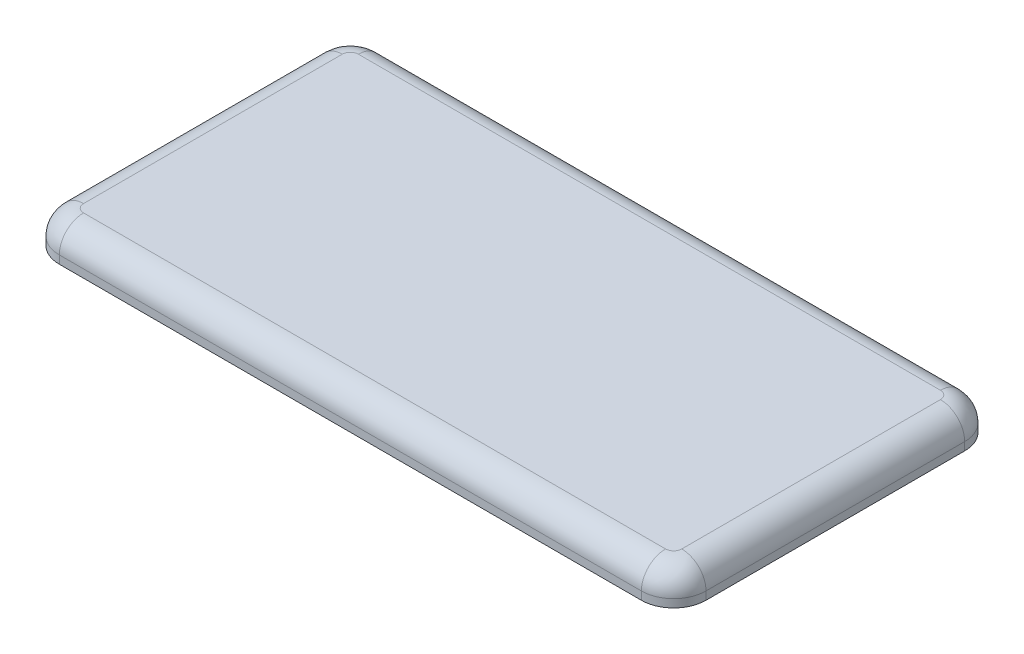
ISO-10303-21;
HEADER;
FILE_DESCRIPTION(('STEP AP214'),'2;1');
FILE_NAME('part.step','',(''),(''),'','','');
FILE_SCHEMA(('AUTOMOTIVE_DESIGN { 1 0 10303 214 1 1 1 1 }'));
ENDSEC;
DATA;
#1=APPLICATION_CONTEXT('core data for automotive mechanical design processes');
#2=APPLICATION_PROTOCOL_DEFINITION('international standard','automotive_design',2000,#1);
#3=PRODUCT_CONTEXT('',#1,'mechanical');
#4=PRODUCT('Part','Part','',(#3));
#5=PRODUCT_RELATED_PRODUCT_CATEGORY('part','',(#4));
#6=PRODUCT_DEFINITION_FORMATION('','',#4);
#7=PRODUCT_DEFINITION_CONTEXT('part definition',#1,'design');
#8=PRODUCT_DEFINITION('design','',#6,#7);
#9=PRODUCT_DEFINITION_SHAPE('','',#8);
#10=(LENGTH_UNIT() NAMED_UNIT(*) SI_UNIT(.MILLI.,.METRE.));
#11=(NAMED_UNIT(*) PLANE_ANGLE_UNIT() SI_UNIT($,.RADIAN.));
#12=(NAMED_UNIT(*) SI_UNIT($,.STERADIAN.) SOLID_ANGLE_UNIT());
#13=UNCERTAINTY_MEASURE_WITH_UNIT(LENGTH_MEASURE(1.E-05),#10,'distance_accuracy_value','');
#14=(GEOMETRIC_REPRESENTATION_CONTEXT(3) GLOBAL_UNCERTAINTY_ASSIGNED_CONTEXT((#13)) GLOBAL_UNIT_ASSIGNED_CONTEXT((#10,
#11,#12)) REPRESENTATION_CONTEXT('',''));
#15=CARTESIAN_POINT('',(0.,0.,0.));
#16=DIRECTION('',(0.,0.,1.));
#17=DIRECTION('',(1.,0.,0.));
#18=AXIS2_PLACEMENT_3D('',#15,#16,#17);
#19=CARTESIAN_POINT('',(0.,-12.,-1.52920078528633E-13));
#20=DIRECTION('',(0.,-1.,0.));
#21=DIRECTION('',(1.,0.,3.10679861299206E-13));
#22=AXIS2_PLACEMENT_3D('',#19,#20,#21);
#23=TOROIDAL_SURFACE('',#22,2.50146924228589,0.5);
#24=CARTESIAN_POINT('',(-2.82231021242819,-12.0868240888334,-0.998920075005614));
#25=CARTESIAN_POINT('',(-2.81730198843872,-12.1137560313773,-0.998920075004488));
#26=CARTESIAN_POINT('',(-2.8099080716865,-12.140218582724,-0.998920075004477));
#27=CARTESIAN_POINT('',(-2.79076640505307,-12.1914437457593,-0.998920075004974));
#28=CARTESIAN_POINT('',(-2.77903012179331,-12.2162106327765,-0.998920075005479));
#29=CARTESIAN_POINT('',(-2.75159602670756,-12.2634229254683,-0.998920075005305));
#30=CARTESIAN_POINT('',(-2.7358997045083,-12.2858691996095,-0.998920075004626));
#31=CARTESIAN_POINT('',(-2.7010720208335,-12.3279165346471,-0.998920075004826));
#32=CARTESIAN_POINT('',(-2.68193967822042,-12.3475167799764,-0.998920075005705));
#33=CARTESIAN_POINT('',(-2.64016671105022,-12.3840280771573,-0.998920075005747));
#34=CARTESIAN_POINT('',(-2.61743324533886,-12.4008327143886,-0.998920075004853));
#35=CARTESIAN_POINT('',(-2.56960196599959,-12.4306561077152,-0.9989200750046));
#36=CARTESIAN_POINT('',(-2.54450304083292,-12.4436730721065,-0.998920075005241));
#37=CARTESIAN_POINT('',(-2.49094900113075,-12.4664407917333,-0.998920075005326));
#38=CARTESIAN_POINT('',(-2.46238185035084,-12.4759275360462,-0.998920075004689));
#39=CARTESIAN_POINT('',(-2.40414873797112,-12.4902931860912,-0.998920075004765));
#40=CARTESIAN_POINT('',(-2.37448403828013,-12.49517722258,-0.998920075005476));
#41=CARTESIAN_POINT('',(-2.32758068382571,-12.4992633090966,-0.998920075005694));
#42=CARTESIAN_POINT('',(-2.31046547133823,-12.5000034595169,-0.998920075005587));
#43=CARTESIAN_POINT('',(-2.29336151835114,-12.4999999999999,-0.99892007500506));
#44=B_SPLINE_CURVE_WITH_KNOTS('',3,(#24,#25,#26,#27,#28,#29,#30,#31,#32,#33,#34,#35,#36,#37,#38,
#39,#40,#41,#42,#43),.UNSPECIFIED.,.F.,.F.,(4,2,2,2,2,2,2,2,2,4),(0.,0.0820414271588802,
0.163867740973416,0.245663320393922,0.327482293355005,0.411925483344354,0.496408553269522,
0.586326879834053,0.676144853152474,0.727467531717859),.UNSPECIFIED.);
#45=CARTESIAN_POINT('',(-2.82231021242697,-12.0868240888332,-0.998920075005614));
#46=VERTEX_POINT('',#45);
#47=CARTESIAN_POINT('',(-2.29336151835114,-12.4999999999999,-0.99892007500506));
#48=VERTEX_POINT('',#47);
#49=EDGE_CURVE('E444',#46,#48,#44,.T.);
#50=ORIENTED_EDGE('',*,*,#49,.T.);
#51=CARTESIAN_POINT('',(0.,-12.5,-1.54499265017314E-13));
#52=DIRECTION('',(0.,1.,0.));
#53=DIRECTION('',(-0.916805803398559,0.,-0.399333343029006));
#54=AXIS2_PLACEMENT_3D('',#51,#52,#53);
#55=CIRCLE('',#54,2.50146924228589);
#56=CARTESIAN_POINT('',(-2.29289083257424,-12.5,1.0000000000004));
#57=VERTEX_POINT('',#56);
#58=EDGE_CURVE('E447',#57,#48,#55,.F.);
#59=ORIENTED_EDGE('',*,*,#58,.F.);
#60=CARTESIAN_POINT('',(-2.29289083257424,-12.5,1.0000000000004));
#61=CARTESIAN_POINT('',(-2.32503584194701,-12.5000201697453,1.00000000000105));
#62=CARTESIAN_POINT('',(-2.35720378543,-12.4973957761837,1.00000000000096));
#63=CARTESIAN_POINT('',(-2.42075200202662,-12.4868653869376,1.0000000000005));
#64=CARTESIAN_POINT('',(-2.45212982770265,-12.4789446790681,1.00000000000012));
#65=CARTESIAN_POINT('',(-2.51313310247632,-12.4578090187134,1.00000000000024));
#66=CARTESIAN_POINT('',(-2.54275507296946,-12.4445839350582,1.00000000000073));
#67=CARTESIAN_POINT('',(-2.59913686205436,-12.413073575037,1.00000000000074));
#68=CARTESIAN_POINT('',(-2.62590058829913,-12.3947953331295,1.00000000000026));
#69=CARTESIAN_POINT('',(-2.6741982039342,-12.3547479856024,1.00000000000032));
#70=CARTESIAN_POINT('',(-2.69594060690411,-12.3332306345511,1.00000000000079));
#71=CARTESIAN_POINT('',(-2.73517775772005,-12.2866136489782,1.00000000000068));
#72=CARTESIAN_POINT('',(-2.75267423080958,-12.2615154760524,1.00000000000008));
#73=CARTESIAN_POINT('',(-2.78068764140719,-12.2120353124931,1.00000000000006));
#74=CARTESIAN_POINT('',(-2.79182341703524,-12.1880021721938,1.00000000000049));
#75=CARTESIAN_POINT('',(-2.81002539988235,-12.1384024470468,1.00000000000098));
#76=CARTESIAN_POINT('',(-2.81708535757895,-12.11283357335,1.00000000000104));
#77=CARTESIAN_POINT('',(-2.821927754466,-12.0868240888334,1.00000000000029));
#78=B_SPLINE_CURVE_WITH_KNOTS('',3,(#60,#61,#62,#63,#64,#65,#66,#67,#68,#69,#70,#71,#72,#73,#74,
#75,#76,#77),.UNSPECIFIED.,.F.,.F.,(4,2,2,2,2,2,2,2,4),(0.,0.0963640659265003,0.19299693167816,
0.289815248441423,0.386499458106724,0.477787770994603,0.569038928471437,0.648151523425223,
0.727385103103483),.UNSPECIFIED.);
#79=CARTESIAN_POINT('',(-2.82192775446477,-12.0868240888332,1.00000000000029));
#80=VERTEX_POINT('',#79);
#81=EDGE_CURVE('E872',#57,#80,#78,.T.);
#82=ORIENTED_EDGE('',*,*,#81,.T.);
#83=CARTESIAN_POINT('',(0.,-12.0868240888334,-1.53223223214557E-13));
#84=DIRECTION('',(0.,-1.,0.));
#85=DIRECTION('',(0.999999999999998,0.,0.));
#86=AXIS2_PLACEMENT_3D('',#83,#84,#85);
#87=CIRCLE('',#86,2.99387311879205);
#88=EDGE_CURVE('E449',#80,#46,#87,.T.);
#89=ORIENTED_EDGE('',*,*,#88,.T.);
#90=EDGE_LOOP('',(#50,#59,#82,#89));
#91=FACE_BOUND('',#90,.T.);
#92=ADVANCED_FACE('F37',(#91),#23,.T.);
#93=CARTESIAN_POINT('',(39.9999999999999,-12.,1.80146828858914E-13));
#94=DIRECTION('',(0.,-1.,0.));
#95=DIRECTION('',(1.,0.,1.33148511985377E-13));
#96=AXIS2_PLACEMENT_3D('',#93,#94,#95);
#97=TOROIDAL_SURFACE('',#96,2.50146924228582,0.5);
#98=CARTESIAN_POINT('',(37.1776897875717,-12.0868240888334,-0.998920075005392));
#99=CARTESIAN_POINT('',(37.1826980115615,-12.1137560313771,-0.998920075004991));
#100=CARTESIAN_POINT('',(37.1900919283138,-12.1402185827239,-0.998920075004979));
#101=CARTESIAN_POINT('',(37.209233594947,-12.1914437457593,-0.998920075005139));
#102=CARTESIAN_POINT('',(37.2209698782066,-12.2162106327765,-0.998920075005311));
#103=CARTESIAN_POINT('',(37.2484039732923,-12.2634229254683,-0.998920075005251));
#104=CARTESIAN_POINT('',(37.2641002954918,-12.2858691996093,-0.998920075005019));
#105=CARTESIAN_POINT('',(37.2989279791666,-12.327916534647,-0.998920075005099));
#106=CARTESIAN_POINT('',(37.3180603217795,-12.3475167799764,-0.998920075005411));
#107=CARTESIAN_POINT('',(37.3598332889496,-12.3840280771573,-0.998920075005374));
#108=CARTESIAN_POINT('',(37.3825667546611,-12.4008327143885,-0.998920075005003));
#109=CARTESIAN_POINT('',(37.4303980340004,-12.430656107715,-0.998920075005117));
#110=CARTESIAN_POINT('',(37.455496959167,-12.4436730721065,-0.998920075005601));
#111=CARTESIAN_POINT('',(37.5090509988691,-12.4664407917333,-0.99892007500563));
#112=CARTESIAN_POINT('',(37.537618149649,-12.4759275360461,-0.998920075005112));
#113=CARTESIAN_POINT('',(37.5958512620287,-12.4902931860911,-0.998920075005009));
#114=CARTESIAN_POINT('',(37.6255159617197,-12.49517722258,-0.998920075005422));
#115=CARTESIAN_POINT('',(37.6724193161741,-12.4992633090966,-0.998920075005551));
#116=CARTESIAN_POINT('',(37.6895345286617,-12.500003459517,-0.99892007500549));
#117=CARTESIAN_POINT('',(37.7066384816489,-12.4999999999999,-0.998920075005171));
#118=B_SPLINE_CURVE_WITH_KNOTS('',3,(#98,#99,#100,#101,#102,#103,#104,#105,#106,#107,#108,#109,
#110,#111,#112,#113,#114,#115,#116,#117),.UNSPECIFIED.,.F.,.F.,(4,2,2,2,2,2,2,2,2,4),(0.,
0.0820414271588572,0.163867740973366,0.245663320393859,0.327482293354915,0.411925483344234,
0.496408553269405,0.586326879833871,0.676144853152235,0.727467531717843),.UNSPECIFIED.);
#119=CARTESIAN_POINT('',(37.1776897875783,-12.0868240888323,-0.998920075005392));
#120=VERTEX_POINT('',#119);
#121=CARTESIAN_POINT('',(37.7066384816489,-12.4999999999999,-0.998920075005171));
#122=VERTEX_POINT('',#121);
#123=EDGE_CURVE('E885',#120,#122,#118,.T.);
#124=ORIENTED_EDGE('',*,*,#123,.T.);
#125=CARTESIAN_POINT('',(39.9999999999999,-12.5,1.78567642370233E-13));
#126=DIRECTION('',(0.,1.,0.));
#127=DIRECTION('',(-0.91680580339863,0.,-0.399333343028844));
#128=AXIS2_PLACEMENT_3D('',#125,#126,#127);
#129=CIRCLE('',#128,2.50146924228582);
#130=CARTESIAN_POINT('',(37.7071091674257,-12.5,1.00000000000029));
#131=VERTEX_POINT('',#130);
#132=EDGE_CURVE('E634',#131,#122,#129,.F.);
#133=ORIENTED_EDGE('',*,*,#132,.F.);
#134=CARTESIAN_POINT('',(37.7071091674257,-12.5,1.00000000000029));
#135=CARTESIAN_POINT('',(37.6749641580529,-12.5000201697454,1.00000000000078));
#136=CARTESIAN_POINT('',(37.6427962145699,-12.4973957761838,1.00000000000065));
#137=CARTESIAN_POINT('',(37.5792479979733,-12.4868653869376,1.00000000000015));
#138=CARTESIAN_POINT('',(37.5478701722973,-12.478944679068,0.999999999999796));
#139=CARTESIAN_POINT('',(37.4868668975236,-12.4578090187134,0.999999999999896));
#140=CARTESIAN_POINT('',(37.4572449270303,-12.4445839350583,1.00000000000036));
#141=CARTESIAN_POINT('',(37.4008631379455,-12.413073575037,1.00000000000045));
#142=CARTESIAN_POINT('',(37.3740994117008,-12.3947953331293,1.00000000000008));
#143=CARTESIAN_POINT('',(37.3258017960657,-12.3547479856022,1.00000000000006));
#144=CARTESIAN_POINT('',(37.3040593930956,-12.333230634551,1.00000000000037));
#145=CARTESIAN_POINT('',(37.2648222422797,-12.2866136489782,1.00000000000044));
#146=CARTESIAN_POINT('',(37.2473257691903,-12.2615154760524,1.00000000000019));
#147=CARTESIAN_POINT('',(37.2193123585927,-12.2120353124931,1.00000000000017));
#148=CARTESIAN_POINT('',(37.2081765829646,-12.1880021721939,1.00000000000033));
#149=CARTESIAN_POINT('',(37.1899746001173,-12.1384024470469,1.00000000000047));
#150=CARTESIAN_POINT('',(37.1829146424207,-12.1128335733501,1.00000000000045));
#151=CARTESIAN_POINT('',(37.1780722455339,-12.0868240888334,1.00000000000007));
#152=B_SPLINE_CURVE_WITH_KNOTS('',3,(#134,#135,#136,#137,#138,#139,#140,#141,#142,#143,#144,
#145,#146,#147,#148,#149,#150,#151),.UNSPECIFIED.,.F.,.F.,(4,2,2,2,2,2,2,2,4),(0.,
0.0963640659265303,0.192996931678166,0.28981524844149,0.386499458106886,0.477787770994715,
0.569038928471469,0.648151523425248,0.727385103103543),.UNSPECIFIED.);
#153=CARTESIAN_POINT('',(37.1780722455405,-12.0868240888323,1.00000000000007));
#154=VERTEX_POINT('',#153);
#155=EDGE_CURVE('E454',#131,#154,#152,.T.);
#156=ORIENTED_EDGE('',*,*,#155,.T.);
#157=CARTESIAN_POINT('',(39.9999999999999,-12.0868240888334,1.7984368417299E-13));
#158=DIRECTION('',(0.,-1.,0.));
#159=DIRECTION('',(0.999999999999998,0.,0.));
#160=AXIS2_PLACEMENT_3D('',#157,#158,#159);
#161=CIRCLE('',#160,2.99387311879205);
#162=EDGE_CURVE('E1851',#154,#120,#161,.T.);
#163=ORIENTED_EDGE('',*,*,#162,.T.);
#164=EDGE_LOOP('',(#124,#133,#156,#163));
#165=FACE_BOUND('',#164,.T.);
#166=ADVANCED_FACE('F537',(#165),#97,.T.);
#167=CARTESIAN_POINT('',(0.,-12.4999999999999,-1.54665819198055E-13));
#168=DIRECTION('',(0.,-1.,0.));
#169=DIRECTION('',(0.999999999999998,0.,0.));
#170=AXIS2_PLACEMENT_3D('',#167,#168,#169);
#171=PLANE('',#170);
#172=CARTESIAN_POINT('',(0.,-12.5,-1.54499265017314E-13));
#173=DIRECTION('',(0.,1.,0.));
#174=DIRECTION('',(0.399765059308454,0.,-0.91661763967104));
#175=AXIS2_PLACEMENT_3D('',#172,#173,#174);
#176=CIRCLE('',#175,2.50146924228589);
#177=CARTESIAN_POINT('',(0.999999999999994,-12.4999999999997,-2.29289083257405));
#178=VERTEX_POINT('',#177);
#179=CARTESIAN_POINT('',(-0.999999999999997,-12.4999999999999,-2.29289083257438));
#180=VERTEX_POINT('',#179);
#181=EDGE_CURVE('E749',#178,#180,#176,.T.);
#182=ORIENTED_EDGE('',*,*,#181,.F.);
#183=DIRECTION('',(0.,0.,1.));
#184=VECTOR('',#183,1.);
#185=CARTESIAN_POINT('',(1.,-12.4999999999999,5.11467995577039E-13));
#186=LINE('',#185,#184);
#187=CARTESIAN_POINT('',(1.,-12.4999999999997,-0.99892007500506));
#188=VERTEX_POINT('',#187);
#189=EDGE_CURVE('E474',#178,#188,#186,.T.);
#190=ORIENTED_EDGE('',*,*,#189,.T.);
#191=DIRECTION('',(0.999999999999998,0.,0.));
#192=VECTOR('',#191,1.);
#193=CARTESIAN_POINT('',(0.,-12.4999999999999,-0.998920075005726));
#194=LINE('',#193,#192);
#195=CARTESIAN_POINT('',(2.29336151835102,-12.4999999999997,-0.998920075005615));
#196=VERTEX_POINT('',#195);
#197=EDGE_CURVE('E882',#188,#196,#194,.T.);
#198=ORIENTED_EDGE('',*,*,#197,.T.);
#199=CARTESIAN_POINT('',(0.,-12.5,-1.54499265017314E-13));
#200=DIRECTION('',(0.,1.,0.));
#201=DIRECTION('',(1.,0.,3.10301766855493E-13));
#202=AXIS2_PLACEMENT_3D('',#199,#200,#201);
#203=CIRCLE('',#202,2.50146924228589);
#204=CARTESIAN_POINT('',(2.50146924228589,-12.4999999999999,6.22490298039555E-13));
#205=VERTEX_POINT('',#204);
#206=EDGE_CURVE('E884',#196,#205,#203,.F.);
#207=ORIENTED_EDGE('',*,*,#206,.T.);
#208=CARTESIAN_POINT('',(0.,-12.5,-1.54499265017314E-13));
#209=DIRECTION('',(0.,1.,0.));
#210=DIRECTION('',(0.91661763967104,0.,0.399765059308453));
#211=AXIS2_PLACEMENT_3D('',#208,#209,#210);
#212=CIRCLE('',#211,2.50146924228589);
#213=CARTESIAN_POINT('',(2.2928908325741,-12.5,0.999999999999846));
#214=VERTEX_POINT('',#213);
#215=EDGE_CURVE('E572',#205,#214,#212,.F.);
#216=ORIENTED_EDGE('',*,*,#215,.T.);
#217=DIRECTION('',(0.999999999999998,0.,0.));
#218=VECTOR('',#217,1.);
#219=CARTESIAN_POINT('',(0.,-12.5,1.00000000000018));
#220=LINE('',#219,#218);
#221=CARTESIAN_POINT('',(0.999999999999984,-12.5,1.0000000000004));
#222=VERTEX_POINT('',#221);
#223=EDGE_CURVE('E888',#214,#222,#220,.F.);
#224=ORIENTED_EDGE('',*,*,#223,.T.);
#225=DIRECTION('',(0.,0.,1.));
#226=VECTOR('',#225,1.);
#227=CARTESIAN_POINT('',(1.,-12.4999999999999,5.11467995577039E-13));
#228=LINE('',#227,#226);
#229=CARTESIAN_POINT('',(1.00000000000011,-12.5,2.29289083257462));
#230=VERTEX_POINT('',#229);
#231=EDGE_CURVE('E590',#222,#230,#228,.T.);
#232=ORIENTED_EDGE('',*,*,#231,.T.);
#233=CARTESIAN_POINT('',(0.,-12.5,-1.54499265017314E-13));
#234=DIRECTION('',(0.,1.,0.));
#235=DIRECTION('',(-0.399765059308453,0.,0.91661763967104));
#236=AXIS2_PLACEMENT_3D('',#233,#234,#235);
#237=CIRCLE('',#236,2.50146924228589);
#238=CARTESIAN_POINT('',(-0.99999999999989,-12.5,2.29289083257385));
#239=VERTEX_POINT('',#238);
#240=EDGE_CURVE('E486',#239,#230,#237,.T.);
#241=ORIENTED_EDGE('',*,*,#240,.F.);
#242=DIRECTION('',(0.,0.,1.));
#243=VECTOR('',#242,1.);
#244=CARTESIAN_POINT('',(-0.999999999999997,-12.4999999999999,-2.6568812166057E-13));
#245=LINE('',#244,#243);
#246=CARTESIAN_POINT('',(-1.00000000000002,-12.5,0.999999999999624));
#247=VERTEX_POINT('',#246);
#248=EDGE_CURVE('E893',#239,#247,#245,.F.);
#249=ORIENTED_EDGE('',*,*,#248,.T.);
#250=DIRECTION('',(0.999999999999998,0.,0.));
#251=VECTOR('',#250,1.);
#252=CARTESIAN_POINT('',(0.,-12.5,1.00000000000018));
#253=LINE('',#252,#251);
#254=EDGE_CURVE('E463',#247,#57,#253,.F.);
#255=ORIENTED_EDGE('',*,*,#254,.T.);
#256=ORIENTED_EDGE('',*,*,#58,.T.);
#257=DIRECTION('',(0.999999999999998,0.,0.));
#258=VECTOR('',#257,1.);
#259=CARTESIAN_POINT('',(0.,-12.4999999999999,-0.998920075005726));
#260=LINE('',#259,#258);
#261=CARTESIAN_POINT('',(-1.,-12.4999999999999,-0.998920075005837));
#262=VERTEX_POINT('',#261);
#263=EDGE_CURVE('E460',#48,#262,#260,.T.);
#264=ORIENTED_EDGE('',*,*,#263,.T.);
#265=DIRECTION('',(0.,0.,1.));
#266=VECTOR('',#265,1.);
#267=CARTESIAN_POINT('',(-0.999999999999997,-12.4999999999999,-2.6568812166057E-13));
#268=LINE('',#267,#266);
#269=EDGE_CURVE('E472',#262,#180,#268,.F.);
#270=ORIENTED_EDGE('',*,*,#269,.T.);
#271=EDGE_LOOP('',(#182,#190,#198,#207,#216,#224,#232,#241,#249,#255,#256,#264,#270));
#272=FACE_BOUND('',#271,.T.);
#273=ADVANCED_FACE('F459',(#272),#171,.T.);
#274=CARTESIAN_POINT('',(39.9999999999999,-12.4999999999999,1.78401088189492E-13));
#275=DIRECTION('',(0.,-1.,0.));
#276=DIRECTION('',(0.999999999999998,0.,0.));
#277=AXIS2_PLACEMENT_3D('',#274,#275,#276);
#278=PLANE('',#277);
#279=CARTESIAN_POINT('',(39.9999999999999,-12.5,1.78567642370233E-13));
#280=DIRECTION('',(0.,1.,0.));
#281=DIRECTION('',(0.399765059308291,0.,-0.916617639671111));
#282=AXIS2_PLACEMENT_3D('',#279,#280,#281);
#283=CIRCLE('',#282,2.50146924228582);
#284=CARTESIAN_POINT('',(40.9999999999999,-12.4999999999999,-2.29289083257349));
#285=VERTEX_POINT('',#284);
#286=CARTESIAN_POINT('',(38.9999999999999,-12.4999999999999,-2.29289083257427));
#287=VERTEX_POINT('',#286);
#288=EDGE_CURVE('E1867',#285,#287,#283,.T.);
#289=ORIENTED_EDGE('',*,*,#288,.F.);
#290=DIRECTION('',(0.,0.,1.));
#291=VECTOR('',#290,1.);
#292=CARTESIAN_POINT('',(40.9999999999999,-12.4999999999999,6.22490298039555E-13));
#293=LINE('',#292,#291);
#294=CARTESIAN_POINT('',(40.9999999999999,-12.4999999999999,-0.998920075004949));
#295=VERTEX_POINT('',#294);
#296=EDGE_CURVE('E594',#285,#295,#293,.T.);
#297=ORIENTED_EDGE('',*,*,#296,.T.);
#298=DIRECTION('',(0.999999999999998,0.,0.));
#299=VECTOR('',#298,1.);
#300=CARTESIAN_POINT('',(39.9999999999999,-12.4999999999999,-0.998920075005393));
#301=LINE('',#300,#299);
#302=CARTESIAN_POINT('',(42.2933615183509,-12.4999999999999,-0.998920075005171));
#303=VERTEX_POINT('',#302);
#304=EDGE_CURVE('E614',#295,#303,#301,.T.);
#305=ORIENTED_EDGE('',*,*,#304,.T.);
#306=CARTESIAN_POINT('',(39.9999999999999,-12.5,1.78567642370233E-13));
#307=DIRECTION('',(0.,1.,0.));
#308=DIRECTION('',(1.,0.,1.32770417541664E-13));
#309=AXIS2_PLACEMENT_3D('',#306,#307,#308);
#310=CIRCLE('',#309,2.50146924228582);
#311=CARTESIAN_POINT('',(42.5014692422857,-12.4999999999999,5.11467995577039E-13));
#312=VERTEX_POINT('',#311);
#313=EDGE_CURVE('E616',#303,#312,#310,.F.);
#314=ORIENTED_EDGE('',*,*,#313,.T.);
#315=CARTESIAN_POINT('',(39.9999999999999,-12.5,1.78567642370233E-13));
#316=DIRECTION('',(0.,1.,0.));
#317=DIRECTION('',(0.916617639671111,0.,0.399765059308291));
#318=AXIS2_PLACEMENT_3D('',#315,#316,#317);
#319=CIRCLE('',#318,2.50146924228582);
#320=CARTESIAN_POINT('',(42.2928908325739,-12.5,1.00000000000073));
#321=VERTEX_POINT('',#320);
#322=EDGE_CURVE('E622',#312,#321,#319,.F.);
#323=ORIENTED_EDGE('',*,*,#322,.T.);
#324=DIRECTION('',(0.999999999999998,0.,0.));
#325=VECTOR('',#324,1.);
#326=CARTESIAN_POINT('',(39.9999999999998,-12.5,1.00000000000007));
#327=LINE('',#326,#325);
#328=CARTESIAN_POINT('',(40.9999999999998,-12.5,1.00000000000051));
#329=VERTEX_POINT('',#328);
#330=EDGE_CURVE('E619',#321,#329,#327,.F.);
#331=ORIENTED_EDGE('',*,*,#330,.T.);
#332=DIRECTION('',(0.,0.,1.));
#333=VECTOR('',#332,1.);
#334=CARTESIAN_POINT('',(40.9999999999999,-12.4999999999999,6.22490298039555E-13));
#335=LINE('',#334,#333);
#336=CARTESIAN_POINT('',(41.0000000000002,-12.5,2.29289083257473));
#337=VERTEX_POINT('',#336);
#338=EDGE_CURVE('E621',#329,#337,#335,.T.);
#339=ORIENTED_EDGE('',*,*,#338,.T.);
#340=CARTESIAN_POINT('',(39.9999999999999,-12.5,1.78567642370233E-13));
#341=DIRECTION('',(0.,1.,0.));
#342=DIRECTION('',(-0.399765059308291,0.,0.916617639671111));
#343=AXIS2_PLACEMENT_3D('',#340,#341,#342);
#344=CIRCLE('',#343,2.50146924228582);
#345=CARTESIAN_POINT('',(39.0000000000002,-12.5,2.29289083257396));
#346=VERTEX_POINT('',#345);
#347=EDGE_CURVE('E644',#346,#337,#344,.T.);
#348=ORIENTED_EDGE('',*,*,#347,.F.);
#349=DIRECTION('',(0.,0.,1.));
#350=VECTOR('',#349,1.);
#351=CARTESIAN_POINT('',(38.9999999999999,-12.4999999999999,-1.54665819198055E-13));
#352=LINE('',#351,#350);
#353=CARTESIAN_POINT('',(38.9999999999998,-12.5,0.999999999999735));
#354=VERTEX_POINT('',#353);
#355=EDGE_CURVE('E626',#346,#354,#352,.F.);
#356=ORIENTED_EDGE('',*,*,#355,.T.);
#357=DIRECTION('',(0.999999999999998,0.,0.));
#358=VECTOR('',#357,1.);
#359=CARTESIAN_POINT('',(39.9999999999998,-12.5,1.00000000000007));
#360=LINE('',#359,#358);
#361=EDGE_CURVE('E630',#354,#131,#360,.F.);
#362=ORIENTED_EDGE('',*,*,#361,.T.);
#363=ORIENTED_EDGE('',*,*,#132,.T.);
#364=DIRECTION('',(0.999999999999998,0.,0.));
#365=VECTOR('',#364,1.);
#366=CARTESIAN_POINT('',(39.9999999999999,-12.4999999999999,-0.998920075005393));
#367=LINE('',#366,#365);
#368=CARTESIAN_POINT('',(38.9999999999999,-12.4999999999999,-0.998920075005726));
#369=VERTEX_POINT('',#368);
#370=EDGE_CURVE('E601',#122,#369,#367,.T.);
#371=ORIENTED_EDGE('',*,*,#370,.T.);
#372=DIRECTION('',(0.,0.,1.));
#373=VECTOR('',#372,1.);
#374=CARTESIAN_POINT('',(38.9999999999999,-12.4999999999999,-1.54665819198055E-13));
#375=LINE('',#374,#373);
#376=EDGE_CURVE('E595',#369,#287,#375,.F.);
#377=ORIENTED_EDGE('',*,*,#376,.T.);
#378=EDGE_LOOP('',(#289,#297,#305,#314,#323,#331,#339,#348,#356,#362,#363,#371,#377));
#379=FACE_BOUND('',#378,.T.);
#380=ADVANCED_FACE('F505',(#379),#278,.T.);
#381=CARTESIAN_POINT('',(0.,-12.,-1.52920078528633E-13));
#382=DIRECTION('',(0.,-1.,0.));
#383=DIRECTION('',(1.,0.,3.10679861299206E-13));
#384=AXIS2_PLACEMENT_3D('',#381,#382,#383);
#385=TOROIDAL_SURFACE('',#384,2.50146924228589,0.5);
#386=CARTESIAN_POINT('',(-0.999999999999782,-12.086824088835,2.82192775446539));
#387=CARTESIAN_POINT('',(-0.999999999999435,-12.1137543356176,2.81691917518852));
#388=CARTESIAN_POINT('',(-0.99999999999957,-12.1402150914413,2.80952488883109));
#389=CARTESIAN_POINT('',(-0.999999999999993,-12.1914364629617,2.79038269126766));
#390=CARTESIAN_POINT('',(-1.00000000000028,-12.2162013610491,2.77864626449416));
#391=CARTESIAN_POINT('',(-1.0000000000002,-12.263409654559,2.75121230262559));
#392=CARTESIAN_POINT('',(-0.999999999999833,-12.2858539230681,2.73551626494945));
#393=CARTESIAN_POINT('',(-0.999999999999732,-12.3278975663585,2.70068969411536));
#394=CARTESIAN_POINT('',(-0.999999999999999,-12.3474961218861,2.68155817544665));
#395=CARTESIAN_POINT('',(-1.00000000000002,-12.3840058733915,2.6397860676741));
#396=CARTESIAN_POINT('',(-0.999999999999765,-12.4008104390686,2.61705245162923));
#397=CARTESIAN_POINT('',(-0.9999999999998,-12.430634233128,2.56922117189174));
#398=CARTESIAN_POINT('',(-1.0000000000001,-12.44365166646,2.54412239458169));
#399=CARTESIAN_POINT('',(-1.00000000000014,-12.4664228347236,2.49056521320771));
#400=CARTESIAN_POINT('',(-0.999999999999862,-12.4759120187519,2.46199453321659));
#401=CARTESIAN_POINT('',(-0.999999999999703,-12.4902827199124,2.4037541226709));
#402=CARTESIAN_POINT('',(-0.999999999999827,-12.495169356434,2.37408565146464));
#403=CARTESIAN_POINT('',(-0.999999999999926,-12.4992616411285,2.32715567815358));
#404=CARTESIAN_POINT('',(-0.999999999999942,-12.5000034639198,2.310017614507));
#405=CARTESIAN_POINT('',(-0.99999999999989,-12.5,2.29289083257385));
#406=B_SPLINE_CURVE_WITH_KNOTS('',3,(#386,#387,#388,#389,#390,#391,#392,#393,#394,#395,#396,
#397,#398,#399,#400,#401,#402,#403,#404,#405),.UNSPECIFIED.,.F.,.F.,(4,2,2,2,2,2,2,2,2,4),(0.,
0.0820365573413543,0.163857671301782,0.245647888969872,0.327461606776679,0.411905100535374,
0.496388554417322,0.586319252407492,0.676149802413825,0.727540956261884),.UNSPECIFIED.);
#407=CARTESIAN_POINT('',(-0.999999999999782,-12.0868240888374,2.82192775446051));
#408=VERTEX_POINT('',#407);
#409=EDGE_CURVE('E484',#408,#239,#406,.T.);
#410=ORIENTED_EDGE('',*,*,#409,.T.);
#411=ORIENTED_EDGE('',*,*,#240,.T.);
#412=CARTESIAN_POINT('',(1.00000000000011,-12.5,2.29289083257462));
#413=CARTESIAN_POINT('',(1.00000000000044,-12.5000201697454,2.32503584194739));
#414=CARTESIAN_POINT('',(1.00000000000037,-12.4973957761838,2.35720378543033));
#415=CARTESIAN_POINT('',(1.00000000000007,-12.4868653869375,2.42075200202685));
#416=CARTESIAN_POINT('',(0.99999999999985,-12.4789446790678,2.45212982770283));
#417=CARTESIAN_POINT('',(0.999999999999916,-12.4578090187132,2.51313310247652));
#418=CARTESIAN_POINT('',(1.0000000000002,-12.444583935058,2.54275507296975));
#419=CARTESIAN_POINT('',(1.00000000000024,-12.4130735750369,2.59913686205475));
#420=CARTESIAN_POINT('',(0.99999999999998,-12.3947953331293,2.62590058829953));
#421=CARTESIAN_POINT('',(1.,-12.3547479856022,2.67419820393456));
#422=CARTESIAN_POINT('',(1.00000000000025,-12.3332306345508,2.69594060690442));
#423=CARTESIAN_POINT('',(1.00000000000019,-12.2866136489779,2.73517775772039));
#424=CARTESIAN_POINT('',(0.999999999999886,-12.2615154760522,2.75267423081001));
#425=CARTESIAN_POINT('',(0.999999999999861,-12.2120353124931,2.78068764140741));
#426=CARTESIAN_POINT('',(1.00000000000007,-12.1880021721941,2.79182341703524));
#427=CARTESIAN_POINT('',(1.00000000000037,-12.1384024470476,2.81002539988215));
#428=CARTESIAN_POINT('',(1.00000000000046,-12.1128335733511,2.81708535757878));
#429=CARTESIAN_POINT('',(1.00000000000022,-12.086824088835,2.82192775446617));
#430=B_SPLINE_CURVE_WITH_KNOTS('',3,(#412,#413,#414,#415,#416,#417,#418,#419,#420,#421,#422,
#423,#424,#425,#426,#427,#428,#429),.UNSPECIFIED.,.F.,.F.,(4,2,2,2,2,2,2,2,4),(0.,
0.0963640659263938,0.192996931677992,0.289815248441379,0.386499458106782,0.477787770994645,
0.569038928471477,0.648151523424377,0.727385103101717),.UNSPECIFIED.);
#431=CARTESIAN_POINT('',(1.00000000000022,-12.0868240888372,2.82192775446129));
#432=VERTEX_POINT('',#431);
#433=EDGE_CURVE('E487',#230,#432,#430,.T.);
#434=ORIENTED_EDGE('',*,*,#433,.T.);
#435=CARTESIAN_POINT('',(0.,-12.0868240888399,-1.5322322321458E-13));
#436=DIRECTION('',(0.,1.,0.));
#437=DIRECTION('',(-0.999999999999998,0.,0.));
#438=AXIS2_PLACEMENT_3D('',#435,#436,#437);
#439=CIRCLE('',#438,2.99387311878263);
#440=EDGE_CURVE('E526',#408,#432,#439,.T.);
#441=ORIENTED_EDGE('',*,*,#440,.F.);
#442=EDGE_LOOP('',(#410,#411,#434,#441));
#443=FACE_BOUND('',#442,.T.);
#444=ADVANCED_FACE('F499',(#443),#385,.T.);
#445=CARTESIAN_POINT('',(0.,-12.,-1.52920078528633E-13));
#446=DIRECTION('',(0.,-1.,0.));
#447=DIRECTION('',(1.,0.,3.10679861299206E-13));
#448=AXIS2_PLACEMENT_3D('',#445,#446,#447);
#449=TOROIDAL_SURFACE('',#448,2.50146924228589,0.5);
#450=CARTESIAN_POINT('',(0.999999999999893,-12.086824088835,-2.82192775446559));
#451=CARTESIAN_POINT('',(1.00000000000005,-12.1137543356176,-2.81691917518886));
#452=CARTESIAN_POINT('',(1.00000000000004,-12.1402150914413,-2.80952488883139));
#453=CARTESIAN_POINT('',(0.999999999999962,-12.1914364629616,-2.79038269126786));
#454=CARTESIAN_POINT('',(0.999999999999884,-12.2162013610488,-2.7786462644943));
#455=CARTESIAN_POINT('',(0.999999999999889,-12.2634096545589,-2.7512123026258));
#456=CARTESIAN_POINT('',(0.999999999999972,-12.2858539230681,-2.73551626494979));
#457=CARTESIAN_POINT('',(1.00000000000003,-12.3278975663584,-2.70068969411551));
#458=CARTESIAN_POINT('',(1.00000000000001,-12.3474961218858,-2.68155817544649));
#459=CARTESIAN_POINT('',(0.999999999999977,-12.3840058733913,-2.63978606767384));
#460=CARTESIAN_POINT('',(0.999999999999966,-12.4008104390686,-2.61705245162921));
#461=CARTESIAN_POINT('',(1.00000000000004,-12.4306342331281,-2.56922117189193));
#462=CARTESIAN_POINT('',(1.00000000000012,-12.44365166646,-2.54412239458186));
#463=CARTESIAN_POINT('',(1.00000000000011,-12.4664228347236,-2.4905652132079));
#464=CARTESIAN_POINT('',(1.,-12.4759120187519,-2.46199453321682));
#465=CARTESIAN_POINT('',(1.,-12.4902827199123,-2.40375412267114));
#466=CARTESIAN_POINT('',(1.00000000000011,-12.4951693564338,-2.37408565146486));
#467=CARTESIAN_POINT('',(1.00000000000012,-12.4992616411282,-2.32715567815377));
#468=CARTESIAN_POINT('',(1.00000000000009,-12.5000034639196,-2.31001761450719));
#469=CARTESIAN_POINT('',(0.999999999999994,-12.4999999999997,-2.29289083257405));
#470=B_SPLINE_CURVE_WITH_KNOTS('',3,(#450,#451,#452,#453,#454,#455,#456,#457,#458,#459,#460,
#461,#462,#463,#464,#465,#466,#467,#468,#469),.UNSPECIFIED.,.F.,.F.,(4,2,2,2,2,2,2,2,2,4),(0.,
0.0820365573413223,0.163857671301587,0.245647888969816,0.327461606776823,0.411905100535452,
0.496388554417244,0.586319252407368,0.676149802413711,0.72754095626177),.UNSPECIFIED.);
#471=CARTESIAN_POINT('',(0.999999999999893,-12.0868240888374,-2.8219277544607));
#472=VERTEX_POINT('',#471);
#473=EDGE_CURVE('E751',#472,#178,#470,.T.);
#474=ORIENTED_EDGE('',*,*,#473,.T.);
#475=ORIENTED_EDGE('',*,*,#181,.T.);
#476=CARTESIAN_POINT('',(-0.999999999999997,-12.4999999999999,-2.29289083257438));
#477=CARTESIAN_POINT('',(-0.999999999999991,-12.5000201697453,-2.32503584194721));
#478=CARTESIAN_POINT('',(-0.999999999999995,-12.4973957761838,-2.35720378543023));
#479=CARTESIAN_POINT('',(-1.00000000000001,-12.4868653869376,-2.4207520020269));
#480=CARTESIAN_POINT('',(-1.00000000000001,-12.478944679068,-2.45212982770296));
#481=CARTESIAN_POINT('',(-1.00000000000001,-12.4578090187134,-2.51313310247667));
#482=CARTESIAN_POINT('',(-1.,-12.4445839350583,-2.54275507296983));
#483=CARTESIAN_POINT('',(-0.999999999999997,-12.4130735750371,-2.59913686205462));
#484=CARTESIAN_POINT('',(-0.999999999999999,-12.3947953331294,-2.62590058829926));
#485=CARTESIAN_POINT('',(-0.999999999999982,-12.3547479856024,-2.67419820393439));
#486=CARTESIAN_POINT('',(-0.999999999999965,-12.3332306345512,-2.69594060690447));
#487=CARTESIAN_POINT('',(-1.00000000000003,-12.2866136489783,-2.73517775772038));
#488=CARTESIAN_POINT('',(-1.00000000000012,-12.2615154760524,-2.75267423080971));
#489=CARTESIAN_POINT('',(-1.00000000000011,-12.2120353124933,-2.78068764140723));
#490=CARTESIAN_POINT('',(-1.00000000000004,-12.1880021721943,-2.79182341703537));
#491=CARTESIAN_POINT('',(-0.999999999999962,-12.1384024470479,-2.81002539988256));
#492=CARTESIAN_POINT('',(-0.999999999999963,-12.1128335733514,-2.81708535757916));
#493=CARTESIAN_POINT('',(-1.00000000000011,-12.086824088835,-2.82192775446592));
#494=B_SPLINE_CURVE_WITH_KNOTS('',3,(#476,#477,#478,#479,#480,#481,#482,#483,#484,#485,#486,
#487,#488,#489,#490,#491,#492,#493),.UNSPECIFIED.,.F.,.F.,(4,2,2,2,2,2,2,2,4),(0.,
0.0963640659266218,0.192996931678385,0.289815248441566,0.386499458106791,0.477787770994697,
0.569038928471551,0.648151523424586,0.727385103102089),.UNSPECIFIED.);
#495=CARTESIAN_POINT('',(-1.00000000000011,-12.0868240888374,-2.82192775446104));
#496=VERTEX_POINT('',#495);
#497=EDGE_CURVE('E584',#180,#496,#494,.T.);
#498=ORIENTED_EDGE('',*,*,#497,.T.);
#499=CARTESIAN_POINT('',(0.,-12.0868240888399,-1.5322322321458E-13));
#500=DIRECTION('',(0.,1.,0.));
#501=DIRECTION('',(-0.999999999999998,0.,0.));
#502=AXIS2_PLACEMENT_3D('',#499,#500,#501);
#503=CIRCLE('',#502,2.99387311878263);
#504=EDGE_CURVE('E796',#472,#496,#503,.T.);
#505=ORIENTED_EDGE('',*,*,#504,.F.);
#506=EDGE_LOOP('',(#474,#475,#498,#505));
#507=FACE_BOUND('',#506,.T.);
#508=ADVANCED_FACE('F504',(#507),#449,.T.);
#509=CARTESIAN_POINT('',(39.9999999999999,-12.,1.80146828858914E-13));
#510=DIRECTION('',(0.,-1.,0.));
#511=DIRECTION('',(1.,0.,1.33148511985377E-13));
#512=AXIS2_PLACEMENT_3D('',#509,#510,#511);
#513=TOROIDAL_SURFACE('',#512,2.50146924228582,0.5);
#514=CARTESIAN_POINT('',(39.,-12.0868240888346,2.82192775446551));
#515=CARTESIAN_POINT('',(39.0000000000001,-12.1137543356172,2.81691917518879));
#516=CARTESIAN_POINT('',(39.0000000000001,-12.1402150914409,2.80952488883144));
#517=CARTESIAN_POINT('',(39.0000000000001,-12.1914364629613,2.79038269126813));
#518=CARTESIAN_POINT('',(39.,-12.2162013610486,2.77864626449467));
#519=CARTESIAN_POINT('',(39.0000000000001,-12.2634096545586,2.75121230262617));
#520=CARTESIAN_POINT('',(39.0000000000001,-12.2858539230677,2.73551626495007));
#521=CARTESIAN_POINT('',(39.0000000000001,-12.327897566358,2.70068969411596));
#522=CARTESIAN_POINT('',(38.9999999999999,-12.3474961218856,2.6815581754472));
#523=CARTESIAN_POINT('',(38.9999999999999,-12.3840058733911,2.6397860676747));
#524=CARTESIAN_POINT('',(39.0000000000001,-12.4008104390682,2.61705245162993));
#525=CARTESIAN_POINT('',(39.0000000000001,-12.4306342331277,2.56922117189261));
#526=CARTESIAN_POINT('',(38.9999999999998,-12.4436516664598,2.54412239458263));
#527=CARTESIAN_POINT('',(38.9999999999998,-12.4664228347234,2.49056521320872));
#528=CARTESIAN_POINT('',(39.,-12.4759120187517,2.46199453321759));
#529=CARTESIAN_POINT('',(39.0000000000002,-12.4902827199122,2.40375412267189));
#530=CARTESIAN_POINT('',(39.,-12.4951693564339,2.37408565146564));
#531=CARTESIAN_POINT('',(39.,-12.4992616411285,2.32715567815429));
#532=CARTESIAN_POINT('',(39.0000000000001,-12.5000034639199,2.31001761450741));
#533=CARTESIAN_POINT('',(39.0000000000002,-12.5,2.29289083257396));
#534=B_SPLINE_CURVE_WITH_KNOTS('',3,(#514,#515,#516,#517,#518,#519,#520,#521,#522,#523,#524,
#525,#526,#527,#528,#529,#530,#531,#532,#533),.UNSPECIFIED.,.F.,.F.,(4,2,2,2,2,2,2,2,2,4),(0.,
0.0820365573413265,0.163857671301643,0.245647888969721,0.327461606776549,0.411905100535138,
0.496388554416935,0.586319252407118,0.676149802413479,0.727540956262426),.UNSPECIFIED.);
#535=CARTESIAN_POINT('',(39.,-12.0868240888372,2.82192775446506));
#536=VERTEX_POINT('',#535);
#537=EDGE_CURVE('E642',#536,#346,#534,.T.);
#538=ORIENTED_EDGE('',*,*,#537,.T.);
#539=ORIENTED_EDGE('',*,*,#347,.T.);
#540=CARTESIAN_POINT('',(41.0000000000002,-12.5,2.29289083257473));
#541=CARTESIAN_POINT('',(41.0000000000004,-12.5000201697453,2.32503584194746));
#542=CARTESIAN_POINT('',(41.0000000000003,-12.4973957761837,2.35720378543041));
#543=CARTESIAN_POINT('',(40.9999999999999,-12.4868653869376,2.42075200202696));
#544=CARTESIAN_POINT('',(40.9999999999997,-12.4789446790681,2.45212982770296));
#545=CARTESIAN_POINT('',(40.9999999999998,-12.4578090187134,2.51313310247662));
#546=CARTESIAN_POINT('',(41.0000000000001,-12.4445839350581,2.5427550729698));
#547=CARTESIAN_POINT('',(41.0000000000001,-12.413073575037,2.5991368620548));
#548=CARTESIAN_POINT('',(40.9999999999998,-12.3947953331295,2.62590058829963));
#549=CARTESIAN_POINT('',(40.9999999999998,-12.3547479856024,2.67419820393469));
#550=CARTESIAN_POINT('',(41.,-12.333230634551,2.69594060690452));
#551=CARTESIAN_POINT('',(41.0000000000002,-12.2866136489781,2.73517775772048));
#552=CARTESIAN_POINT('',(41.0000000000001,-12.2615154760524,2.7526742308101));
#553=CARTESIAN_POINT('',(41.,-12.2120353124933,2.78068764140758));
#554=CARTESIAN_POINT('',(41.0000000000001,-12.1880021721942,2.79182341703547));
#555=CARTESIAN_POINT('',(41.0000000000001,-12.1384024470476,2.81002539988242));
#556=CARTESIAN_POINT('',(41.0000000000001,-12.112833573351,2.81708535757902));
#557=CARTESIAN_POINT('',(41.,-12.0868240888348,2.82192775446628));
#558=B_SPLINE_CURVE_WITH_KNOTS('',3,(#540,#541,#542,#543,#544,#545,#546,#547,#548,#549,#550,
#551,#552,#553,#554,#555,#556,#557),.UNSPECIFIED.,.F.,.F.,(4,2,2,2,2,2,2,2,4),(0.,
0.0963640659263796,0.192996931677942,0.289815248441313,0.38649945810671,0.477787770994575,
0.569038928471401,0.648151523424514,0.727385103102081),.UNSPECIFIED.);
#559=CARTESIAN_POINT('',(41.,-12.0868240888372,2.82192775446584));
#560=VERTEX_POINT('',#559);
#561=EDGE_CURVE('E645',#337,#560,#558,.T.);
#562=ORIENTED_EDGE('',*,*,#561,.T.);
#563=CARTESIAN_POINT('',(39.9999999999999,-12.0868240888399,1.79843684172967E-13));
#564=DIRECTION('',(0.,1.,0.));
#565=DIRECTION('',(-0.999999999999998,0.,0.));
#566=AXIS2_PLACEMENT_3D('',#563,#564,#565);
#567=CIRCLE('',#566,2.99387311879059);
#568=EDGE_CURVE('E683',#536,#560,#567,.T.);
#569=ORIENTED_EDGE('',*,*,#568,.F.);
#570=EDGE_LOOP('',(#538,#539,#562,#569));
#571=FACE_BOUND('',#570,.T.);
#572=ADVANCED_FACE('F657',(#571),#513,.T.);
#573=CARTESIAN_POINT('',(39.9999999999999,-12.,1.80146828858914E-13));
#574=DIRECTION('',(0.,-1.,0.));
#575=DIRECTION('',(1.,0.,1.33148511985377E-13));
#576=AXIS2_PLACEMENT_3D('',#573,#574,#575);
#577=TOROIDAL_SURFACE('',#576,2.50146924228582,0.5);
#578=CARTESIAN_POINT('',(40.9999999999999,-12.0868240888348,-2.82192775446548));
#579=CARTESIAN_POINT('',(40.9999999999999,-12.1137543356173,-2.81691917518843));
#580=CARTESIAN_POINT('',(40.9999999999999,-12.140215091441,-2.80952488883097));
#581=CARTESIAN_POINT('',(40.9999999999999,-12.1914364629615,-2.79038269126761));
#582=CARTESIAN_POINT('',(40.9999999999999,-12.2162013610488,-2.77864626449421));
#583=CARTESIAN_POINT('',(40.9999999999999,-12.2634096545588,-2.75121230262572));
#584=CARTESIAN_POINT('',(40.9999999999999,-12.2858539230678,-2.73551626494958));
#585=CARTESIAN_POINT('',(40.9999999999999,-12.3278975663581,-2.70068969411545));
#586=CARTESIAN_POINT('',(40.9999999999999,-12.3474961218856,-2.68155817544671));
#587=CARTESIAN_POINT('',(40.9999999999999,-12.3840058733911,-2.63978606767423));
#588=CARTESIAN_POINT('',(40.9999999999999,-12.4008104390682,-2.61705245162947));
#589=CARTESIAN_POINT('',(40.9999999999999,-12.4306342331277,-2.56922117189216));
#590=CARTESIAN_POINT('',(41.,-12.4436516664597,-2.54412239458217));
#591=CARTESIAN_POINT('',(41.,-12.4664228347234,-2.49056521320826));
#592=CARTESIAN_POINT('',(40.9999999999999,-12.4759120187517,-2.46199453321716));
#593=CARTESIAN_POINT('',(40.9999999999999,-12.4902827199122,-2.40375412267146));
#594=CARTESIAN_POINT('',(41.,-12.4951693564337,-2.37408565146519));
#595=CARTESIAN_POINT('',(41.,-12.4992616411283,-2.32715567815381));
#596=CARTESIAN_POINT('',(41.,-12.5000034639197,-2.31001761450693));
#597=CARTESIAN_POINT('',(40.9999999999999,-12.4999999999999,-2.29289083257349));
#598=B_SPLINE_CURVE_WITH_KNOTS('',3,(#578,#579,#580,#581,#582,#583,#584,#585,#586,#587,#588,
#589,#590,#591,#592,#593,#594,#595,#596,#597),.UNSPECIFIED.,.F.,.F.,(4,2,2,2,2,2,2,2,2,4),(0.,
0.0820365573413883,0.163857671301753,0.245647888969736,0.327461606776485,0.411905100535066,
0.496388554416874,0.586319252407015,0.676149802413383,0.727540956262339),.UNSPECIFIED.);
#599=CARTESIAN_POINT('',(40.9999999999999,-12.0868240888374,-2.82192775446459));
#600=VERTEX_POINT('',#599);
#601=EDGE_CURVE('E1871',#600,#285,#598,.T.);
#602=ORIENTED_EDGE('',*,*,#601,.T.);
#603=ORIENTED_EDGE('',*,*,#288,.T.);
#604=CARTESIAN_POINT('',(38.9999999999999,-12.4999999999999,-2.29289083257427));
#605=CARTESIAN_POINT('',(38.9999999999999,-12.5000201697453,-2.32503584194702));
#606=CARTESIAN_POINT('',(38.9999999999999,-12.4973957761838,-2.35720378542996));
#607=CARTESIAN_POINT('',(38.9999999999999,-12.4868653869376,-2.42075200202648));
#608=CARTESIAN_POINT('',(38.9999999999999,-12.478944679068,-2.45212982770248));
#609=CARTESIAN_POINT('',(38.9999999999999,-12.4578090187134,-2.51313310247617));
#610=CARTESIAN_POINT('',(38.9999999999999,-12.4445839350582,-2.54275507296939));
#611=CARTESIAN_POINT('',(38.9999999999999,-12.4130735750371,-2.59913686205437));
#612=CARTESIAN_POINT('',(39.0000000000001,-12.3947953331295,-2.62590058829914));
#613=CARTESIAN_POINT('',(39.,-12.3547479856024,-2.67419820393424));
#614=CARTESIAN_POINT('',(38.9999999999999,-12.3332306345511,-2.69594060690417));
#615=CARTESIAN_POINT('',(38.9999999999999,-12.2866136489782,-2.73517775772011));
#616=CARTESIAN_POINT('',(38.9999999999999,-12.2615154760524,-2.75267423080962));
#617=CARTESIAN_POINT('',(38.9999999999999,-12.2120353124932,-2.78068764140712));
#618=CARTESIAN_POINT('',(38.9999999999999,-12.1880021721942,-2.79182341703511));
#619=CARTESIAN_POINT('',(38.9999999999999,-12.1384024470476,-2.81002539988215));
#620=CARTESIAN_POINT('',(38.9999999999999,-12.1128335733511,-2.81708535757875));
#621=CARTESIAN_POINT('',(38.9999999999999,-12.0868240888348,-2.82192775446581));
#622=B_SPLINE_CURVE_WITH_KNOTS('',3,(#604,#605,#606,#607,#608,#609,#610,#611,#612,#613,#614,
#615,#616,#617,#618,#619,#620,#621),.UNSPECIFIED.,.F.,.F.,(4,2,2,2,2,2,2,2,4),(0.,
0.0963640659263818,0.192996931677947,0.289815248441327,0.386499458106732,0.477787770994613,
0.569038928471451,0.648151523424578,0.727385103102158),.UNSPECIFIED.);
#623=CARTESIAN_POINT('',(38.9999999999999,-12.0868240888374,-2.82192775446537));
#624=VERTEX_POINT('',#623);
#625=EDGE_CURVE('E740',#287,#624,#622,.T.);
#626=ORIENTED_EDGE('',*,*,#625,.T.);
#627=CARTESIAN_POINT('',(39.9999999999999,-12.0868240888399,1.79843684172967E-13));
#628=DIRECTION('',(0.,1.,0.));
#629=DIRECTION('',(-0.999999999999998,0.,0.));
#630=AXIS2_PLACEMENT_3D('',#627,#628,#629);
#631=CIRCLE('',#630,2.99387311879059);
#632=EDGE_CURVE('E1268',#600,#624,#631,.T.);
#633=ORIENTED_EDGE('',*,*,#632,.F.);
#634=EDGE_LOOP('',(#602,#603,#626,#633));
#635=FACE_BOUND('',#634,.T.);
#636=ADVANCED_FACE('F662',(#635),#577,.T.);
#637=CARTESIAN_POINT('',(1.21430643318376E-13,-9.50000000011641,-1.44191375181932E-13));
#638=DIRECTION('',(0.,1.,0.));
#639=DIRECTION('',(-0.999999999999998,0.,0.));
#640=AXIS2_PLACEMENT_3D('',#637,#638,#639);
#641=CONICAL_SURFACE('',#640,3.44999999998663,0.174532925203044);
#642=CARTESIAN_POINT('',(1.00000000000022,-12.0868240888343,2.82192775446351));
#643=CARTESIAN_POINT('',(1.00000000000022,-11.87131448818,2.86224273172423));
#644=CARTESIAN_POINT('',(1.00000000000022,-11.6557877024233,2.90246575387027));
#645=CARTESIAN_POINT('',(1.00000000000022,-11.2247035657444,2.98274713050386));
#646=CARTESIAN_POINT('',(1.00000000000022,-11.0091462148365,3.02280548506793));
#647=CARTESIAN_POINT('',(1.00000000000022,-10.5780045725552,3.10277680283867));
#648=CARTESIAN_POINT('',(1.00000000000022,-10.3624202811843,3.14268976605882));
#649=CARTESIAN_POINT('',(1.00000000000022,-9.93122752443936,3.22238546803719));
#650=CARTESIAN_POINT('',(1.00000000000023,-9.71561905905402,3.26216820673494));
#651=CARTESIAN_POINT('',(1.00000000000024,-9.5000000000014,3.3018933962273));
#652=B_SPLINE_CURVE_WITH_KNOTS('',3,(#642,#643,#644,#645,#646,#647,#648,#649,#650,#651),
.UNSPECIFIED.,.F.,.F.,(4,2,2,2,4),(0.,0.657743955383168,1.31548760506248,1.9732311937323,
2.63097508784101),.UNSPECIFIED.);
#653=CARTESIAN_POINT('',(1.00000000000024,-9.50000000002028,3.30189339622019));
#654=VERTEX_POINT('',#653);
#655=EDGE_CURVE('E593',#432,#654,#652,.T.);
#656=ORIENTED_EDGE('',*,*,#655,.T.);
#657=CARTESIAN_POINT('',(1.21430643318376E-13,-9.49999999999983,-1.44191375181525E-13));
#658=DIRECTION('',(0.,1.,0.));
#659=DIRECTION('',(-0.999999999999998,0.,0.));
#660=AXIS2_PLACEMENT_3D('',#657,#658,#659);
#661=CIRCLE('',#660,3.45);
#662=CARTESIAN_POINT('',(-0.999999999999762,-9.50000000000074,3.30189339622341));
#663=VERTEX_POINT('',#662);
#664=EDGE_CURVE('E927',#663,#654,#661,.T.);
#665=ORIENTED_EDGE('',*,*,#664,.F.);
#666=CARTESIAN_POINT('',(-0.999999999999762,-9.5000000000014,3.30189339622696));
#667=CARTESIAN_POINT('',(-0.999999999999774,-9.7156190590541,3.26216820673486));
#668=CARTESIAN_POINT('',(-0.999999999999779,-9.93122752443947,3.22238546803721));
#669=CARTESIAN_POINT('',(-0.999999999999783,-10.3624202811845,3.14268976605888));
#670=CARTESIAN_POINT('',(-0.999999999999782,-10.5780045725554,3.10277680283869));
#671=CARTESIAN_POINT('',(-0.999999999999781,-11.0091462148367,3.02280548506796));
#672=CARTESIAN_POINT('',(-0.999999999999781,-11.2247035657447,2.98274713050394));
#673=CARTESIAN_POINT('',(-0.999999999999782,-11.6557877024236,2.90246575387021));
#674=CARTESIAN_POINT('',(-0.999999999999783,-11.8713144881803,2.86224273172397));
#675=CARTESIAN_POINT('',(-0.999999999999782,-12.0868240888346,2.82192775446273));
#676=B_SPLINE_CURVE_WITH_KNOTS('',3,(#666,#667,#668,#669,#670,#671,#672,#673,#674,#675),
.UNSPECIFIED.,.F.,.F.,(4,2,2,2,4),(0.,0.657743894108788,1.31548748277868,1.97323113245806,
2.63097508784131),.UNSPECIFIED.);
#677=EDGE_CURVE('E907',#663,#408,#676,.T.);
#678=ORIENTED_EDGE('',*,*,#677,.T.);
#679=ORIENTED_EDGE('',*,*,#440,.T.);
#680=EDGE_LOOP('',(#656,#665,#678,#679));
#681=FACE_BOUND('',#680,.T.);
#682=ADVANCED_FACE('F840',(#681),#641,.T.);
#683=CARTESIAN_POINT('',(0.,-12.,-1.52920078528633E-13));
#684=DIRECTION('',(0.,-1.,0.));
#685=DIRECTION('',(1.,0.,3.10679861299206E-13));
#686=AXIS2_PLACEMENT_3D('',#683,#684,#685);
#687=TOROIDAL_SURFACE('',#686,2.50146924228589,0.5);
#688=ORIENTED_EDGE('',*,*,#206,.F.);
#689=CARTESIAN_POINT('',(2.29336151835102,-12.4999999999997,-0.998920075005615));
#690=CARTESIAN_POINT('',(2.32549617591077,-12.5000201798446,-0.99892007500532));
#691=CARTESIAN_POINT('',(2.35765368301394,-12.4973963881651,-0.998920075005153));
#692=CARTESIAN_POINT('',(2.42118095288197,-12.4868688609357,-0.998920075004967));
#693=CARTESIAN_POINT('',(2.45254827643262,-12.4789504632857,-0.998920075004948));
#694=CARTESIAN_POINT('',(2.51353107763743,-12.4578216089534,-0.99892007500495));
#695=CARTESIAN_POINT('',(2.54314308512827,-12.4446010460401,-0.998920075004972));
#696=CARTESIAN_POINT('',(2.59950652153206,-12.4131022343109,-0.998920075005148));
#697=CARTESIAN_POINT('',(2.62626184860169,-12.3948310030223,-0.998920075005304));
#698=CARTESIAN_POINT('',(2.67454937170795,-12.3547966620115,-0.998920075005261));
#699=CARTESIAN_POINT('',(2.69628939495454,-12.3332845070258,-0.998920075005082));
#700=CARTESIAN_POINT('',(2.7355236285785,-12.2866788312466,-0.998920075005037));
#701=CARTESIAN_POINT('',(2.75301955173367,-12.2615867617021,-0.998920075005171));
#702=CARTESIAN_POINT('',(2.78104351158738,-12.2121020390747,-0.99892007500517));
#703=CARTESIAN_POINT('',(2.79218740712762,-12.1880566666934,-0.998920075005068));
#704=CARTESIAN_POINT('',(2.81040170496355,-12.1384307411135,-0.99892007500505));
#705=CARTESIAN_POINT('',(2.81746584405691,-12.112847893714,-0.998920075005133));
#706=CARTESIAN_POINT('',(2.82231021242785,-12.0868240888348,-0.998920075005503));
#707=B_SPLINE_CURVE_WITH_KNOTS('',3,(#689,#690,#691,#692,#693,#694,#695,#696,#697,#698,#699,
#700,#701,#702,#703,#704,#705,#706),.UNSPECIFIED.,.F.,.F.,(4,2,2,2,2,2,2,2,4),(0.,
0.0963328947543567,0.192933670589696,0.289719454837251,0.386371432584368,0.477643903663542,
0.568879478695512,0.648035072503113,0.727311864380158),.UNSPECIFIED.);
#708=CARTESIAN_POINT('',(2.82231021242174,-12.086824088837,-0.998920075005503));
#709=VERTEX_POINT('',#708);
#710=EDGE_CURVE('E772',#196,#709,#707,.T.);
#711=ORIENTED_EDGE('',*,*,#710,.T.);
#712=CARTESIAN_POINT('',(0.,-12.0868240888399,-1.5322322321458E-13));
#713=DIRECTION('',(0.,1.,0.));
#714=DIRECTION('',(-0.999999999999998,0.,0.));
#715=AXIS2_PLACEMENT_3D('',#712,#713,#714);
#716=CIRCLE('',#715,2.99387311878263);
#717=CARTESIAN_POINT('',(2.82192775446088,-12.0868240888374,0.999999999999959));
#718=VERTEX_POINT('',#717);
#719=EDGE_CURVE('E803',#718,#709,#716,.T.);
#720=ORIENTED_EDGE('',*,*,#719,.F.);
#721=CARTESIAN_POINT('',(2.82192775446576,-12.086824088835,0.999999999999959));
#722=CARTESIAN_POINT('',(2.81691917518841,-12.1137543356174,0.999999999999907));
#723=CARTESIAN_POINT('',(2.80952488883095,-12.140215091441,1.00000000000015));
#724=CARTESIAN_POINT('',(2.79038269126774,-12.1914364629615,1.00000000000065));
#725=CARTESIAN_POINT('',(2.77864626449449,-12.2162013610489,1.0000000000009));
#726=CARTESIAN_POINT('',(2.75121230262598,-12.2634096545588,1.0000000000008));
#727=CARTESIAN_POINT('',(2.73551626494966,-12.2858539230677,1.00000000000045));
#728=CARTESIAN_POINT('',(2.70068969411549,-12.3278975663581,1.00000000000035));
#729=CARTESIAN_POINT('',(2.68155817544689,-12.3474961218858,1.0000000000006));
#730=CARTESIAN_POINT('',(2.63978606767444,-12.3840058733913,1.00000000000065));
#731=CARTESIAN_POINT('',(2.61705245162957,-12.4008104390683,1.00000000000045));
#732=CARTESIAN_POINT('',(2.56922117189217,-12.4306342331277,1.00000000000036));
#733=CARTESIAN_POINT('',(2.54412239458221,-12.4436516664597,1.00000000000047));
#734=CARTESIAN_POINT('',(2.49056521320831,-12.4664228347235,1.00000000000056));
#735=CARTESIAN_POINT('',(2.46199453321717,-12.4759120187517,1.00000000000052));
#736=CARTESIAN_POINT('',(2.40375412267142,-12.4902827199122,1.00000000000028));
#737=CARTESIAN_POINT('',(2.37408565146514,-12.4951693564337,1.00000000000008));
#738=CARTESIAN_POINT('',(2.32715567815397,-12.4992616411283,0.999999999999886));
#739=CARTESIAN_POINT('',(2.31001761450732,-12.5000034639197,0.999999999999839));
#740=CARTESIAN_POINT('',(2.2928908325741,-12.5,0.999999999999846));
#741=B_SPLINE_CURVE_WITH_KNOTS('',3,(#721,#722,#723,#724,#725,#726,#727,#728,#729,#730,#731,
#732,#733,#734,#735,#736,#737,#738,#739,#740),.UNSPECIFIED.,.F.,.F.,(4,2,2,2,2,2,2,2,2,4),(0.,
0.082036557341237,0.163857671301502,0.245647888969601,0.327461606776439,0.411905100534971,
0.496388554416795,0.586319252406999,0.676149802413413,0.727540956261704),.UNSPECIFIED.);
#742=EDGE_CURVE('E2086',#718,#214,#741,.T.);
#743=ORIENTED_EDGE('',*,*,#742,.T.);
#744=ORIENTED_EDGE('',*,*,#215,.F.);
#745=EDGE_LOOP('',(#688,#711,#720,#743,#744));
#746=FACE_BOUND('',#745,.T.);
#747=ADVANCED_FACE('F507',(#746),#687,.T.);
#748=CARTESIAN_POINT('',(1.21430643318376E-13,-9.50000000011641,-1.44191375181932E-13));
#749=DIRECTION('',(0.,1.,0.));
#750=DIRECTION('',(-0.999999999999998,0.,0.));
#751=AXIS2_PLACEMENT_3D('',#748,#749,#750);
#752=CONICAL_SURFACE('',#751,3.44999999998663,0.174532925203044);
#753=CARTESIAN_POINT('',(2.82231021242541,-12.0868240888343,-0.998920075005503));
#754=CARTESIAN_POINT('',(2.86261975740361,-11.8713143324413,-0.998920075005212));
#755=CARTESIAN_POINT('',(2.9028375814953,-11.6557874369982,-0.998920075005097));
#756=CARTESIAN_POINT('',(2.98310897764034,-11.2247031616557,-0.998920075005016));
#757=CARTESIAN_POINT('',(3.02316254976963,-11.0091457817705,-0.998920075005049));
#758=CARTESIAN_POINT('',(3.10312466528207,-10.5780041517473,-0.998920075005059));
#759=CARTESIAN_POINT('',(3.1430332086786,-10.3624199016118,-0.998920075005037));
#760=CARTESIAN_POINT('',(3.22272039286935,-9.93122728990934,-0.998920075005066));
#761=CARTESIAN_POINT('',(3.26249903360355,-9.71561892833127,-0.998920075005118));
#762=CARTESIAN_POINT('',(3.30222026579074,-9.50000000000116,-0.998920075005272));
#763=B_SPLINE_CURVE_WITH_KNOTS('',3,(#753,#754,#755,#756,#757,#758,#759,#760,#761,#762),
.UNSPECIFIED.,.F.,.F.,(4,2,2,2,4),(0.,0.657741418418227,1.31548253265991,1.97322358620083,
2.63096494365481),.UNSPECIFIED.);
#764=CARTESIAN_POINT('',(3.30222026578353,-9.50000000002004,-0.998920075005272));
#765=VERTEX_POINT('',#764);
#766=EDGE_CURVE('E2046',#709,#765,#763,.T.);
#767=ORIENTED_EDGE('',*,*,#766,.T.);
#768=CARTESIAN_POINT('',(1.21430643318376E-13,-9.49999999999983,-1.44191375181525E-13));
#769=DIRECTION('',(0.,1.,0.));
#770=DIRECTION('',(-0.999999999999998,0.,0.));
#771=AXIS2_PLACEMENT_3D('',#768,#769,#770);
#772=CIRCLE('',#771,3.45);
#773=CARTESIAN_POINT('',(3.30189339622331,-9.5000000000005,1.00000000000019));
#774=VERTEX_POINT('',#773);
#775=EDGE_CURVE('E2065',#774,#765,#772,.T.);
#776=ORIENTED_EDGE('',*,*,#775,.F.);
#777=CARTESIAN_POINT('',(3.30189339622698,-9.50000000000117,1.00000000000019));
#778=CARTESIAN_POINT('',(3.26216820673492,-9.71561905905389,1.00000000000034));
#779=CARTESIAN_POINT('',(3.22238546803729,-9.93122752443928,1.00000000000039));
#780=CARTESIAN_POINT('',(3.14268976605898,-10.3624202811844,1.00000000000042));
#781=CARTESIAN_POINT('',(3.10277680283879,-10.5780045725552,1.0000000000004));
#782=CARTESIAN_POINT('',(3.02280548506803,-11.0091462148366,1.00000000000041));
#783=CARTESIAN_POINT('',(2.98274713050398,-11.2247035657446,1.00000000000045));
#784=CARTESIAN_POINT('',(2.90246575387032,-11.6557877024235,1.00000000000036));
#785=CARTESIAN_POINT('',(2.86224273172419,-11.8713144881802,1.00000000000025));
#786=CARTESIAN_POINT('',(2.82192775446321,-12.0868240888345,0.999999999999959));
#787=B_SPLINE_CURVE_WITH_KNOTS('',3,(#777,#778,#779,#780,#781,#782,#783,#784,#785,#786),
.UNSPECIFIED.,.F.,.F.,(4,2,2,2,4),(0.,0.65774389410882,1.31548748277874,1.97323113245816,
2.63097508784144),.UNSPECIFIED.);
#788=EDGE_CURVE('E2080',#774,#718,#787,.T.);
#789=ORIENTED_EDGE('',*,*,#788,.T.);
#790=ORIENTED_EDGE('',*,*,#719,.T.);
#791=EDGE_LOOP('',(#767,#776,#789,#790));
#792=FACE_BOUND('',#791,.T.);
#793=ADVANCED_FACE('F827',(#792),#752,.T.);
#794=CARTESIAN_POINT('',(1.21430643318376E-13,-9.50000000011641,-1.44191375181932E-13));
#795=DIRECTION('',(0.,1.,0.));
#796=DIRECTION('',(-0.999999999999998,0.,0.));
#797=AXIS2_PLACEMENT_3D('',#794,#795,#796);
#798=CONICAL_SURFACE('',#797,3.44999999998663,0.174532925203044);
#799=CARTESIAN_POINT('',(-1.00000000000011,-12.0868240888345,-2.8219277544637));
#800=CARTESIAN_POINT('',(-1.00000000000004,-11.8713144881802,-2.86224273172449));
#801=CARTESIAN_POINT('',(-1.00000000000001,-11.6557877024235,-2.90246575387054));
#802=CARTESIAN_POINT('',(-0.999999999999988,-11.2247035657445,-2.98274713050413));
#803=CARTESIAN_POINT('',(-0.999999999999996,-11.0091462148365,-3.02280548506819));
#804=CARTESIAN_POINT('',(-1.,-10.5780045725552,-3.10277680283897));
#805=CARTESIAN_POINT('',(-1.,-10.3624202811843,-3.14268976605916));
#806=CARTESIAN_POINT('',(-0.999999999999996,-9.93122752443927,-3.22238546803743));
#807=CARTESIAN_POINT('',(-0.999999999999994,-9.71561905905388,-3.26216820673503));
#808=CARTESIAN_POINT('',(-0.999999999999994,-9.50000000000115,-3.30189339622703));
#809=B_SPLINE_CURVE_WITH_KNOTS('',3,(#799,#800,#801,#802,#803,#804,#805,#806,#807,#808),
.UNSPECIFIED.,.F.,.F.,(4,2,2,2,4),(0.,0.657743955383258,1.31548760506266,1.97323119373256,
2.63097508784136),.UNSPECIFIED.);
#810=CARTESIAN_POINT('',(-0.999999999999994,-9.50000000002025,-3.30189339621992));
#811=VERTEX_POINT('',#810);
#812=EDGE_CURVE('E794',#496,#811,#809,.T.);
#813=ORIENTED_EDGE('',*,*,#812,.T.);
#814=CARTESIAN_POINT('',(1.21430643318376E-13,-9.49999999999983,-1.44191375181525E-13));
#815=DIRECTION('',(0.,1.,0.));
#816=DIRECTION('',(-0.999999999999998,0.,0.));
#817=AXIS2_PLACEMENT_3D('',#814,#815,#816);
#818=CIRCLE('',#817,3.45);
#819=CARTESIAN_POINT('',(1.,-9.50000000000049,-3.30189339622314));
#820=VERTEX_POINT('',#819);
#821=EDGE_CURVE('E814',#820,#811,#818,.T.);
#822=ORIENTED_EDGE('',*,*,#821,.F.);
#823=CARTESIAN_POINT('',(1.,-9.50000000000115,-3.3018933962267));
#824=CARTESIAN_POINT('',(1.00000000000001,-9.71561905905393,-3.26216820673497));
#825=CARTESIAN_POINT('',(1.00000000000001,-9.93122752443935,-3.22238546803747));
#826=CARTESIAN_POINT('',(1.,-10.3624202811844,-3.14268976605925));
#827=CARTESIAN_POINT('',(1.,-10.5780045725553,-3.10277680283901));
#828=CARTESIAN_POINT('',(1.00000000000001,-11.0091462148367,-3.02280548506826));
#829=CARTESIAN_POINT('',(1.00000000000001,-11.2247035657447,-2.98274713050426));
#830=CARTESIAN_POINT('',(0.999999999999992,-11.6557877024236,-2.90246575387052));
#831=CARTESIAN_POINT('',(0.999999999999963,-11.8713144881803,-2.86224273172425));
#832=CARTESIAN_POINT('',(0.999999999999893,-12.0868240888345,-2.82192775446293));
#833=B_SPLINE_CURVE_WITH_KNOTS('',3,(#823,#824,#825,#826,#827,#828,#829,#830,#831,#832),
.UNSPECIFIED.,.F.,.F.,(4,2,2,2,4),(0.,0.657743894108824,1.31548748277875,1.97323113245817,
2.63097508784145),.UNSPECIFIED.);
#834=EDGE_CURVE('E801',#820,#472,#833,.T.);
#835=ORIENTED_EDGE('',*,*,#834,.T.);
#836=ORIENTED_EDGE('',*,*,#504,.T.);
#837=EDGE_LOOP('',(#813,#822,#835,#836));
#838=FACE_BOUND('',#837,.T.);
#839=ADVANCED_FACE('F799',(#838),#798,.T.);
#840=CARTESIAN_POINT('',(0.,-12.4999999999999,-1.54665819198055E-13));
#841=DIRECTION('',(0.,1.,0.));
#842=DIRECTION('',(-0.999999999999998,0.,0.));
#843=AXIS2_PLACEMENT_3D('',#840,#841,#842);
#844=CYLINDRICAL_SURFACE('',#843,3.45);
#845=CARTESIAN_POINT('',(2.28983498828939E-13,-2.99999999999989,-1.21496746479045E-13));
#846=DIRECTION('',(0.,1.,0.));
#847=DIRECTION('',(-0.999999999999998,0.,0.));
#848=AXIS2_PLACEMENT_3D('',#845,#846,#847);
#849=CIRCLE('',#848,3.45);
#850=CARTESIAN_POINT('',(-3.30189339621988,-3.00000000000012,1.00000000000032));
#851=VERTEX_POINT('',#850);
#852=CARTESIAN_POINT('',(-3.30222026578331,-2.99999999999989,-0.998920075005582));
#853=VERTEX_POINT('',#852);
#854=EDGE_CURVE('E802',#851,#853,#849,.F.);
#855=ORIENTED_EDGE('',*,*,#854,.T.);
#856=DIRECTION('',(0.,-1.,0.));
#857=VECTOR('',#856,1.);
#858=CARTESIAN_POINT('',(-3.30222026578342,-12.5,-0.998920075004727));
#859=LINE('',#858,#857);
#860=CARTESIAN_POINT('',(-3.30222026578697,-9.50000000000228,-0.998920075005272));
#861=VERTEX_POINT('',#860);
#862=EDGE_CURVE('E857',#853,#861,#859,.T.);
#863=ORIENTED_EDGE('',*,*,#862,.T.);
#864=CARTESIAN_POINT('',(1.21430643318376E-13,-9.50000000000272,-1.44191375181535E-13));
#865=DIRECTION('',(0.,1.,0.));
#866=DIRECTION('',(-0.999999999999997,0.,0.));
#867=AXIS2_PLACEMENT_3D('',#864,#865,#866);
#868=CIRCLE('',#867,3.45000000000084);
#869=CARTESIAN_POINT('',(-3.30189339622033,-9.50000000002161,1.00000000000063));
#870=VERTEX_POINT('',#869);
#871=EDGE_CURVE('E805',#870,#861,#868,.F.);
#872=ORIENTED_EDGE('',*,*,#871,.F.);
#873=DIRECTION('',(0.,-1.,0.));
#874=VECTOR('',#873,1.);
#875=CARTESIAN_POINT('',(-3.30189339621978,-12.5,1.00000000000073));
#876=LINE('',#875,#874);
#877=EDGE_CURVE('E913',#870,#851,#876,.F.);
#878=ORIENTED_EDGE('',*,*,#877,.T.);
#879=EDGE_LOOP('',(#855,#863,#872,#878));
#880=FACE_BOUND('',#879,.T.);
#881=ADVANCED_FACE('F826',(#880),#844,.T.);
#882=CARTESIAN_POINT('',(1.21430643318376E-13,-9.50000000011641,-1.44191375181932E-13));
#883=DIRECTION('',(0.,1.,0.));
#884=DIRECTION('',(-0.999999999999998,0.,0.));
#885=AXIS2_PLACEMENT_3D('',#882,#883,#884);
#886=CONICAL_SURFACE('',#885,3.44999999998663,0.174532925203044);
#887=ORIENTED_EDGE('',*,*,#871,.T.);
#888=CARTESIAN_POINT('',(-3.30222026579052,-9.50000000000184,-0.998920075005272));
#889=CARTESIAN_POINT('',(-3.26249903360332,-9.71561892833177,-0.998920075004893));
#890=CARTESIAN_POINT('',(-3.22272039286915,-9.93122728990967,-0.998920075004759));
#891=CARTESIAN_POINT('',(-3.14303320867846,-10.3624199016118,-0.998920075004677));
#892=CARTESIAN_POINT('',(-3.10312466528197,-10.5780041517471,-0.998920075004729));
#893=CARTESIAN_POINT('',(-3.02316254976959,-11.00914578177,-0.998920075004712));
#894=CARTESIAN_POINT('',(-2.98310897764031,-11.2247031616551,-0.998920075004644));
#895=CARTESIAN_POINT('',(-2.90283758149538,-11.6557874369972,-0.998920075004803));
#896=CARTESIAN_POINT('',(-2.86261975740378,-11.8713143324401,-0.99892007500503));
#897=CARTESIAN_POINT('',(-2.82231021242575,-12.086824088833,-0.998920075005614));
#898=B_SPLINE_CURVE_WITH_KNOTS('',3,(#888,#889,#890,#891,#892,#893,#894,#895,#896,#897),
.UNSPECIFIED.,.F.,.F.,(4,2,2,2,4),(0.,0.657741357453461,1.31548241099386,1.97322352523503,
2.63096494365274),.UNSPECIFIED.);
#899=EDGE_CURVE('E850',#861,#46,#898,.T.);
#900=ORIENTED_EDGE('',*,*,#899,.T.);
#901=ORIENTED_EDGE('',*,*,#88,.F.);
#902=CARTESIAN_POINT('',(-2.82192775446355,-12.086824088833,1.00000000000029));
#903=CARTESIAN_POINT('',(-2.86224273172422,-11.8713144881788,1.00000000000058));
#904=CARTESIAN_POINT('',(-2.90246575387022,-11.6557877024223,1.0000000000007));
#905=CARTESIAN_POINT('',(-2.98274713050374,-11.2247035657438,1.00000000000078));
#906=CARTESIAN_POINT('',(-3.02280548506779,-11.009146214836,1.00000000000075));
#907=CARTESIAN_POINT('',(-3.10277680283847,-10.578004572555,1.00000000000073));
#908=CARTESIAN_POINT('',(-3.14268976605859,-10.3624202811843,1.00000000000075));
#909=CARTESIAN_POINT('',(-3.22238546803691,-9.93122752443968,1.00000000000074));
#910=CARTESIAN_POINT('',(-3.26216820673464,-9.71561905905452,1.00000000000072));
#911=CARTESIAN_POINT('',(-3.301893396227,-9.50000000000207,1.00000000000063));
#912=B_SPLINE_CURVE_WITH_KNOTS('',3,(#902,#903,#904,#905,#906,#907,#908,#909,#910,#911),
.UNSPECIFIED.,.F.,.F.,(4,2,2,2,4),(0.,0.657743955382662,1.31548760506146,1.97323119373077,
2.63097508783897),.UNSPECIFIED.);
#913=EDGE_CURVE('E844',#80,#870,#912,.T.);
#914=ORIENTED_EDGE('',*,*,#913,.T.);
#915=EDGE_LOOP('',(#887,#900,#901,#914));
#916=FACE_BOUND('',#915,.T.);
#917=ADVANCED_FACE('F833',(#916),#886,.T.);
#918=CARTESIAN_POINT('',(40.,-9.50000000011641,1.88875532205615E-13));
#919=DIRECTION('',(0.,1.,0.));
#920=DIRECTION('',(-0.999999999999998,0.,0.));
#921=AXIS2_PLACEMENT_3D('',#918,#919,#920);
#922=CONICAL_SURFACE('',#921,3.44999999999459,0.174532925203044);
#923=CARTESIAN_POINT('',(41.,-12.0868240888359,2.82192775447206));
#924=CARTESIAN_POINT('',(41.0000000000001,-11.8713144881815,2.86224273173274));
#925=CARTESIAN_POINT('',(41.0000000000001,-11.6557877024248,2.90246575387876));
#926=CARTESIAN_POINT('',(41.0000000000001,-11.2247035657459,2.98274713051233));
#927=CARTESIAN_POINT('',(41.0000000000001,-11.0091462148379,3.0228054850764));
#928=CARTESIAN_POINT('',(41.0000000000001,-10.5780045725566,3.10277680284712));
#929=CARTESIAN_POINT('',(41.0000000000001,-10.3624202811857,3.14268976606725));
#930=CARTESIAN_POINT('',(41.0000000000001,-9.93122752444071,3.22238546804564));
#931=CARTESIAN_POINT('',(41.0000000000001,-9.71561905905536,3.26216820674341));
#932=CARTESIAN_POINT('',(41.,-9.50000000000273,3.30189339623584));
#933=B_SPLINE_CURVE_WITH_KNOTS('',3,(#923,#924,#925,#926,#927,#928,#929,#930,#931,#932),
.UNSPECIFIED.,.F.,.F.,(4,2,2,2,4),(0.,0.657743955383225,1.31548760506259,1.97323119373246,
2.63097508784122),.UNSPECIFIED.);
#934=CARTESIAN_POINT('',(41.,-9.50000000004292,3.3018933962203));
#935=VERTEX_POINT('',#934);
#936=EDGE_CURVE('E748',#560,#935,#933,.T.);
#937=ORIENTED_EDGE('',*,*,#936,.T.);
#938=CARTESIAN_POINT('',(40.,-9.49999999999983,1.88875532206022E-13));
#939=DIRECTION('',(0.,1.,0.));
#940=DIRECTION('',(-0.999999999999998,0.,0.));
#941=AXIS2_PLACEMENT_3D('',#938,#939,#940);
#942=CIRCLE('',#941,3.45);
#943=CARTESIAN_POINT('',(39.,-9.5000000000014,3.30189339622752));
#944=VERTEX_POINT('',#943);
#945=EDGE_CURVE('E1976',#944,#935,#942,.T.);
#946=ORIENTED_EDGE('',*,*,#945,.F.);
#947=CARTESIAN_POINT('',(39.,-9.50000000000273,3.30189339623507));
#948=CARTESIAN_POINT('',(39.0000000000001,-9.71561905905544,3.26216820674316));
#949=CARTESIAN_POINT('',(39.0000000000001,-9.93122752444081,3.22238546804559));
#950=CARTESIAN_POINT('',(39.0000000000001,-10.3624202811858,3.14268976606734));
#951=CARTESIAN_POINT('',(39.0000000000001,-10.5780045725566,3.10277680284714));
#952=CARTESIAN_POINT('',(39.0000000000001,-11.009146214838,3.02280548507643));
#953=CARTESIAN_POINT('',(39.0000000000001,-11.2247035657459,2.98274713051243));
#954=CARTESIAN_POINT('',(39.0000000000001,-11.6557877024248,2.90246575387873));
#955=CARTESIAN_POINT('',(39.0000000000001,-11.8713144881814,2.86224273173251));
#956=CARTESIAN_POINT('',(39.,-12.0868240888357,2.82192775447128));
#957=B_SPLINE_CURVE_WITH_KNOTS('',3,(#947,#948,#949,#950,#951,#952,#953,#954,#955,#956),
.UNSPECIFIED.,.F.,.F.,(4,2,2,2,4),(0.,0.657743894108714,1.31548748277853,1.97323113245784,
2.63097508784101),.UNSPECIFIED.);
#958=EDGE_CURVE('E1963',#944,#536,#957,.T.);
#959=ORIENTED_EDGE('',*,*,#958,.T.);
#960=ORIENTED_EDGE('',*,*,#568,.T.);
#961=EDGE_LOOP('',(#937,#946,#959,#960));
#962=FACE_BOUND('',#961,.T.);
#963=ADVANCED_FACE('F838',(#962),#922,.T.);
#964=CARTESIAN_POINT('',(39.9999999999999,-12.,1.80146828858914E-13));
#965=DIRECTION('',(0.,-1.,0.));
#966=DIRECTION('',(1.,0.,1.33148511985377E-13));
#967=AXIS2_PLACEMENT_3D('',#964,#965,#966);
#968=TOROIDAL_SURFACE('',#967,2.50146924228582,0.5);
#969=ORIENTED_EDGE('',*,*,#313,.F.);
#970=CARTESIAN_POINT('',(42.2933615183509,-12.4999999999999,-0.998920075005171));
#971=CARTESIAN_POINT('',(42.3254961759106,-12.5000201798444,-0.998920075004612));
#972=CARTESIAN_POINT('',(42.3576536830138,-12.4973963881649,-0.998920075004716));
#973=CARTESIAN_POINT('',(42.4211809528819,-12.4868688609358,-0.998920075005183));
#974=CARTESIAN_POINT('',(42.4525482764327,-12.478950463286,-0.998920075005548));
#975=CARTESIAN_POINT('',(42.5135310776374,-12.4578216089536,-0.998920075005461));
#976=CARTESIAN_POINT('',(42.5431430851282,-12.4446010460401,-0.998920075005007));
#977=CARTESIAN_POINT('',(42.5995065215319,-12.4131022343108,-0.998920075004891));
#978=CARTESIAN_POINT('',(42.6262618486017,-12.3948310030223,-0.998920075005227));
#979=CARTESIAN_POINT('',(42.6745493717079,-12.3547966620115,-0.998920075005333));
#980=CARTESIAN_POINT('',(42.6962893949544,-12.3332845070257,-0.998920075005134));
#981=CARTESIAN_POINT('',(42.7355236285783,-12.2866788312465,-0.998920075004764));
#982=CARTESIAN_POINT('',(42.7530195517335,-12.2615867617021,-0.998920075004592));
#983=CARTESIAN_POINT('',(42.7810435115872,-12.2121020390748,-0.998920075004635));
#984=CARTESIAN_POINT('',(42.7921874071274,-12.1880566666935,-0.998920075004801));
#985=CARTESIAN_POINT('',(42.8104017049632,-12.1384307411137,-0.998920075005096));
#986=CARTESIAN_POINT('',(42.8174658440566,-12.1128478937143,-0.998920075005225));
#987=CARTESIAN_POINT('',(42.8223102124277,-12.0868240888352,-0.99892007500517));
#988=B_SPLINE_CURVE_WITH_KNOTS('',3,(#970,#971,#972,#973,#974,#975,#976,#977,#978,#979,#980,
#981,#982,#983,#984,#985,#986,#987),.UNSPECIFIED.,.F.,.F.,(4,2,2,2,2,2,2,2,4),(0.,
0.0963328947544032,0.192933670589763,0.289719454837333,0.386371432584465,0.477643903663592,
0.568879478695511,0.648035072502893,0.727311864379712),.UNSPECIFIED.);
#989=CARTESIAN_POINT('',(42.8223102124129,-12.0868240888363,-0.99892007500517));
#990=VERTEX_POINT('',#989);
#991=EDGE_CURVE('E1998',#303,#990,#988,.T.);
#992=ORIENTED_EDGE('',*,*,#991,.T.);
#993=CARTESIAN_POINT('',(39.9999999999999,-12.0868240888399,1.79843684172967E-13));
#994=DIRECTION('',(0.,1.,0.));
#995=DIRECTION('',(-0.999999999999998,0.,0.));
#996=AXIS2_PLACEMENT_3D('',#993,#994,#995);
#997=CIRCLE('',#996,2.99387311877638);
#998=CARTESIAN_POINT('',(42.8219277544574,-12.0868240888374,1.00000000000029));
#999=VERTEX_POINT('',#998);
#1000=EDGE_CURVE('E1999',#999,#990,#997,.T.);
#1001=ORIENTED_EDGE('',*,*,#1000,.F.);
#1002=CARTESIAN_POINT('',(42.8219277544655,-12.0868240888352,1.00000000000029));
#1003=CARTESIAN_POINT('',(42.8169191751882,-12.1137543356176,1.00000000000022));
#1004=CARTESIAN_POINT('',(42.8095248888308,-12.1402150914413,1.00000000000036));
#1005=CARTESIAN_POINT('',(42.7903826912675,-12.1914364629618,1.00000000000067));
#1006=CARTESIAN_POINT('',(42.7786462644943,-12.2162013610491,1.00000000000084));
#1007=CARTESIAN_POINT('',(42.7512123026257,-12.263409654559,1.00000000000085));
#1008=CARTESIAN_POINT('',(42.7355162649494,-12.2858539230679,1.00000000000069));
#1009=CARTESIAN_POINT('',(42.7006896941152,-12.3278975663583,1.00000000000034));
#1010=CARTESIAN_POINT('',(42.6815581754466,-12.3474961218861,1.00000000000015));
#1011=CARTESIAN_POINT('',(42.6397860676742,-12.3840058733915,1.00000000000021));
#1012=CARTESIAN_POINT('',(42.6170524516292,-12.4008104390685,1.00000000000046));
#1013=CARTESIAN_POINT('',(42.5692211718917,-12.4306342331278,1.00000000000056));
#1014=CARTESIAN_POINT('',(42.5441223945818,-12.4436516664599,1.00000000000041));
#1015=CARTESIAN_POINT('',(42.4905652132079,-12.4664228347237,1.00000000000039));
#1016=CARTESIAN_POINT('',(42.4619945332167,-12.4759120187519,1.00000000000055));
#1017=CARTESIAN_POINT('',(42.403754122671,-12.4902827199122,1.00000000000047));
#1018=CARTESIAN_POINT('',(42.3740856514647,-12.4951693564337,1.00000000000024));
#1019=CARTESIAN_POINT('',(42.3271556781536,-12.4992616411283,1.00000000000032));
#1020=CARTESIAN_POINT('',(42.310017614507,-12.5000034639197,1.00000000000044));
#1021=CARTESIAN_POINT('',(42.2928908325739,-12.5,1.00000000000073));
#1022=B_SPLINE_CURVE_WITH_KNOTS('',3,(#1002,#1003,#1004,#1005,#1006,#1007,#1008,#1009,#1010,
#1011,#1012,#1013,#1014,#1015,#1016,#1017,#1018,#1019,#1020,#1021),.UNSPECIFIED.,.F.,.F.,(4,2,2,
2,2,2,2,2,2,4),(0.,0.0820365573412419,0.163857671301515,0.245647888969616,0.327461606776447,
0.41190510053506,0.496388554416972,0.58631925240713,0.676149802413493,0.727540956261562),.UNSPECIFIED.);
#1023=EDGE_CURVE('E1985',#999,#321,#1022,.T.);
#1024=ORIENTED_EDGE('',*,*,#1023,.T.);
#1025=ORIENTED_EDGE('',*,*,#322,.F.);
#1026=EDGE_LOOP('',(#969,#992,#1001,#1024,#1025));
#1027=FACE_BOUND('',#1026,.T.);
#1028=ADVANCED_FACE('F664',(#1027),#968,.T.);
#1029=CARTESIAN_POINT('',(40.,-9.50000000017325,1.88875532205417E-13));
#1030=DIRECTION('',(0.,1.,0.));
#1031=DIRECTION('',(-0.999999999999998,0.,0.));
#1032=AXIS2_PLACEMENT_3D('',#1029,#1030,#1031);
#1033=CONICAL_SURFACE('',#1032,3.44999999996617,0.174532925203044);
#1034=CARTESIAN_POINT('',(42.8223102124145,-12.0868240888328,-0.99892007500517));
#1035=CARTESIAN_POINT('',(42.8626197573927,-11.8713143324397,-0.998920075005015));
#1036=CARTESIAN_POINT('',(42.9028375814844,-11.6557874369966,-0.998920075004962));
#1037=CARTESIAN_POINT('',(42.9831089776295,-11.2247031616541,-0.998920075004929));
#1038=CARTESIAN_POINT('',(43.0231625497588,-11.0091457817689,-0.99892007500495));
#1039=CARTESIAN_POINT('',(43.1031246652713,-10.5780041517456,-0.998920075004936));
#1040=CARTESIAN_POINT('',(43.1430332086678,-10.3624199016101,-0.998920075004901));
#1041=CARTESIAN_POINT('',(43.2227203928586,-9.93122728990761,-0.99892007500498));
#1042=CARTESIAN_POINT('',(43.2624990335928,-9.71561892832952,-0.998920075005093));
#1043=CARTESIAN_POINT('',(43.3022202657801,-9.49999999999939,-0.998920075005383));
#1044=B_SPLINE_CURVE_WITH_KNOTS('',3,(#1034,#1035,#1036,#1037,#1038,#1039,#1040,#1041,#1042,
#1043),.UNSPECIFIED.,.F.,.F.,(4,2,2,2,4),(0.,0.657741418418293,1.31548253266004,
1.97322358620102,2.63096494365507),.UNSPECIFIED.);
#1045=CARTESIAN_POINT('',(43.3022202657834,-9.49999999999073,-0.998920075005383));
#1046=VERTEX_POINT('',#1045);
#1047=EDGE_CURVE('E1992',#990,#1046,#1044,.T.);
#1048=ORIENTED_EDGE('',*,*,#1047,.T.);
#1049=CARTESIAN_POINT('',(40.,-9.49999999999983,1.88875532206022E-13));
#1050=DIRECTION('',(0.,1.,0.));
#1051=DIRECTION('',(-0.999999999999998,0.,0.));
#1052=AXIS2_PLACEMENT_3D('',#1049,#1050,#1051);
#1053=CIRCLE('',#1052,3.45);
#1054=CARTESIAN_POINT('',(43.3018933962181,-9.49999999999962,1.00000000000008));
#1055=VERTEX_POINT('',#1054);
#1056=EDGE_CURVE('E2000',#1055,#1046,#1053,.T.);
#1057=ORIENTED_EDGE('',*,*,#1056,.F.);
#1058=CARTESIAN_POINT('',(43.3018933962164,-9.4999999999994,1.00000000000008));
#1059=CARTESIAN_POINT('',(43.2621682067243,-9.71561905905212,1.00000000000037));
#1060=CARTESIAN_POINT('',(43.2223854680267,-9.93122752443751,1.00000000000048));
#1061=CARTESIAN_POINT('',(43.1426897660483,-10.3624202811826,1.00000000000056));
#1062=CARTESIAN_POINT('',(43.1027768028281,-10.5780045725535,1.00000000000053));
#1063=CARTESIAN_POINT('',(43.0228054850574,-11.0091462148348,1.00000000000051));
#1064=CARTESIAN_POINT('',(42.9827471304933,-11.2247035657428,1.00000000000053));
#1065=CARTESIAN_POINT('',(42.9024657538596,-11.6557877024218,1.0000000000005));
#1066=CARTESIAN_POINT('',(42.8622427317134,-11.8713144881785,1.00000000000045));
#1067=CARTESIAN_POINT('',(42.8219277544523,-12.0868240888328,1.00000000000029));
#1068=B_SPLINE_CURVE_WITH_KNOTS('',3,(#1058,#1059,#1060,#1061,#1062,#1063,#1064,#1065,#1066,
#1067),.UNSPECIFIED.,.F.,.F.,(4,2,2,2,4),(0.,0.657743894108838,1.31548748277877,
1.97323113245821,2.6309750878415),.UNSPECIFIED.);
#1069=EDGE_CURVE('E1979',#1055,#999,#1068,.T.);
#1070=ORIENTED_EDGE('',*,*,#1069,.T.);
#1071=ORIENTED_EDGE('',*,*,#1000,.T.);
#1072=EDGE_LOOP('',(#1048,#1057,#1070,#1071));
#1073=FACE_BOUND('',#1072,.T.);
#1074=ADVANCED_FACE('F1717',(#1073),#1033,.T.);
#1075=CARTESIAN_POINT('',(40.,-9.50000000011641,1.88875532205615E-13));
#1076=DIRECTION('',(0.,1.,0.));
#1077=DIRECTION('',(-0.999999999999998,0.,0.));
#1078=AXIS2_PLACEMENT_3D('',#1075,#1076,#1077);
#1079=CONICAL_SURFACE('',#1078,3.44999999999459,0.174532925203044);
#1080=CARTESIAN_POINT('',(38.9999999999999,-12.0868240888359,-2.82192775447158));
#1081=CARTESIAN_POINT('',(38.9999999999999,-11.8713144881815,-2.86224273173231));
#1082=CARTESIAN_POINT('',(38.9999999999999,-11.6557877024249,-2.90246575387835));
#1083=CARTESIAN_POINT('',(38.9999999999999,-11.224703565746,-2.98274713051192));
#1084=CARTESIAN_POINT('',(38.9999999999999,-11.009146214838,-3.02280548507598));
#1085=CARTESIAN_POINT('',(38.9999999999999,-10.5780045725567,-3.10277680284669));
#1086=CARTESIAN_POINT('',(38.9999999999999,-10.3624202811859,-3.14268976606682));
#1087=CARTESIAN_POINT('',(38.9999999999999,-9.93122752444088,-3.22238546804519));
#1088=CARTESIAN_POINT('',(38.9999999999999,-9.71561905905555,-3.26216820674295));
#1089=CARTESIAN_POINT('',(38.9999999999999,-9.50000000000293,-3.30189339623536));
#1090=B_SPLINE_CURVE_WITH_KNOTS('',3,(#1080,#1081,#1082,#1083,#1084,#1085,#1086,#1087,#1088,
#1089),.UNSPECIFIED.,.F.,.F.,(4,2,2,2,4),(0.,0.657743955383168,1.31548760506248,
1.97323119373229,2.63097508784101),.UNSPECIFIED.);
#1091=CARTESIAN_POINT('',(38.9999999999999,-9.5000000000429,-3.30189339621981));
#1092=VERTEX_POINT('',#1091);
#1093=EDGE_CURVE('E1259',#624,#1092,#1090,.T.);
#1094=ORIENTED_EDGE('',*,*,#1093,.T.);
#1095=CARTESIAN_POINT('',(40.,-9.49999999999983,1.88875532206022E-13));
#1096=DIRECTION('',(0.,1.,0.));
#1097=DIRECTION('',(-0.999999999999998,0.,0.));
#1098=AXIS2_PLACEMENT_3D('',#1095,#1096,#1097);
#1099=CIRCLE('',#1098,3.45);
#1100=CARTESIAN_POINT('',(40.9999999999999,-9.50000000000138,-3.30189339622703));
#1101=VERTEX_POINT('',#1100);
#1102=EDGE_CURVE('E1270',#1101,#1092,#1099,.T.);
#1103=ORIENTED_EDGE('',*,*,#1102,.F.);
#1104=CARTESIAN_POINT('',(40.9999999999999,-9.50000000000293,-3.30189339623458));
#1105=CARTESIAN_POINT('',(40.9999999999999,-9.71561905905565,-3.26216820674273));
#1106=CARTESIAN_POINT('',(40.9999999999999,-9.93122752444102,-3.22238546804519));
#1107=CARTESIAN_POINT('',(40.9999999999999,-10.362420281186,-3.14268976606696));
#1108=CARTESIAN_POINT('',(40.9999999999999,-10.5780045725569,-3.10277680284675));
#1109=CARTESIAN_POINT('',(40.9999999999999,-11.0091462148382,-3.02280548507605));
#1110=CARTESIAN_POINT('',(40.9999999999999,-11.2247035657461,-2.98274713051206));
#1111=CARTESIAN_POINT('',(40.9999999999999,-11.655787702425,-2.90246575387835));
#1112=CARTESIAN_POINT('',(40.9999999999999,-11.8713144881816,-2.8622427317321));
#1113=CARTESIAN_POINT('',(40.9999999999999,-12.0868240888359,-2.82192775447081));
#1114=B_SPLINE_CURVE_WITH_KNOTS('',3,(#1104,#1105,#1106,#1107,#1108,#1109,#1110,#1111,#1112,
#1113),.UNSPECIFIED.,.F.,.F.,(4,2,2,2,4),(0.,0.657743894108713,1.31548748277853,
1.97323113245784,2.63097508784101),.UNSPECIFIED.);
#1115=EDGE_CURVE('E1904',#1101,#600,#1114,.T.);
#1116=ORIENTED_EDGE('',*,*,#1115,.T.);
#1117=ORIENTED_EDGE('',*,*,#632,.T.);
#1118=EDGE_LOOP('',(#1094,#1103,#1116,#1117));
#1119=FACE_BOUND('',#1118,.T.);
#1120=ADVANCED_FACE('F1025',(#1119),#1079,.T.);
#1121=CARTESIAN_POINT('',(39.9999999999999,-12.4999999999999,1.78401088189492E-13));
#1122=DIRECTION('',(0.,1.,0.));
#1123=DIRECTION('',(-0.999999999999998,0.,0.));
#1124=AXIS2_PLACEMENT_3D('',#1121,#1122,#1123);
#1125=CYLINDRICAL_SURFACE('',#1124,3.45);
#1126=CARTESIAN_POINT('',(40.0000000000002,-2.99999999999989,-2.3251904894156E-13));
#1127=DIRECTION('',(0.,1.,0.));
#1128=DIRECTION('',(-0.999999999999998,0.,0.));
#1129=AXIS2_PLACEMENT_3D('',#1126,#1127,#1128);
#1130=CIRCLE('',#1129,3.45);
#1131=CARTESIAN_POINT('',(36.69810660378,-3.00000000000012,1.00000000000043));
#1132=VERTEX_POINT('',#1131);
#1133=CARTESIAN_POINT('',(36.6977797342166,-3.00000000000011,-0.998920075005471));
#1134=VERTEX_POINT('',#1133);
#1135=EDGE_CURVE('E916',#1132,#1134,#1130,.F.);
#1136=ORIENTED_EDGE('',*,*,#1135,.T.);
#1137=DIRECTION('',(0.,-1.,0.));
#1138=VECTOR('',#1137,1.);
#1139=CARTESIAN_POINT('',(36.6977797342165,-12.5,-0.99892007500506));
#1140=LINE('',#1139,#1138);
#1141=CARTESIAN_POINT('',(36.6977797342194,-9.50000000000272,-0.998920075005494));
#1142=VERTEX_POINT('',#1141);
#1143=EDGE_CURVE('E1277',#1134,#1142,#1140,.T.);
#1144=ORIENTED_EDGE('',*,*,#1143,.T.);
#1145=CARTESIAN_POINT('',(40.,-9.50000000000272,1.88875532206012E-13));
#1146=DIRECTION('',(0.,1.,0.));
#1147=DIRECTION('',(-0.999999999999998,0.,0.));
#1148=AXIS2_PLACEMENT_3D('',#1145,#1146,#1147);
#1149=CIRCLE('',#1148,3.44999999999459);
#1150=CARTESIAN_POINT('',(36.6981066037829,-9.4999999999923,1.00000000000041));
#1151=VERTEX_POINT('',#1150);
#1152=EDGE_CURVE('E914',#1151,#1142,#1149,.F.);
#1153=ORIENTED_EDGE('',*,*,#1152,.F.);
#1154=DIRECTION('',(0.,-1.,0.));
#1155=VECTOR('',#1154,1.);
#1156=CARTESIAN_POINT('',(36.69810660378,-12.5000000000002,1.0000000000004));
#1157=LINE('',#1156,#1155);
#1158=EDGE_CURVE('E856',#1151,#1132,#1157,.F.);
#1159=ORIENTED_EDGE('',*,*,#1158,.T.);
#1160=EDGE_LOOP('',(#1136,#1144,#1153,#1159));
#1161=FACE_BOUND('',#1160,.T.);
#1162=ADVANCED_FACE('F1022',(#1161),#1125,.T.);
#1163=CARTESIAN_POINT('',(40.,-9.50000000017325,1.88875532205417E-13));
#1164=DIRECTION('',(0.,1.,0.));
#1165=DIRECTION('',(-0.999999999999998,0.,0.));
#1166=AXIS2_PLACEMENT_3D('',#1163,#1164,#1165);
#1167=CONICAL_SURFACE('',#1166,3.44999999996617,0.174532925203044);
#1168=ORIENTED_EDGE('',*,*,#1152,.T.);
#1169=CARTESIAN_POINT('',(36.6977797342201,-9.50000000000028,-0.998920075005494));
#1170=CARTESIAN_POINT('',(36.7375009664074,-9.71561892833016,-0.998920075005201));
#1171=CARTESIAN_POINT('',(36.7772796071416,-9.93122728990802,-0.998920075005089));
#1172=CARTESIAN_POINT('',(36.8569667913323,-10.3624199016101,-0.998920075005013));
#1173=CARTESIAN_POINT('',(36.8968753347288,-10.5780041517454,-0.99892007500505));
#1174=CARTESIAN_POINT('',(36.9768374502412,-11.0091457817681,-0.998920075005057));
#1175=CARTESIAN_POINT('',(37.0168910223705,-11.2247031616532,-0.998920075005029));
#1176=CARTESIAN_POINT('',(37.0971624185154,-11.6557874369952,-0.998920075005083));
#1177=CARTESIAN_POINT('',(37.137380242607,-11.8713143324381,-0.998920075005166));
#1178=CARTESIAN_POINT('',(37.1776897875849,-12.086824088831,-0.998920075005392));
#1179=B_SPLINE_CURVE_WITH_KNOTS('',3,(#1169,#1170,#1171,#1172,#1173,#1174,#1175,#1176,#1177,
#1178),.UNSPECIFIED.,.F.,.F.,(4,2,2,2,4),(0.,0.657741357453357,1.31548241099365,
1.97322352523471,2.63096494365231),.UNSPECIFIED.);
#1180=EDGE_CURVE('E1324',#1142,#120,#1179,.T.);
#1181=ORIENTED_EDGE('',*,*,#1180,.T.);
#1182=ORIENTED_EDGE('',*,*,#162,.F.);
#1183=CARTESIAN_POINT('',(37.1780722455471,-12.086824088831,1.00000000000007));
#1184=CARTESIAN_POINT('',(37.1377572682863,-11.8713144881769,1.00000000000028));
#1185=CARTESIAN_POINT('',(37.0975342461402,-11.6557877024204,1.00000000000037));
#1186=CARTESIAN_POINT('',(37.0172528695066,-11.224703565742,1.00000000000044));
#1187=CARTESIAN_POINT('',(36.9771945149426,-11.0091462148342,1.00000000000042));
#1188=CARTESIAN_POINT('',(36.8972231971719,-10.5780045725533,1.0000000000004));
#1189=CARTESIAN_POINT('',(36.8573102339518,-10.3624202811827,1.0000000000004));
#1190=CARTESIAN_POINT('',(36.7776145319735,-9.9312275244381,1.00000000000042));
#1191=CARTESIAN_POINT('',(36.7378317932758,-9.71561905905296,1.00000000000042));
#1192=CARTESIAN_POINT('',(36.6981066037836,-9.50000000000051,1.00000000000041));
#1193=B_SPLINE_CURVE_WITH_KNOTS('',3,(#1183,#1184,#1185,#1186,#1187,#1188,#1189,#1190,#1191,
#1192),.UNSPECIFIED.,.F.,.F.,(4,2,2,2,4),(0.,0.657743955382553,1.31548760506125,
1.97323119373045,2.63097508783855),.UNSPECIFIED.);
#1194=EDGE_CURVE('E1945',#154,#1151,#1193,.T.);
#1195=ORIENTED_EDGE('',*,*,#1194,.T.);
#1196=EDGE_LOOP('',(#1168,#1181,#1182,#1195));
#1197=FACE_BOUND('',#1196,.T.);
#1198=ADVANCED_FACE('F1024',(#1197),#1167,.T.);
#1199=CARTESIAN_POINT('',(-3.30189339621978,-12.5,1.00000000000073));
#1200=DIRECTION('',(0.,0.,-1.));
#1201=DIRECTION('',(0.999999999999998,0.,0.));
#1202=AXIS2_PLACEMENT_3D('',#1199,#1200,#1201);
#1203=PLANE('',#1202);
#1204=ORIENTED_EDGE('',*,*,#81,.F.);
#1205=ORIENTED_EDGE('',*,*,#254,.F.);
#1206=DIRECTION('',(0.,-1.,0.));
#1207=VECTOR('',#1206,1.);
#1208=CARTESIAN_POINT('',(-1.00000000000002,-12.5,0.999999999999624));
#1209=LINE('',#1208,#1207);
#1210=CARTESIAN_POINT('',(-1.00000000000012,-3.00000000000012,0.999999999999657));
#1211=VERTEX_POINT('',#1210);
#1212=EDGE_CURVE('E902',#247,#1211,#1209,.F.);
#1213=ORIENTED_EDGE('',*,*,#1212,.T.);
#1214=DIRECTION('',(0.999999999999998,0.,0.));
#1215=VECTOR('',#1214,1.);
#1216=CARTESIAN_POINT('',(-17.0000000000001,-2.9999999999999,1.0000000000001));
#1217=LINE('',#1216,#1215);
#1218=EDGE_CURVE('E919',#851,#1211,#1217,.T.);
#1219=ORIENTED_EDGE('',*,*,#1218,.F.);
#1220=ORIENTED_EDGE('',*,*,#877,.F.);
#1221=ORIENTED_EDGE('',*,*,#913,.F.);
#1222=EDGE_LOOP('',(#1204,#1205,#1213,#1219,#1220,#1221));
#1223=FACE_BOUND('',#1222,.T.);
#1224=ADVANCED_FACE('F540',(#1223),#1203,.F.);
#1225=CARTESIAN_POINT('',(-0.999999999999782,-12.5000000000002,3.3018933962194));
#1226=DIRECTION('',(0.999999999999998,0.,0.));
#1227=DIRECTION('',(0.,0.,1.));
#1228=AXIS2_PLACEMENT_3D('',#1225,#1226,#1227);
#1229=PLANE('',#1228);
#1230=ORIENTED_EDGE('',*,*,#409,.F.);
#1231=ORIENTED_EDGE('',*,*,#677,.F.);
#1232=DIRECTION('',(0.,1.,0.));
#1233=VECTOR('',#1232,1.);
#1234=CARTESIAN_POINT('',(-0.999999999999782,-12.5000000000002,3.3018933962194));
#1235=LINE('',#1234,#1233);
#1236=CARTESIAN_POINT('',(-0.999999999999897,-3.00000000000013,3.30189339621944));
#1237=VERTEX_POINT('',#1236);
#1238=EDGE_CURVE('E924',#1237,#663,#1235,.F.);
#1239=ORIENTED_EDGE('',*,*,#1238,.F.);
#1240=DIRECTION('',(0.,0.,1.));
#1241=VECTOR('',#1240,1.);
#1242=CARTESIAN_POINT('',(-0.999999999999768,-3.00000000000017,16.9999999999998));
#1243=LINE('',#1242,#1241);
#1244=EDGE_CURVE('E904',#1211,#1237,#1243,.T.);
#1245=ORIENTED_EDGE('',*,*,#1244,.F.);
#1246=ORIENTED_EDGE('',*,*,#1212,.F.);
#1247=ORIENTED_EDGE('',*,*,#248,.F.);
#1248=EDGE_LOOP('',(#1230,#1231,#1239,#1245,#1246,#1247));
#1249=FACE_BOUND('',#1248,.T.);
#1250=ADVANCED_FACE('F496',(#1249),#1229,.F.);
#1251=CARTESIAN_POINT('',(0.,-12.4999999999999,-1.54665819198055E-13));
#1252=DIRECTION('',(0.,1.,0.));
#1253=DIRECTION('',(-0.999999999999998,0.,0.));
#1254=AXIS2_PLACEMENT_3D('',#1251,#1252,#1253);
#1255=CYLINDRICAL_SURFACE('',#1254,3.45);
#1256=DIRECTION('',(0.,-1.,0.));
#1257=VECTOR('',#1256,1.);
#1258=CARTESIAN_POINT('',(1.00000000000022,-12.5,3.30189339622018));
#1259=LINE('',#1258,#1257);
#1260=CARTESIAN_POINT('',(1.0000000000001,-2.99999999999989,3.30189339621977));
#1261=VERTEX_POINT('',#1260);
#1262=EDGE_CURVE('E933',#654,#1261,#1259,.F.);
#1263=ORIENTED_EDGE('',*,*,#1262,.T.);
#1264=CARTESIAN_POINT('',(2.28983498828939E-13,-2.99999999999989,-1.21496746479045E-13));
#1265=DIRECTION('',(0.,1.,0.));
#1266=DIRECTION('',(-0.999999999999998,0.,0.));
#1267=AXIS2_PLACEMENT_3D('',#1264,#1265,#1266);
#1268=CIRCLE('',#1267,3.45);
#1269=EDGE_CURVE('E923',#1237,#1261,#1268,.T.);
#1270=ORIENTED_EDGE('',*,*,#1269,.F.);
#1271=ORIENTED_EDGE('',*,*,#1238,.T.);
#1272=ORIENTED_EDGE('',*,*,#664,.T.);
#1273=EDGE_LOOP('',(#1263,#1270,#1271,#1272));
#1274=FACE_BOUND('',#1273,.T.);
#1275=ADVANCED_FACE('F941',(#1274),#1255,.T.);
#1276=CARTESIAN_POINT('',(1.00000000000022,-12.5,3.30189339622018));
#1277=DIRECTION('',(-0.999999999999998,0.,0.));
#1278=DIRECTION('',(0.,0.,-1.));
#1279=AXIS2_PLACEMENT_3D('',#1276,#1277,#1278);
#1280=PLANE('',#1279);
#1281=ORIENTED_EDGE('',*,*,#433,.F.);
#1282=ORIENTED_EDGE('',*,*,#231,.F.);
#1283=DIRECTION('',(0.,1.,0.));
#1284=VECTOR('',#1283,1.);
#1285=CARTESIAN_POINT('',(0.999999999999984,-12.5,1.0000000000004));
#1286=LINE('',#1285,#1284);
#1287=CARTESIAN_POINT('',(0.999999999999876,-2.99999999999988,0.99999999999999));
#1288=VERTEX_POINT('',#1287);
#1289=EDGE_CURVE('E937',#222,#1288,#1286,.T.);
#1290=ORIENTED_EDGE('',*,*,#1289,.T.);
#1291=DIRECTION('',(0.,0.,1.));
#1292=VECTOR('',#1291,1.);
#1293=CARTESIAN_POINT('',(1.00000000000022,-2.99999999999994,17.));
#1294=LINE('',#1293,#1292);
#1295=EDGE_CURVE('E2090',#1261,#1288,#1294,.F.);
#1296=ORIENTED_EDGE('',*,*,#1295,.F.);
#1297=ORIENTED_EDGE('',*,*,#1262,.F.);
#1298=ORIENTED_EDGE('',*,*,#655,.F.);
#1299=EDGE_LOOP('',(#1281,#1282,#1290,#1296,#1297,#1298));
#1300=FACE_BOUND('',#1299,.T.);
#1301=ADVANCED_FACE('F588',(#1300),#1280,.F.);
#1302=CARTESIAN_POINT('',(0.999999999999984,-12.5,1.0000000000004));
#1303=DIRECTION('',(0.,0.,-1.));
#1304=DIRECTION('',(0.,1.,0.));
#1305=AXIS2_PLACEMENT_3D('',#1302,#1303,#1304);
#1306=PLANE('',#1305);
#1307=ORIENTED_EDGE('',*,*,#742,.F.);
#1308=ORIENTED_EDGE('',*,*,#788,.F.);
#1309=DIRECTION('',(0.,1.,0.));
#1310=VECTOR('',#1309,1.);
#1311=CARTESIAN_POINT('',(3.30189339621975,-12.5,1.00000000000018));
#1312=LINE('',#1311,#1310);
#1313=CARTESIAN_POINT('',(3.30189339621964,-2.99999999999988,0.999999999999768));
#1314=VERTEX_POINT('',#1313);
#1315=EDGE_CURVE('E2069',#1314,#774,#1312,.F.);
#1316=ORIENTED_EDGE('',*,*,#1315,.F.);
#1317=DIRECTION('',(0.999999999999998,0.,0.));
#1318=VECTOR('',#1317,1.);
#1319=CARTESIAN_POINT('',(-17.0000000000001,-2.9999999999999,1.0000000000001));
#1320=LINE('',#1319,#1318);
#1321=EDGE_CURVE('E1936',#1288,#1314,#1320,.T.);
#1322=ORIENTED_EDGE('',*,*,#1321,.F.);
#1323=ORIENTED_EDGE('',*,*,#1289,.F.);
#1324=ORIENTED_EDGE('',*,*,#223,.F.);
#1325=EDGE_LOOP('',(#1307,#1308,#1316,#1322,#1323,#1324));
#1326=FACE_BOUND('',#1325,.T.);
#1327=ADVANCED_FACE('F940',(#1326),#1306,.F.);
#1328=CARTESIAN_POINT('',(0.,-12.4999999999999,-1.54665819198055E-13));
#1329=DIRECTION('',(0.,1.,0.));
#1330=DIRECTION('',(-0.999999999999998,0.,0.));
#1331=AXIS2_PLACEMENT_3D('',#1328,#1329,#1330);
#1332=CYLINDRICAL_SURFACE('',#1331,3.45);
#1333=DIRECTION('',(0.,-1.,0.));
#1334=VECTOR('',#1333,1.);
#1335=CARTESIAN_POINT('',(3.30222026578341,-12.4999999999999,-0.998920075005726));
#1336=LINE('',#1335,#1334);
#1337=CARTESIAN_POINT('',(3.30222026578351,-2.99999999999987,-0.998920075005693));
#1338=VERTEX_POINT('',#1337);
#1339=EDGE_CURVE('E2061',#765,#1338,#1336,.F.);
#1340=ORIENTED_EDGE('',*,*,#1339,.T.);
#1341=CARTESIAN_POINT('',(2.28983498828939E-13,-2.99999999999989,-1.21496746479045E-13));
#1342=DIRECTION('',(0.,1.,0.));
#1343=DIRECTION('',(-0.999999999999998,0.,0.));
#1344=AXIS2_PLACEMENT_3D('',#1341,#1342,#1343);
#1345=CIRCLE('',#1344,3.45);
#1346=EDGE_CURVE('E1933',#1314,#1338,#1345,.T.);
#1347=ORIENTED_EDGE('',*,*,#1346,.F.);
#1348=ORIENTED_EDGE('',*,*,#1315,.T.);
#1349=ORIENTED_EDGE('',*,*,#775,.T.);
#1350=EDGE_LOOP('',(#1340,#1347,#1348,#1349));
#1351=FACE_BOUND('',#1350,.T.);
#1352=ADVANCED_FACE('F951',(#1351),#1332,.T.);
#1353=CARTESIAN_POINT('',(1.,-12.4999999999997,-0.99892007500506));
#1354=DIRECTION('',(0.,0.,1.));
#1355=DIRECTION('',(-0.999999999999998,0.,0.));
#1356=AXIS2_PLACEMENT_3D('',#1353,#1354,#1355);
#1357=PLANE('',#1356);
#1358=ORIENTED_EDGE('',*,*,#710,.F.);
#1359=ORIENTED_EDGE('',*,*,#197,.F.);
#1360=DIRECTION('',(0.,-1.,0.));
#1361=VECTOR('',#1360,1.);
#1362=CARTESIAN_POINT('',(1.,-12.4999999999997,-0.99892007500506));
#1363=LINE('',#1362,#1361);
#1364=CARTESIAN_POINT('',(1.0000000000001,-2.99999999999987,-0.998920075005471));
#1365=VERTEX_POINT('',#1364);
#1366=EDGE_CURVE('E822',#188,#1365,#1363,.F.);
#1367=ORIENTED_EDGE('',*,*,#1366,.T.);
#1368=DIRECTION('',(0.999999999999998,0.,0.));
#1369=VECTOR('',#1368,1.);
#1370=CARTESIAN_POINT('',(-16.9999999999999,-2.99999999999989,-0.998920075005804));
#1371=LINE('',#1370,#1369);
#1372=EDGE_CURVE('E1935',#1338,#1365,#1371,.F.);
#1373=ORIENTED_EDGE('',*,*,#1372,.F.);
#1374=ORIENTED_EDGE('',*,*,#1339,.F.);
#1375=ORIENTED_EDGE('',*,*,#766,.F.);
#1376=EDGE_LOOP('',(#1358,#1359,#1367,#1373,#1374,#1375));
#1377=FACE_BOUND('',#1376,.T.);
#1378=ADVANCED_FACE('F1030',(#1377),#1357,.F.);
#1379=CARTESIAN_POINT('',(1.,-12.4999999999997,-0.99892007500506));
#1380=DIRECTION('',(-0.999999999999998,0.,0.));
#1381=DIRECTION('',(0.,0.,-1.));
#1382=AXIS2_PLACEMENT_3D('',#1379,#1380,#1381);
#1383=PLANE('',#1382);
#1384=ORIENTED_EDGE('',*,*,#473,.F.);
#1385=ORIENTED_EDGE('',*,*,#834,.F.);
#1386=DIRECTION('',(0.,1.,0.));
#1387=VECTOR('',#1386,1.);
#1388=CARTESIAN_POINT('',(0.999999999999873,-12.4999999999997,-3.3018933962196));
#1389=LINE('',#1388,#1387);
#1390=CARTESIAN_POINT('',(0.999999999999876,-2.99999999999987,-3.30189339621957));
#1391=VERTEX_POINT('',#1390);
#1392=EDGE_CURVE('E817',#1391,#820,#1389,.F.);
#1393=ORIENTED_EDGE('',*,*,#1392,.F.);
#1394=DIRECTION('',(0.,0.,1.));
#1395=VECTOR('',#1394,1.);
#1396=CARTESIAN_POINT('',(1.00000000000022,-2.99999999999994,17.));
#1397=LINE('',#1396,#1395);
#1398=EDGE_CURVE('E1940',#1365,#1391,#1397,.F.);
#1399=ORIENTED_EDGE('',*,*,#1398,.F.);
#1400=ORIENTED_EDGE('',*,*,#1366,.F.);
#1401=ORIENTED_EDGE('',*,*,#189,.F.);
#1402=EDGE_LOOP('',(#1384,#1385,#1393,#1399,#1400,#1401));
#1403=FACE_BOUND('',#1402,.T.);
#1404=ADVANCED_FACE('F774',(#1403),#1383,.F.);
#1405=CARTESIAN_POINT('',(0.,-12.4999999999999,-1.54665819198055E-13));
#1406=DIRECTION('',(0.,1.,0.));
#1407=DIRECTION('',(-0.999999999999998,0.,0.));
#1408=AXIS2_PLACEMENT_3D('',#1405,#1406,#1407);
#1409=CYLINDRICAL_SURFACE('',#1408,3.45);
#1410=DIRECTION('',(0.,-1.,0.));
#1411=VECTOR('',#1410,1.);
#1412=CARTESIAN_POINT('',(-1.00000000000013,-12.4999999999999,-3.30189339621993));
#1413=LINE('',#1412,#1411);
#1414=CARTESIAN_POINT('',(-1.00000000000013,-2.99999999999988,-3.30189339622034));
#1415=VERTEX_POINT('',#1414);
#1416=EDGE_CURVE('E816',#811,#1415,#1413,.F.);
#1417=ORIENTED_EDGE('',*,*,#1416,.T.);
#1418=CARTESIAN_POINT('',(2.28983498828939E-13,-2.99999999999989,-1.21496746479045E-13));
#1419=DIRECTION('',(0.,1.,0.));
#1420=DIRECTION('',(-0.999999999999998,0.,0.));
#1421=AXIS2_PLACEMENT_3D('',#1418,#1419,#1420);
#1422=CIRCLE('',#1421,3.45);
#1423=EDGE_CURVE('E1937',#1391,#1415,#1422,.T.);
#1424=ORIENTED_EDGE('',*,*,#1423,.F.);
#1425=ORIENTED_EDGE('',*,*,#1392,.T.);
#1426=ORIENTED_EDGE('',*,*,#821,.T.);
#1427=EDGE_LOOP('',(#1417,#1424,#1425,#1426));
#1428=FACE_BOUND('',#1427,.T.);
#1429=ADVANCED_FACE('F832',(#1428),#1409,.T.);
#1430=CARTESIAN_POINT('',(-1.,-12.4999999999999,-0.998920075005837));
#1431=DIRECTION('',(0.999999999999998,0.,0.));
#1432=DIRECTION('',(0.,0.,1.));
#1433=AXIS2_PLACEMENT_3D('',#1430,#1431,#1432);
#1434=PLANE('',#1433);
#1435=ORIENTED_EDGE('',*,*,#497,.F.);
#1436=ORIENTED_EDGE('',*,*,#269,.F.);
#1437=DIRECTION('',(0.,-1.,0.));
#1438=VECTOR('',#1437,1.);
#1439=CARTESIAN_POINT('',(-1.,-12.4999999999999,-0.998920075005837));
#1440=LINE('',#1439,#1438);
#1441=CARTESIAN_POINT('',(-0.99999999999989,-3.00000000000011,-0.998920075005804));
#1442=VERTEX_POINT('',#1441);
#1443=EDGE_CURVE('E470',#262,#1442,#1440,.F.);
#1444=ORIENTED_EDGE('',*,*,#1443,.T.);
#1445=DIRECTION('',(0.,0.,1.));
#1446=VECTOR('',#1445,1.);
#1447=CARTESIAN_POINT('',(-0.999999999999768,-3.00000000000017,16.9999999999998));
#1448=LINE('',#1447,#1446);
#1449=EDGE_CURVE('E1939',#1415,#1442,#1448,.T.);
#1450=ORIENTED_EDGE('',*,*,#1449,.F.);
#1451=ORIENTED_EDGE('',*,*,#1416,.F.);
#1452=ORIENTED_EDGE('',*,*,#812,.F.);
#1453=EDGE_LOOP('',(#1435,#1436,#1444,#1450,#1451,#1452));
#1454=FACE_BOUND('',#1453,.T.);
#1455=ADVANCED_FACE('F789',(#1454),#1434,.F.);
#1456=CARTESIAN_POINT('',(-3.30222026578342,-12.5,-0.998920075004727));
#1457=DIRECTION('',(0.,0.,1.));
#1458=DIRECTION('',(-0.999999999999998,0.,0.));
#1459=AXIS2_PLACEMENT_3D('',#1456,#1457,#1458);
#1460=PLANE('',#1459);
#1461=ORIENTED_EDGE('',*,*,#49,.F.);
#1462=ORIENTED_EDGE('',*,*,#899,.F.);
#1463=ORIENTED_EDGE('',*,*,#862,.F.);
#1464=DIRECTION('',(0.999999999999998,0.,0.));
#1465=VECTOR('',#1464,1.);
#1466=CARTESIAN_POINT('',(-16.9999999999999,-2.99999999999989,-0.998920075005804));
#1467=LINE('',#1466,#1465);
#1468=EDGE_CURVE('E859',#1442,#853,#1467,.F.);
#1469=ORIENTED_EDGE('',*,*,#1468,.F.);
#1470=ORIENTED_EDGE('',*,*,#1443,.F.);
#1471=ORIENTED_EDGE('',*,*,#263,.F.);
#1472=EDGE_LOOP('',(#1461,#1462,#1463,#1469,#1470,#1471));
#1473=FACE_BOUND('',#1472,.T.);
#1474=ADVANCED_FACE('F467',(#1473),#1460,.F.);
#1475=CARTESIAN_POINT('',(36.69810660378,-12.5000000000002,1.0000000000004));
#1476=DIRECTION('',(0.,0.,-1.));
#1477=DIRECTION('',(0.999999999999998,0.,0.));
#1478=AXIS2_PLACEMENT_3D('',#1475,#1476,#1477);
#1479=PLANE('',#1478);
#1480=ORIENTED_EDGE('',*,*,#155,.F.);
#1481=ORIENTED_EDGE('',*,*,#361,.F.);
#1482=DIRECTION('',(0.,1.,0.));
#1483=VECTOR('',#1482,1.);
#1484=CARTESIAN_POINT('',(38.9999999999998,-12.5,0.999999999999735));
#1485=LINE('',#1484,#1483);
#1486=CARTESIAN_POINT('',(38.9999999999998,-2.9999999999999,0.999999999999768));
#1487=VERTEX_POINT('',#1486);
#1488=EDGE_CURVE('E1959',#354,#1487,#1485,.T.);
#1489=ORIENTED_EDGE('',*,*,#1488,.T.);
#1490=DIRECTION('',(0.999999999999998,0.,0.));
#1491=VECTOR('',#1490,1.);
#1492=CARTESIAN_POINT('',(-17.0000000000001,-2.9999999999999,1.0000000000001));
#1493=LINE('',#1492,#1491);
#1494=EDGE_CURVE('E2097',#1132,#1487,#1493,.T.);
#1495=ORIENTED_EDGE('',*,*,#1494,.F.);
#1496=ORIENTED_EDGE('',*,*,#1158,.F.);
#1497=ORIENTED_EDGE('',*,*,#1194,.F.);
#1498=EDGE_LOOP('',(#1480,#1481,#1489,#1495,#1496,#1497));
#1499=FACE_BOUND('',#1498,.T.);
#1500=ADVANCED_FACE('F863',(#1499),#1479,.F.);
#1501=CARTESIAN_POINT('',(39.0000000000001,-12.5,3.30189339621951));
#1502=DIRECTION('',(0.999999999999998,0.,0.));
#1503=DIRECTION('',(0.,1.,0.));
#1504=AXIS2_PLACEMENT_3D('',#1501,#1502,#1503);
#1505=PLANE('',#1504);
#1506=ORIENTED_EDGE('',*,*,#537,.F.);
#1507=ORIENTED_EDGE('',*,*,#958,.F.);
#1508=DIRECTION('',(0.,1.,0.));
#1509=VECTOR('',#1508,1.);
#1510=CARTESIAN_POINT('',(39.0000000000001,-12.5,3.30189339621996));
#1511=LINE('',#1510,#1509);
#1512=CARTESIAN_POINT('',(39.,-2.9999999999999,3.30189339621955));
#1513=VERTEX_POINT('',#1512);
#1514=EDGE_CURVE('E1969',#1513,#944,#1511,.F.);
#1515=ORIENTED_EDGE('',*,*,#1514,.F.);
#1516=DIRECTION('',(0.,0.,1.));
#1517=VECTOR('',#1516,1.);
#1518=CARTESIAN_POINT('',(39.,-3.00000000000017,16.9999999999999));
#1519=LINE('',#1518,#1517);
#1520=EDGE_CURVE('E2099',#1487,#1513,#1519,.T.);
#1521=ORIENTED_EDGE('',*,*,#1520,.F.);
#1522=ORIENTED_EDGE('',*,*,#1488,.F.);
#1523=ORIENTED_EDGE('',*,*,#355,.F.);
#1524=EDGE_LOOP('',(#1506,#1507,#1515,#1521,#1522,#1523));
#1525=FACE_BOUND('',#1524,.T.);
#1526=ADVANCED_FACE('F654',(#1525),#1505,.F.);
#1527=CARTESIAN_POINT('',(39.9999999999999,-12.4999999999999,1.78401088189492E-13));
#1528=DIRECTION('',(0.,1.,0.));
#1529=DIRECTION('',(-0.999999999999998,0.,0.));
#1530=AXIS2_PLACEMENT_3D('',#1527,#1528,#1529);
#1531=CYLINDRICAL_SURFACE('',#1530,3.45);
#1532=DIRECTION('',(0.,-1.,0.));
#1533=VECTOR('',#1532,1.);
#1534=CARTESIAN_POINT('',(41.0000000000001,-12.5,3.30189339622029));
#1535=LINE('',#1534,#1533);
#1536=CARTESIAN_POINT('',(41.,-2.99999999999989,3.3018933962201));
#1537=VERTEX_POINT('',#1536);
#1538=EDGE_CURVE('E1973',#935,#1537,#1535,.F.);
#1539=ORIENTED_EDGE('',*,*,#1538,.T.);
#1540=CARTESIAN_POINT('',(40.0000000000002,-2.99999999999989,-2.3251904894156E-13));
#1541=DIRECTION('',(0.,1.,0.));
#1542=DIRECTION('',(-0.999999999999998,0.,0.));
#1543=AXIS2_PLACEMENT_3D('',#1540,#1541,#1542);
#1544=CIRCLE('',#1543,3.45);
#1545=EDGE_CURVE('E2032',#1513,#1537,#1544,.T.);
#1546=ORIENTED_EDGE('',*,*,#1545,.F.);
#1547=ORIENTED_EDGE('',*,*,#1514,.T.);
#1548=ORIENTED_EDGE('',*,*,#945,.T.);
#1549=EDGE_LOOP('',(#1539,#1546,#1547,#1548));
#1550=FACE_BOUND('',#1549,.T.);
#1551=ADVANCED_FACE('F1035',(#1550),#1531,.T.);
#1552=CARTESIAN_POINT('',(41.0000000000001,-12.5,3.30189339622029));
#1553=DIRECTION('',(-0.999999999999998,0.,0.));
#1554=DIRECTION('',(0.,-1.,0.));
#1555=AXIS2_PLACEMENT_3D('',#1552,#1553,#1554);
#1556=PLANE('',#1555);
#1557=ORIENTED_EDGE('',*,*,#561,.F.);
#1558=ORIENTED_EDGE('',*,*,#338,.F.);
#1559=DIRECTION('',(0.,1.,0.));
#1560=VECTOR('',#1559,1.);
#1561=CARTESIAN_POINT('',(40.9999999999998,-12.5,1.00000000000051));
#1562=LINE('',#1561,#1560);
#1563=CARTESIAN_POINT('',(40.9999999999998,-2.99999999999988,1.00000000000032));
#1564=VERTEX_POINT('',#1563);
#1565=EDGE_CURVE('E1977',#329,#1564,#1562,.T.);
#1566=ORIENTED_EDGE('',*,*,#1565,.T.);
#1567=DIRECTION('',(0.,0.,1.));
#1568=VECTOR('',#1567,1.);
#1569=CARTESIAN_POINT('',(41.,-3.00000000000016,17.0000000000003));
#1570=LINE('',#1569,#1568);
#1571=EDGE_CURVE('E2102',#1537,#1564,#1570,.F.);
#1572=ORIENTED_EDGE('',*,*,#1571,.F.);
#1573=ORIENTED_EDGE('',*,*,#1538,.F.);
#1574=ORIENTED_EDGE('',*,*,#936,.F.);
#1575=EDGE_LOOP('',(#1557,#1558,#1566,#1572,#1573,#1574));
#1576=FACE_BOUND('',#1575,.T.);
#1577=ADVANCED_FACE('F744',(#1576),#1556,.F.);
#1578=CARTESIAN_POINT('',(40.9999999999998,-12.5,1.00000000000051));
#1579=DIRECTION('',(0.,0.,-1.));
#1580=DIRECTION('',(0.,1.,0.));
#1581=AXIS2_PLACEMENT_3D('',#1578,#1579,#1580);
#1582=PLANE('',#1581);
#1583=ORIENTED_EDGE('',*,*,#1023,.F.);
#1584=ORIENTED_EDGE('',*,*,#1069,.F.);
#1585=DIRECTION('',(0.,1.,0.));
#1586=VECTOR('',#1585,1.);
#1587=CARTESIAN_POINT('',(43.3018933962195,-12.5,1.00000000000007));
#1588=LINE('',#1587,#1586);
#1589=CARTESIAN_POINT('',(43.3018933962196,-2.99999999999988,1.00000000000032));
#1590=VERTEX_POINT('',#1589);
#1591=EDGE_CURVE('E1986',#1590,#1055,#1588,.F.);
#1592=ORIENTED_EDGE('',*,*,#1591,.F.);
#1593=DIRECTION('',(0.999999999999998,0.,0.));
#1594=VECTOR('',#1593,1.);
#1595=CARTESIAN_POINT('',(-17.0000000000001,-2.9999999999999,1.0000000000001));
#1596=LINE('',#1595,#1594);
#1597=EDGE_CURVE('E2104',#1564,#1590,#1596,.T.);
#1598=ORIENTED_EDGE('',*,*,#1597,.F.);
#1599=ORIENTED_EDGE('',*,*,#1565,.F.);
#1600=ORIENTED_EDGE('',*,*,#330,.F.);
#1601=EDGE_LOOP('',(#1583,#1584,#1592,#1598,#1599,#1600));
#1602=FACE_BOUND('',#1601,.T.);
#1603=ADVANCED_FACE('F1043',(#1602),#1582,.F.);
#1604=CARTESIAN_POINT('',(39.9999999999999,-12.4999999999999,1.78401088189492E-13));
#1605=DIRECTION('',(0.,1.,0.));
#1606=DIRECTION('',(-0.999999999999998,0.,0.));
#1607=AXIS2_PLACEMENT_3D('',#1604,#1605,#1606);
#1608=CYLINDRICAL_SURFACE('',#1607,3.45);
#1609=DIRECTION('',(0.,-1.,0.));
#1610=VECTOR('',#1609,1.);
#1611=CARTESIAN_POINT('',(43.3022202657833,-12.5,-0.998920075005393));
#1612=LINE('',#1611,#1610);
#1613=CARTESIAN_POINT('',(43.3022202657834,-2.99999999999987,-0.998920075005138));
#1614=VERTEX_POINT('',#1613);
#1615=EDGE_CURVE('E2001',#1046,#1614,#1612,.F.);
#1616=ORIENTED_EDGE('',*,*,#1615,.T.);
#1617=CARTESIAN_POINT('',(40.0000000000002,-2.99999999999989,-2.3251904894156E-13));
#1618=DIRECTION('',(0.,1.,0.));
#1619=DIRECTION('',(-0.999999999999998,0.,0.));
#1620=AXIS2_PLACEMENT_3D('',#1617,#1618,#1619);
#1621=CIRCLE('',#1620,3.45);
#1622=EDGE_CURVE('E2106',#1590,#1614,#1621,.T.);
#1623=ORIENTED_EDGE('',*,*,#1622,.F.);
#1624=ORIENTED_EDGE('',*,*,#1591,.T.);
#1625=ORIENTED_EDGE('',*,*,#1056,.T.);
#1626=EDGE_LOOP('',(#1616,#1623,#1624,#1625));
#1627=FACE_BOUND('',#1626,.T.);
#1628=ADVANCED_FACE('F1039',(#1627),#1608,.T.);
#1629=CARTESIAN_POINT('',(40.9999999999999,-12.4999999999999,-0.998920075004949));
#1630=DIRECTION('',(0.,0.,1.));
#1631=DIRECTION('',(-0.999999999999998,0.,0.));
#1632=AXIS2_PLACEMENT_3D('',#1629,#1630,#1631);
#1633=PLANE('',#1632);
#1634=ORIENTED_EDGE('',*,*,#991,.F.);
#1635=ORIENTED_EDGE('',*,*,#304,.F.);
#1636=DIRECTION('',(0.,-1.,0.));
#1637=VECTOR('',#1636,1.);
#1638=CARTESIAN_POINT('',(40.9999999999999,-12.4999999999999,-0.998920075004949));
#1639=LINE('',#1638,#1637);
#1640=CARTESIAN_POINT('',(41.,-2.99999999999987,-0.998920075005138));
#1641=VERTEX_POINT('',#1640);
#1642=EDGE_CURVE('E1910',#295,#1641,#1639,.F.);
#1643=ORIENTED_EDGE('',*,*,#1642,.T.);
#1644=DIRECTION('',(0.999999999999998,0.,0.));
#1645=VECTOR('',#1644,1.);
#1646=CARTESIAN_POINT('',(-16.9999999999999,-2.99999999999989,-0.998920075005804));
#1647=LINE('',#1646,#1645);
#1648=EDGE_CURVE('E2108',#1614,#1641,#1647,.F.);
#1649=ORIENTED_EDGE('',*,*,#1648,.F.);
#1650=ORIENTED_EDGE('',*,*,#1615,.F.);
#1651=ORIENTED_EDGE('',*,*,#1047,.F.);
#1652=EDGE_LOOP('',(#1634,#1635,#1643,#1649,#1650,#1651));
#1653=FACE_BOUND('',#1652,.T.);
#1654=ADVANCED_FACE('F1042',(#1653),#1633,.F.);
#1655=CARTESIAN_POINT('',(40.9999999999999,-12.4999999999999,-0.998920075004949));
#1656=DIRECTION('',(-0.999999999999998,0.,0.));
#1657=DIRECTION('',(0.,-1.,0.));
#1658=AXIS2_PLACEMENT_3D('',#1655,#1656,#1657);
#1659=PLANE('',#1658);
#1660=ORIENTED_EDGE('',*,*,#601,.F.);
#1661=ORIENTED_EDGE('',*,*,#1115,.F.);
#1662=DIRECTION('',(0.,1.,0.));
#1663=VECTOR('',#1662,1.);
#1664=CARTESIAN_POINT('',(40.9999999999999,-12.4999999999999,-3.30189339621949));
#1665=LINE('',#1664,#1663);
#1666=CARTESIAN_POINT('',(40.9999999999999,-3.00000000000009,-3.30189339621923));
#1667=VERTEX_POINT('',#1666);
#1668=EDGE_CURVE('E1272',#1667,#1101,#1665,.F.);
#1669=ORIENTED_EDGE('',*,*,#1668,.F.);
#1670=DIRECTION('',(0.,0.,1.));
#1671=VECTOR('',#1670,1.);
#1672=CARTESIAN_POINT('',(41.,-3.00000000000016,17.0000000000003));
#1673=LINE('',#1672,#1671);
#1674=EDGE_CURVE('E1922',#1641,#1667,#1673,.F.);
#1675=ORIENTED_EDGE('',*,*,#1674,.F.);
#1676=ORIENTED_EDGE('',*,*,#1642,.F.);
#1677=ORIENTED_EDGE('',*,*,#296,.F.);
#1678=EDGE_LOOP('',(#1660,#1661,#1669,#1675,#1676,#1677));
#1679=FACE_BOUND('',#1678,.T.);
#1680=ADVANCED_FACE('F1049',(#1679),#1659,.F.);
#1681=CARTESIAN_POINT('',(39.9999999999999,-12.4999999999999,1.78401088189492E-13));
#1682=DIRECTION('',(0.,1.,0.));
#1683=DIRECTION('',(-0.999999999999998,0.,0.));
#1684=AXIS2_PLACEMENT_3D('',#1681,#1682,#1683);
#1685=CYLINDRICAL_SURFACE('',#1684,3.45);
#1686=DIRECTION('',(0.,1.,0.));
#1687=VECTOR('',#1686,1.);
#1688=CARTESIAN_POINT('',(38.9999999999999,-12.4999999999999,-3.30189339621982));
#1689=LINE('',#1688,#1687);
#1690=CARTESIAN_POINT('',(38.9999999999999,-3.0000000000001,-3.30189339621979));
#1691=VERTEX_POINT('',#1690);
#1692=EDGE_CURVE('E1267',#1092,#1691,#1689,.T.);
#1693=ORIENTED_EDGE('',*,*,#1692,.T.);
#1694=CARTESIAN_POINT('',(40.0000000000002,-2.99999999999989,-2.3251904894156E-13));
#1695=DIRECTION('',(0.,1.,0.));
#1696=DIRECTION('',(-0.999999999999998,0.,0.));
#1697=AXIS2_PLACEMENT_3D('',#1694,#1695,#1696);
#1698=CIRCLE('',#1697,3.45);
#1699=EDGE_CURVE('E1917',#1667,#1691,#1698,.T.);
#1700=ORIENTED_EDGE('',*,*,#1699,.F.);
#1701=ORIENTED_EDGE('',*,*,#1668,.T.);
#1702=ORIENTED_EDGE('',*,*,#1102,.T.);
#1703=EDGE_LOOP('',(#1693,#1700,#1701,#1702));
#1704=FACE_BOUND('',#1703,.T.);
#1705=ADVANCED_FACE('F1045',(#1704),#1685,.T.);
#1706=CARTESIAN_POINT('',(38.9999999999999,-12.4999999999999,-0.998920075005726));
#1707=DIRECTION('',(0.999999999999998,0.,0.));
#1708=DIRECTION('',(0.,1.,0.));
#1709=AXIS2_PLACEMENT_3D('',#1706,#1707,#1708);
#1710=PLANE('',#1709);
#1711=ORIENTED_EDGE('',*,*,#625,.F.);
#1712=ORIENTED_EDGE('',*,*,#376,.F.);
#1713=DIRECTION('',(0.,-1.,0.));
#1714=VECTOR('',#1713,1.);
#1715=CARTESIAN_POINT('',(38.9999999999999,-12.4999999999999,-0.998920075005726));
#1716=LINE('',#1715,#1714);
#1717=CARTESIAN_POINT('',(39.,-3.00000000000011,-0.998920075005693));
#1718=VERTEX_POINT('',#1717);
#1719=EDGE_CURVE('E1266',#369,#1718,#1716,.F.);
#1720=ORIENTED_EDGE('',*,*,#1719,.T.);
#1721=DIRECTION('',(0.,0.,1.));
#1722=VECTOR('',#1721,1.);
#1723=CARTESIAN_POINT('',(39.,-3.00000000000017,16.9999999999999));
#1724=LINE('',#1723,#1722);
#1725=EDGE_CURVE('E1919',#1691,#1718,#1724,.T.);
#1726=ORIENTED_EDGE('',*,*,#1725,.F.);
#1727=ORIENTED_EDGE('',*,*,#1692,.F.);
#1728=ORIENTED_EDGE('',*,*,#1093,.F.);
#1729=EDGE_LOOP('',(#1711,#1712,#1720,#1726,#1727,#1728));
#1730=FACE_BOUND('',#1729,.T.);
#1731=ADVANCED_FACE('F1048',(#1730),#1710,.F.);
#1732=CARTESIAN_POINT('',(36.6977797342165,-12.5,-0.99892007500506));
#1733=DIRECTION('',(0.,0.,1.));
#1734=DIRECTION('',(-0.999999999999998,0.,0.));
#1735=AXIS2_PLACEMENT_3D('',#1732,#1733,#1734);
#1736=PLANE('',#1735);
#1737=ORIENTED_EDGE('',*,*,#123,.F.);
#1738=ORIENTED_EDGE('',*,*,#1180,.F.);
#1739=ORIENTED_EDGE('',*,*,#1143,.F.);
#1740=DIRECTION('',(0.999999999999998,0.,0.));
#1741=VECTOR('',#1740,1.);
#1742=CARTESIAN_POINT('',(-16.9999999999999,-2.99999999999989,-0.998920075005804));
#1743=LINE('',#1742,#1741);
#1744=EDGE_CURVE('E1327',#1718,#1134,#1743,.F.);
#1745=ORIENTED_EDGE('',*,*,#1744,.F.);
#1746=ORIENTED_EDGE('',*,*,#1719,.F.);
#1747=ORIENTED_EDGE('',*,*,#370,.F.);
#1748=EDGE_LOOP('',(#1737,#1738,#1739,#1745,#1746,#1747));
#1749=FACE_BOUND('',#1748,.T.);
#1750=ADVANCED_FACE('F1055',(#1749),#1736,.F.);
#1751=CARTESIAN_POINT('',(-16.9999999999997,-5.99999999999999,-2.99999999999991));
#1752=DIRECTION('',(0.999999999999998,0.,0.));
#1753=DIRECTION('',(0.,1.,0.));
#1754=AXIS2_PLACEMENT_3D('',#1751,#1752,#1753);
#1755=CYLINDRICAL_SURFACE('',#1754,1.);
#1756=CARTESIAN_POINT('',(-17.7279404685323,-5.99999999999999,-3.00000000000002));
#1757=DIRECTION('',(-0.939692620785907,0.342020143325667,0.));
#1758=DIRECTION('',(0.342020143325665,0.939692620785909,0.));
#1759=AXIS2_PLACEMENT_3D('',#1756,#1757,#1758);
#1760=ELLIPSE('',#1759,1.06417777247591,1.);
#1761=CARTESIAN_POINT('',(-17.7279404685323,-5.99999999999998,-3.99999999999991));
#1762=VERTEX_POINT('',#1761);
#1763=CARTESIAN_POINT('',(-18.0919107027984,-6.99999999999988,-2.99999999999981));
#1764=VERTEX_POINT('',#1763);
#1765=EDGE_CURVE('E1305',#1762,#1764,#1760,.T.);
#1766=ORIENTED_EDGE('',*,*,#1765,.T.);
#1767=DIRECTION('',(-0.999999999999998,0.,0.));
#1768=VECTOR('',#1767,1.);
#1769=CARTESIAN_POINT('',(-16.9999999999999,-6.99999999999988,-2.99999999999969));
#1770=LINE('',#1769,#1768);
#1771=CARTESIAN_POINT('',(-19.6999999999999,-6.99999999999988,-2.99999999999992));
#1772=VERTEX_POINT('',#1771);
#1773=EDGE_CURVE('E1319',#1764,#1772,#1770,.T.);
#1774=ORIENTED_EDGE('',*,*,#1773,.T.);
#1775=CARTESIAN_POINT('',(-19.6999999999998,-5.99999999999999,-3.00000000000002));
#1776=DIRECTION('',(0.999999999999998,0.,0.));
#1777=DIRECTION('',(0.,1.,0.));
#1778=AXIS2_PLACEMENT_3D('',#1775,#1776,#1777);
#1779=CIRCLE('',#1778,1.);
#1780=CARTESIAN_POINT('',(-19.6999999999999,-5.99999999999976,-3.99999999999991));
#1781=VERTEX_POINT('',#1780);
#1782=EDGE_CURVE('E1322',#1772,#1781,#1779,.T.);
#1783=ORIENTED_EDGE('',*,*,#1782,.T.);
#1784=DIRECTION('',(0.999999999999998,0.,0.));
#1785=VECTOR('',#1784,1.);
#1786=CARTESIAN_POINT('',(-19.6999999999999,-5.99999999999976,-3.99999999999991));
#1787=LINE('',#1786,#1785);
#1788=EDGE_CURVE('E1313',#1781,#1762,#1787,.T.);
#1789=ORIENTED_EDGE('',*,*,#1788,.T.);
#1790=EDGE_LOOP('',(#1766,#1774,#1783,#1789));
#1791=FACE_BOUND('',#1790,.T.);
#1792=ADVANCED_FACE('F1051',(#1791),#1755,.T.);
#1793=CARTESIAN_POINT('',(-16.9999999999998,-6.99999999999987,-4.00000000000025));
#1794=DIRECTION('',(0.,1.,0.));
#1795=DIRECTION('',(-0.999999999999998,0.,0.));
#1796=AXIS2_PLACEMENT_3D('',#1793,#1794,#1795);
#1797=PLANE('',#1796);
#1798=DIRECTION('',(-0.999999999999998,0.,0.));
#1799=VECTOR('',#1798,1.);
#1800=CARTESIAN_POINT('',(-17.,-6.9999999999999,3.00000000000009));
#1801=LINE('',#1800,#1799);
#1802=CARTESIAN_POINT('',(-19.6999999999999,-6.9999999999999,3.00000000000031));
#1803=VERTEX_POINT('',#1802);
#1804=CARTESIAN_POINT('',(-18.0919107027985,-6.9999999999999,2.99999999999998));
#1805=VERTEX_POINT('',#1804);
#1806=EDGE_CURVE('E1308',#1803,#1805,#1801,.F.);
#1807=ORIENTED_EDGE('',*,*,#1806,.F.);
#1808=DIRECTION('',(0.,0.,1.));
#1809=VECTOR('',#1808,1.);
#1810=CARTESIAN_POINT('',(-19.7,-6.9999999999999,4.00000000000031));
#1811=LINE('',#1810,#1809);
#1812=EDGE_CURVE('E1318',#1803,#1772,#1811,.F.);
#1813=ORIENTED_EDGE('',*,*,#1812,.T.);
#1814=ORIENTED_EDGE('',*,*,#1773,.F.);
#1815=DIRECTION('',(0.,0.,1.));
#1816=VECTOR('',#1815,1.);
#1817=CARTESIAN_POINT('',(-18.0919107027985,-6.99999999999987,-3.99999999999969));
#1818=LINE('',#1817,#1816);
#1819=EDGE_CURVE('E1302',#1764,#1805,#1818,.T.);
#1820=ORIENTED_EDGE('',*,*,#1819,.T.);
#1821=EDGE_LOOP('',(#1807,#1813,#1814,#1820));
#1822=FACE_BOUND('',#1821,.T.);
#1823=ADVANCED_FACE('F1054',(#1822),#1797,.F.);
#1824=CARTESIAN_POINT('',(-17.,-6.00000000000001,2.99999999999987));
#1825=DIRECTION('',(-0.999999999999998,0.,0.));
#1826=DIRECTION('',(0.,-1.,0.));
#1827=AXIS2_PLACEMENT_3D('',#1824,#1825,#1826);
#1828=CYLINDRICAL_SURFACE('',#1827,1.);
#1829=CARTESIAN_POINT('',(-19.7,-5.99999999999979,3.00000000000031));
#1830=DIRECTION('',(-0.999999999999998,0.,0.));
#1831=DIRECTION('',(0.,-1.,0.));
#1832=AXIS2_PLACEMENT_3D('',#1829,#1830,#1831);
#1833=CIRCLE('',#1832,1.);
#1834=CARTESIAN_POINT('',(-19.7,-5.99999999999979,4.00000000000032));
#1835=VERTEX_POINT('',#1834);
#1836=EDGE_CURVE('E1331',#1835,#1803,#1833,.F.);
#1837=ORIENTED_EDGE('',*,*,#1836,.T.);
#1838=ORIENTED_EDGE('',*,*,#1806,.T.);
#1839=CARTESIAN_POINT('',(-17.7279404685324,-5.99999999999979,3.0000000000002));
#1840=DIRECTION('',(-0.939692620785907,0.342020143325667,0.));
#1841=DIRECTION('',(-0.342020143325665,-0.939692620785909,0.));
#1842=AXIS2_PLACEMENT_3D('',#1839,#1840,#1841);
#1843=ELLIPSE('',#1842,1.06417777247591,1.);
#1844=CARTESIAN_POINT('',(-17.7279404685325,-5.99999999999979,3.99999999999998));
#1845=VERTEX_POINT('',#1844);
#1846=EDGE_CURVE('E920',#1805,#1845,#1843,.T.);
#1847=ORIENTED_EDGE('',*,*,#1846,.T.);
#1848=DIRECTION('',(0.999999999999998,0.,0.));
#1849=VECTOR('',#1848,1.);
#1850=CARTESIAN_POINT('',(-19.7,-5.99999999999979,4.00000000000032));
#1851=LINE('',#1850,#1849);
#1852=EDGE_CURVE('E1317',#1845,#1835,#1851,.F.);
#1853=ORIENTED_EDGE('',*,*,#1852,.T.);
#1854=EDGE_LOOP('',(#1837,#1838,#1847,#1853));
#1855=FACE_BOUND('',#1854,.T.);
#1856=ADVANCED_FACE('F1059',(#1855),#1828,.T.);
#1857=CARTESIAN_POINT('',(-18.0919107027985,-6.99999999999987,-3.99999999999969));
#1858=DIRECTION('',(-0.939692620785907,0.342020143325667,0.));
#1859=DIRECTION('',(-0.342020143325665,-0.939692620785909,0.));
#1860=AXIS2_PLACEMENT_3D('',#1857,#1858,#1859);
#1861=PLANE('',#1860);
#1862=ORIENTED_EDGE('',*,*,#1846,.F.);
#1863=ORIENTED_EDGE('',*,*,#1819,.F.);
#1864=ORIENTED_EDGE('',*,*,#1765,.F.);
#1865=DIRECTION('',(0.34202014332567,0.939692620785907,0.));
#1866=VECTOR('',#1865,1.);
#1867=CARTESIAN_POINT('',(-17.7279404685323,-5.99999999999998,-3.99999999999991));
#1868=LINE('',#1867,#1866);
#1869=CARTESIAN_POINT('',(-17.,-3.99999999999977,-4.00000000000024));
#1870=VERTEX_POINT('',#1869);
#1871=EDGE_CURVE('E1309',#1762,#1870,#1868,.T.);
#1872=ORIENTED_EDGE('',*,*,#1871,.T.);
#1873=DIRECTION('',(0.,0.,-1.));
#1874=VECTOR('',#1873,1.);
#1875=CARTESIAN_POINT('',(-16.9999999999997,-4.00000000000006,17.0000000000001));
#1876=LINE('',#1875,#1874);
#1877=CARTESIAN_POINT('',(-17.0000000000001,-4.00000000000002,3.99999999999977));
#1878=VERTEX_POINT('',#1877);
#1879=EDGE_CURVE('E1278',#1870,#1878,#1876,.F.);
#1880=ORIENTED_EDGE('',*,*,#1879,.T.);
#1881=DIRECTION('',(-0.34202014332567,-0.939692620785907,0.));
#1882=VECTOR('',#1881,1.);
#1883=CARTESIAN_POINT('',(-17.0000000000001,-4.00000000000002,3.99999999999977));
#1884=LINE('',#1883,#1882);
#1885=EDGE_CURVE('E1314',#1878,#1845,#1884,.T.);
#1886=ORIENTED_EDGE('',*,*,#1885,.T.);
#1887=EDGE_LOOP('',(#1862,#1863,#1864,#1872,#1880,#1886));
#1888=FACE_BOUND('',#1887,.T.);
#1889=ADVANCED_FACE('F1063',(#1888),#1861,.F.);
#1890=CARTESIAN_POINT('',(-16.9999999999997,-3.00000000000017,17.0000000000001));
#1891=DIRECTION('',(0.,-1.,0.));
#1892=DIRECTION('',(0.999999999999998,0.,0.));
#1893=AXIS2_PLACEMENT_3D('',#1890,#1891,#1892);
#1894=PLANE('',#1893);
#1895=ORIENTED_EDGE('',*,*,#1744,.T.);
#1896=ORIENTED_EDGE('',*,*,#1135,.F.);
#1897=ORIENTED_EDGE('',*,*,#1494,.T.);
#1898=ORIENTED_EDGE('',*,*,#1520,.T.);
#1899=ORIENTED_EDGE('',*,*,#1545,.T.);
#1900=ORIENTED_EDGE('',*,*,#1571,.T.);
#1901=ORIENTED_EDGE('',*,*,#1597,.T.);
#1902=ORIENTED_EDGE('',*,*,#1622,.T.);
#1903=ORIENTED_EDGE('',*,*,#1648,.T.);
#1904=ORIENTED_EDGE('',*,*,#1674,.T.);
#1905=ORIENTED_EDGE('',*,*,#1699,.T.);
#1906=ORIENTED_EDGE('',*,*,#1725,.T.);
#1907=EDGE_LOOP('',(#1895,#1896,#1897,#1898,#1899,#1900,#1901,#1902,#1903,#1904,#1905,#1906));
#1908=FACE_BOUND('',#1907,.T.);
#1909=DIRECTION('',(0.,0.,1.));
#1910=VECTOR('',#1909,1.);
#1911=CARTESIAN_POINT('',(57.,-2.99999999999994,17.0000000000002));
#1912=LINE('',#1911,#1910);
#1913=CARTESIAN_POINT('',(56.9999999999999,-2.99999999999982,-17.));
#1914=VERTEX_POINT('',#1913);
#1915=CARTESIAN_POINT('',(57.,-2.99999999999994,17.0000000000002));
#1916=VERTEX_POINT('',#1915);
#1917=EDGE_CURVE('E1296',#1914,#1916,#1912,.T.);
#1918=ORIENTED_EDGE('',*,*,#1917,.T.);
#1919=DIRECTION('',(0.999999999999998,0.,0.));
#1920=VECTOR('',#1919,1.);
#1921=CARTESIAN_POINT('',(-16.9999999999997,-3.00000000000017,17.0000000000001));
#1922=LINE('',#1921,#1920);
#1923=CARTESIAN_POINT('',(-16.9999999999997,-3.00000000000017,17.0000000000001));
#1924=VERTEX_POINT('',#1923);
#1925=EDGE_CURVE('E1281',#1916,#1924,#1922,.F.);
#1926=ORIENTED_EDGE('',*,*,#1925,.T.);
#1927=DIRECTION('',(0.,0.,-1.));
#1928=VECTOR('',#1927,1.);
#1929=CARTESIAN_POINT('',(-16.9999999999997,-3.00000000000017,17.0000000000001));
#1930=LINE('',#1929,#1928);
#1931=CARTESIAN_POINT('',(-17.0000000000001,-2.99999999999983,-16.9999999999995));
#1932=VERTEX_POINT('',#1931);
#1933=EDGE_CURVE('E1282',#1924,#1932,#1930,.T.);
#1934=ORIENTED_EDGE('',*,*,#1933,.T.);
#1935=DIRECTION('',(0.999999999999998,0.,0.));
#1936=VECTOR('',#1935,1.);
#1937=CARTESIAN_POINT('',(-17.0000000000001,-2.99999999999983,-16.9999999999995));
#1938=LINE('',#1937,#1936);
#1939=EDGE_CURVE('E1291',#1932,#1914,#1938,.T.);
#1940=ORIENTED_EDGE('',*,*,#1939,.T.);
#1941=EDGE_LOOP('',(#1918,#1926,#1934,#1940));
#1942=FACE_BOUND('',#1941,.T.);
#1943=ORIENTED_EDGE('',*,*,#1468,.T.);
#1944=ORIENTED_EDGE('',*,*,#854,.F.);
#1945=ORIENTED_EDGE('',*,*,#1218,.T.);
#1946=ORIENTED_EDGE('',*,*,#1244,.T.);
#1947=ORIENTED_EDGE('',*,*,#1269,.T.);
#1948=ORIENTED_EDGE('',*,*,#1295,.T.);
#1949=ORIENTED_EDGE('',*,*,#1321,.T.);
#1950=ORIENTED_EDGE('',*,*,#1346,.T.);
#1951=ORIENTED_EDGE('',*,*,#1372,.T.);
#1952=ORIENTED_EDGE('',*,*,#1398,.T.);
#1953=ORIENTED_EDGE('',*,*,#1423,.T.);
#1954=ORIENTED_EDGE('',*,*,#1449,.T.);
#1955=EDGE_LOOP('',(#1943,#1944,#1945,#1946,#1947,#1948,#1949,#1950,#1951,#1952,#1953,#1954));
#1956=FACE_BOUND('',#1955,.T.);
#1957=ADVANCED_FACE('F1067',(#1908,#1942,#1956),#1894,.T.);
#1958=CARTESIAN_POINT('',(-19.6999999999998,-6.99999999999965,-3.99999999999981));
#1959=DIRECTION('',(0.,0.,1.));
#1960=DIRECTION('',(0.,-1.,0.));
#1961=AXIS2_PLACEMENT_3D('',#1958,#1959,#1960);
#1962=PLANE('',#1961);
#1963=ORIENTED_EDGE('',*,*,#1788,.F.);
#1964=DIRECTION('',(0.,1.,0.));
#1965=VECTOR('',#1964,1.);
#1966=CARTESIAN_POINT('',(-19.6999999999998,-6.99999999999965,-3.99999999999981));
#1967=LINE('',#1966,#1965);
#1968=CARTESIAN_POINT('',(-19.7,-3.99999999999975,-3.99999999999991));
#1969=VERTEX_POINT('',#1968);
#1970=EDGE_CURVE('E1312',#1781,#1969,#1967,.T.);
#1971=ORIENTED_EDGE('',*,*,#1970,.T.);
#1972=DIRECTION('',(0.999999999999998,0.,0.));
#1973=VECTOR('',#1972,1.);
#1974=CARTESIAN_POINT('',(59.9999999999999,-3.99999999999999,-3.99999999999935));
#1975=LINE('',#1974,#1973);
#1976=EDGE_CURVE('E1286',#1870,#1969,#1975,.F.);
#1977=ORIENTED_EDGE('',*,*,#1976,.F.);
#1978=ORIENTED_EDGE('',*,*,#1871,.F.);
#1979=EDGE_LOOP('',(#1963,#1971,#1977,#1978));
#1980=FACE_BOUND('',#1979,.T.);
#1981=ADVANCED_FACE('F1071',(#1980),#1962,.F.);
#1982=CARTESIAN_POINT('',(-19.7,-6.9999999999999,4.00000000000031));
#1983=DIRECTION('',(0.999999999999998,0.,0.));
#1984=DIRECTION('',(0.,1.,0.));
#1985=AXIS2_PLACEMENT_3D('',#1982,#1983,#1984);
#1986=PLANE('',#1985);
#1987=ORIENTED_EDGE('',*,*,#1836,.F.);
#1988=DIRECTION('',(0.,1.,0.));
#1989=VECTOR('',#1988,1.);
#1990=CARTESIAN_POINT('',(-19.7,-6.9999999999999,4.00000000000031));
#1991=LINE('',#1990,#1989);
#1992=CARTESIAN_POINT('',(-19.7000000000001,-3.99999999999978,4.00000000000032));
#1993=VERTEX_POINT('',#1992);
#1994=EDGE_CURVE('E1336',#1835,#1993,#1991,.T.);
#1995=ORIENTED_EDGE('',*,*,#1994,.T.);
#1996=DIRECTION('',(0.,0.,1.));
#1997=VECTOR('',#1996,1.);
#1998=CARTESIAN_POINT('',(-19.6999999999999,-3.99999999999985,20.0000000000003));
#1999=LINE('',#1998,#1997);
#2000=EDGE_CURVE('E1339',#1969,#1993,#1999,.T.);
#2001=ORIENTED_EDGE('',*,*,#2000,.F.);
#2002=ORIENTED_EDGE('',*,*,#1970,.F.);
#2003=ORIENTED_EDGE('',*,*,#1782,.F.);
#2004=ORIENTED_EDGE('',*,*,#1812,.F.);
#2005=EDGE_LOOP('',(#1987,#1995,#2001,#2002,#2003,#2004));
#2006=FACE_BOUND('',#2005,.T.);
#2007=ADVANCED_FACE('F1075',(#2006),#1986,.F.);
#2008=CARTESIAN_POINT('',(-19.7,-6.9999999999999,4.00000000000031));
#2009=DIRECTION('',(0.,0.,-1.));
#2010=DIRECTION('',(0.,1.,0.));
#2011=AXIS2_PLACEMENT_3D('',#2008,#2009,#2010);
#2012=PLANE('',#2011);
#2013=ORIENTED_EDGE('',*,*,#1852,.F.);
#2014=ORIENTED_EDGE('',*,*,#1885,.F.);
#2015=DIRECTION('',(0.999999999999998,0.,0.));
#2016=VECTOR('',#2015,1.);
#2017=CARTESIAN_POINT('',(59.9999999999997,-4.00000000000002,4.00000000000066));
#2018=LINE('',#2017,#2016);
#2019=EDGE_CURVE('E1300',#1993,#1878,#2018,.T.);
#2020=ORIENTED_EDGE('',*,*,#2019,.F.);
#2021=ORIENTED_EDGE('',*,*,#1994,.F.);
#2022=EDGE_LOOP('',(#2013,#2014,#2020,#2021));
#2023=FACE_BOUND('',#2022,.T.);
#2024=ADVANCED_FACE('F1079',(#2023),#2012,.F.);
#2025=CARTESIAN_POINT('',(-16.9999999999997,-3.00000000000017,17.0000000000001));
#2026=DIRECTION('',(-0.999999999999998,0.,0.));
#2027=DIRECTION('',(0.,0.,-1.));
#2028=AXIS2_PLACEMENT_3D('',#2025,#2026,#2027);
#2029=PLANE('',#2028);
#2030=ORIENTED_EDGE('',*,*,#1879,.F.);
#2031=DIRECTION('',(0.,0.,1.));
#2032=VECTOR('',#2031,1.);
#2033=CARTESIAN_POINT('',(-16.9999999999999,-4.00000000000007,19.9999999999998));
#2034=LINE('',#2033,#2032);
#2035=CARTESIAN_POINT('',(-17.0000000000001,-3.99999999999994,-16.9999999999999));
#2036=VERTEX_POINT('',#2035);
#2037=EDGE_CURVE('E1283',#2036,#1870,#2034,.T.);
#2038=ORIENTED_EDGE('',*,*,#2037,.F.);
#2039=DIRECTION('',(0.,-1.,0.));
#2040=VECTOR('',#2039,1.);
#2041=CARTESIAN_POINT('',(-17.0000000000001,-2.99999999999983,-16.9999999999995));
#2042=LINE('',#2041,#2040);
#2043=EDGE_CURVE('E1288',#2036,#1932,#2042,.F.);
#2044=ORIENTED_EDGE('',*,*,#2043,.T.);
#2045=ORIENTED_EDGE('',*,*,#1933,.F.);
#2046=DIRECTION('',(0.,-1.,0.));
#2047=VECTOR('',#2046,1.);
#2048=CARTESIAN_POINT('',(-16.9999999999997,-3.00000000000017,17.0000000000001));
#2049=LINE('',#2048,#2047);
#2050=CARTESIAN_POINT('',(-16.9999999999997,-4.00000000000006,17.0000000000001));
#2051=VERTEX_POINT('',#2050);
#2052=EDGE_CURVE('E1293',#1924,#2051,#2049,.T.);
#2053=ORIENTED_EDGE('',*,*,#2052,.T.);
#2054=DIRECTION('',(0.,0.,1.));
#2055=VECTOR('',#2054,1.);
#2056=CARTESIAN_POINT('',(-16.9999999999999,-4.00000000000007,19.9999999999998));
#2057=LINE('',#2056,#2055);
#2058=EDGE_CURVE('E1297',#1878,#2051,#2057,.T.);
#2059=ORIENTED_EDGE('',*,*,#2058,.F.);
#2060=EDGE_LOOP('',(#2030,#2038,#2044,#2045,#2053,#2059));
#2061=FACE_BOUND('',#2060,.T.);
#2062=ADVANCED_FACE('F1083',(#2061),#2029,.F.);
#2063=CARTESIAN_POINT('',(-16.9999999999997,-3.00000000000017,17.0000000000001));
#2064=DIRECTION('',(0.,0.,1.));
#2065=DIRECTION('',(0.,-1.,0.));
#2066=AXIS2_PLACEMENT_3D('',#2063,#2064,#2065);
#2067=PLANE('',#2066);
#2068=ORIENTED_EDGE('',*,*,#2052,.F.);
#2069=ORIENTED_EDGE('',*,*,#1925,.F.);
#2070=DIRECTION('',(0.,-1.,0.));
#2071=VECTOR('',#2070,1.);
#2072=CARTESIAN_POINT('',(57.,-2.99999999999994,17.0000000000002));
#2073=LINE('',#2072,#2071);
#2074=CARTESIAN_POINT('',(57.0000000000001,-3.99999999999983,17.0000000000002));
#2075=VERTEX_POINT('',#2074);
#2076=EDGE_CURVE('E1292',#1916,#2075,#2073,.T.);
#2077=ORIENTED_EDGE('',*,*,#2076,.T.);
#2078=DIRECTION('',(0.999999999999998,0.,0.));
#2079=VECTOR('',#2078,1.);
#2080=CARTESIAN_POINT('',(60.0000000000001,-4.00000000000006,17.0000000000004));
#2081=LINE('',#2080,#2079);
#2082=EDGE_CURVE('E1299',#2051,#2075,#2081,.T.);
#2083=ORIENTED_EDGE('',*,*,#2082,.F.);
#2084=EDGE_LOOP('',(#2068,#2069,#2077,#2083));
#2085=FACE_BOUND('',#2084,.T.);
#2086=ADVANCED_FACE('F1087',(#2085),#2067,.F.);
#2087=CARTESIAN_POINT('',(57.,-2.99999999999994,17.0000000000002));
#2088=DIRECTION('',(0.999999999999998,0.,0.));
#2089=DIRECTION('',(0.,0.,1.));
#2090=AXIS2_PLACEMENT_3D('',#2087,#2088,#2089);
#2091=PLANE('',#2090);
#2092=ORIENTED_EDGE('',*,*,#2076,.F.);
#2093=ORIENTED_EDGE('',*,*,#1917,.F.);
#2094=DIRECTION('',(0.,-1.,0.));
#2095=VECTOR('',#2094,1.);
#2096=CARTESIAN_POINT('',(56.9999999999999,-2.99999999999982,-17.));
#2097=LINE('',#2096,#2095);
#2098=CARTESIAN_POINT('',(56.9999999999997,-3.99999999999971,-17.));
#2099=VERTEX_POINT('',#2098);
#2100=EDGE_CURVE('E1374',#1914,#2099,#2097,.T.);
#2101=ORIENTED_EDGE('',*,*,#2100,.T.);
#2102=DIRECTION('',(0.,0.,1.));
#2103=VECTOR('',#2102,1.);
#2104=CARTESIAN_POINT('',(57.,-3.99999999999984,20.0000000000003));
#2105=LINE('',#2104,#2103);
#2106=EDGE_CURVE('E1344',#2075,#2099,#2105,.F.);
#2107=ORIENTED_EDGE('',*,*,#2106,.F.);
#2108=EDGE_LOOP('',(#2092,#2093,#2101,#2107));
#2109=FACE_BOUND('',#2108,.T.);
#2110=ADVANCED_FACE('F1091',(#2109),#2091,.F.);
#2111=CARTESIAN_POINT('',(-17.0000000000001,-2.99999999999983,-16.9999999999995));
#2112=DIRECTION('',(0.,0.,-1.));
#2113=DIRECTION('',(0.999999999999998,0.,0.));
#2114=AXIS2_PLACEMENT_3D('',#2111,#2112,#2113);
#2115=PLANE('',#2114);
#2116=ORIENTED_EDGE('',*,*,#2100,.F.);
#2117=ORIENTED_EDGE('',*,*,#1939,.F.);
#2118=ORIENTED_EDGE('',*,*,#2043,.F.);
#2119=DIRECTION('',(0.999999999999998,0.,0.));
#2120=VECTOR('',#2119,1.);
#2121=CARTESIAN_POINT('',(59.9999999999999,-3.99999999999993,-16.9999999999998));
#2122=LINE('',#2121,#2120);
#2123=EDGE_CURVE('E1346',#2099,#2036,#2122,.F.);
#2124=ORIENTED_EDGE('',*,*,#2123,.F.);
#2125=EDGE_LOOP('',(#2116,#2117,#2118,#2124));
#2126=FACE_BOUND('',#2125,.T.);
#2127=ADVANCED_FACE('F1095',(#2126),#2115,.F.);
#2128=CARTESIAN_POINT('',(55.9999999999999,-3.9999999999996,15.9999999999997));
#2129=DIRECTION('',(0.,1.,0.));
#2130=DIRECTION('',(-0.999999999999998,0.,0.));
#2131=AXIS2_PLACEMENT_3D('',#2128,#2129,#2130);
#2132=CYLINDRICAL_SURFACE('',#2131,4.);
#2133=DIRECTION('',(0.,1.,0.));
#2134=VECTOR('',#2133,1.);
#2135=CARTESIAN_POINT('',(56.,-3.99999999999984,20.));
#2136=LINE('',#2135,#2134);
#2137=CARTESIAN_POINT('',(56.,-2.99999999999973,20.));
#2138=VERTEX_POINT('',#2137);
#2139=CARTESIAN_POINT('',(56.,-3.99999999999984,20.));
#2140=VERTEX_POINT('',#2139);
#2141=EDGE_CURVE('E1177',#2138,#2140,#2136,.F.);
#2142=ORIENTED_EDGE('',*,*,#2141,.T.);
#2143=CARTESIAN_POINT('',(55.9999999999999,-3.9999999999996,15.9999999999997));
#2144=DIRECTION('',(0.,1.,0.));
#2145=DIRECTION('',(-0.999999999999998,0.,0.));
#2146=AXIS2_PLACEMENT_3D('',#2143,#2144,#2145);
#2147=CIRCLE('',#2146,4.);
#2148=CARTESIAN_POINT('',(59.9999999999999,-4.00000000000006,16.0000000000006));
#2149=VERTEX_POINT('',#2148);
#2150=EDGE_CURVE('E1287',#2149,#2140,#2147,.F.);
#2151=ORIENTED_EDGE('',*,*,#2150,.F.);
#2152=DIRECTION('',(0.,-1.,0.));
#2153=VECTOR('',#2152,1.);
#2154=CARTESIAN_POINT('',(59.9999999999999,-4.00000000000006,16.0000000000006));
#2155=LINE('',#2154,#2153);
#2156=CARTESIAN_POINT('',(59.9999999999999,-3.00000000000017,16.0000000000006));
#2157=VERTEX_POINT('',#2156);
#2158=EDGE_CURVE('E1355',#2149,#2157,#2155,.F.);
#2159=ORIENTED_EDGE('',*,*,#2158,.T.);
#2160=CARTESIAN_POINT('',(55.9999999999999,-2.99999999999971,15.9999999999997));
#2161=DIRECTION('',(0.,-1.,0.));
#2162=DIRECTION('',(0.999999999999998,0.,0.));
#2163=AXIS2_PLACEMENT_3D('',#2160,#2161,#2162);
#2164=CIRCLE('',#2163,4.);
#2165=EDGE_CURVE('E1201',#2138,#2157,#2164,.F.);
#2166=ORIENTED_EDGE('',*,*,#2165,.F.);
#2167=EDGE_LOOP('',(#2142,#2151,#2159,#2166));
#2168=FACE_BOUND('',#2167,.T.);
#2169=ADVANCED_FACE('F1099',(#2168),#2132,.T.);
#2170=CARTESIAN_POINT('',(-15.9999999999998,-3.99999999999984,16.0000000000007));
#2171=DIRECTION('',(0.,1.,0.));
#2172=DIRECTION('',(-0.999999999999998,0.,0.));
#2173=AXIS2_PLACEMENT_3D('',#2170,#2171,#2172);
#2174=CYLINDRICAL_SURFACE('',#2173,4.);
#2175=DIRECTION('',(0.,1.,0.));
#2176=VECTOR('',#2175,1.);
#2177=CARTESIAN_POINT('',(-19.9999999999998,-4.00000000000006,16.));
#2178=LINE('',#2177,#2176);
#2179=CARTESIAN_POINT('',(-19.9999999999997,-2.99999999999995,16.));
#2180=VERTEX_POINT('',#2179);
#2181=CARTESIAN_POINT('',(-19.9999999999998,-4.00000000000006,16.));
#2182=VERTEX_POINT('',#2181);
#2183=EDGE_CURVE('E1166',#2180,#2182,#2178,.F.);
#2184=ORIENTED_EDGE('',*,*,#2183,.T.);
#2185=CARTESIAN_POINT('',(-15.9999999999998,-3.99999999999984,16.0000000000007));
#2186=DIRECTION('',(0.,1.,0.));
#2187=DIRECTION('',(-0.999999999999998,0.,0.));
#2188=AXIS2_PLACEMENT_3D('',#2185,#2186,#2187);
#2189=CIRCLE('',#2188,4.);
#2190=CARTESIAN_POINT('',(-15.9999999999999,-3.99999999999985,20.0000000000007));
#2191=VERTEX_POINT('',#2190);
#2192=EDGE_CURVE('E1361',#2191,#2182,#2189,.F.);
#2193=ORIENTED_EDGE('',*,*,#2192,.F.);
#2194=DIRECTION('',(0.,1.,0.));
#2195=VECTOR('',#2194,1.);
#2196=CARTESIAN_POINT('',(-15.9999999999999,-3.99999999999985,20.0000000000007));
#2197=LINE('',#2196,#2195);
#2198=CARTESIAN_POINT('',(-15.9999999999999,-2.99999999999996,20.0000000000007));
#2199=VERTEX_POINT('',#2198);
#2200=EDGE_CURVE('E1178',#2191,#2199,#2197,.T.);
#2201=ORIENTED_EDGE('',*,*,#2200,.T.);
#2202=CARTESIAN_POINT('',(-15.9999999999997,-2.99999999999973,16.0000000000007));
#2203=DIRECTION('',(0.,-1.,0.));
#2204=DIRECTION('',(0.999999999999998,0.,0.));
#2205=AXIS2_PLACEMENT_3D('',#2202,#2203,#2204);
#2206=CIRCLE('',#2205,4.);
#2207=EDGE_CURVE('E1182',#2180,#2199,#2206,.F.);
#2208=ORIENTED_EDGE('',*,*,#2207,.F.);
#2209=EDGE_LOOP('',(#2184,#2193,#2201,#2208));
#2210=FACE_BOUND('',#2209,.T.);
#2211=ADVANCED_FACE('F1103',(#2210),#2174,.T.);
#2212=CARTESIAN_POINT('',(55.9999999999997,-3.99999999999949,-16.0000000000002));
#2213=DIRECTION('',(0.,1.,0.));
#2214=DIRECTION('',(-0.999999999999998,0.,0.));
#2215=AXIS2_PLACEMENT_3D('',#2212,#2213,#2214);
#2216=CYLINDRICAL_SURFACE('',#2215,4.);
#2217=DIRECTION('',(0.,-1.,0.));
#2218=VECTOR('',#2217,1.);
#2219=CARTESIAN_POINT('',(59.9999999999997,-3.99999999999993,-15.9999999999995));
#2220=LINE('',#2219,#2218);
#2221=CARTESIAN_POINT('',(59.9999999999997,-2.99999999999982,-15.9999999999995));
#2222=VERTEX_POINT('',#2221);
#2223=CARTESIAN_POINT('',(59.9999999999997,-3.99999999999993,-15.9999999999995));
#2224=VERTEX_POINT('',#2223);
#2225=EDGE_CURVE('E1379',#2222,#2224,#2220,.T.);
#2226=ORIENTED_EDGE('',*,*,#2225,.T.);
#2227=CARTESIAN_POINT('',(55.9999999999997,-3.99999999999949,-16.0000000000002));
#2228=DIRECTION('',(0.,1.,0.));
#2229=DIRECTION('',(-0.999999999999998,0.,0.));
#2230=AXIS2_PLACEMENT_3D('',#2227,#2228,#2229);
#2231=CIRCLE('',#2230,4.);
#2232=CARTESIAN_POINT('',(55.9999999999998,-3.9999999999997,-20.0000000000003));
#2233=VERTEX_POINT('',#2232);
#2234=EDGE_CURVE('E1358',#2233,#2224,#2231,.F.);
#2235=ORIENTED_EDGE('',*,*,#2234,.F.);
#2236=DIRECTION('',(0.,1.,0.));
#2237=VECTOR('',#2236,1.);
#2238=CARTESIAN_POINT('',(55.9999999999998,-3.9999999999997,-20.0000000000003));
#2239=LINE('',#2238,#2237);
#2240=CARTESIAN_POINT('',(56.,-2.99999999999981,-20.0000000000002));
#2241=VERTEX_POINT('',#2240);
#2242=EDGE_CURVE('E1176',#2233,#2241,#2239,.T.);
#2243=ORIENTED_EDGE('',*,*,#2242,.T.);
#2244=CARTESIAN_POINT('',(55.9999999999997,-2.99999999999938,-16.0000000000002));
#2245=DIRECTION('',(0.,-1.,0.));
#2246=DIRECTION('',(0.999999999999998,0.,0.));
#2247=AXIS2_PLACEMENT_3D('',#2244,#2245,#2246);
#2248=CIRCLE('',#2247,4.);
#2249=EDGE_CURVE('E1163',#2222,#2241,#2248,.F.);
#2250=ORIENTED_EDGE('',*,*,#2249,.F.);
#2251=EDGE_LOOP('',(#2226,#2235,#2243,#2250));
#2252=FACE_BOUND('',#2251,.T.);
#2253=ADVANCED_FACE('F1107',(#2252),#2216,.T.);
#2254=CARTESIAN_POINT('',(60.0000000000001,-4.00000000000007,20.0000000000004));
#2255=DIRECTION('',(0.,-1.,0.));
#2256=DIRECTION('',(0.999999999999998,0.,0.));
#2257=AXIS2_PLACEMENT_3D('',#2254,#2255,#2256);
#2258=PLANE('',#2257);
#2259=ORIENTED_EDGE('',*,*,#2106,.T.);
#2260=ORIENTED_EDGE('',*,*,#2123,.T.);
#2261=ORIENTED_EDGE('',*,*,#2037,.T.);
#2262=ORIENTED_EDGE('',*,*,#1976,.T.);
#2263=ORIENTED_EDGE('',*,*,#2000,.T.);
#2264=ORIENTED_EDGE('',*,*,#2019,.T.);
#2265=ORIENTED_EDGE('',*,*,#2058,.T.);
#2266=ORIENTED_EDGE('',*,*,#2082,.T.);
#2267=EDGE_LOOP('',(#2259,#2260,#2261,#2262,#2263,#2264,#2265,#2266));
#2268=FACE_BOUND('',#2267,.T.);
#2269=DIRECTION('',(0.,0.,1.));
#2270=VECTOR('',#2269,1.);
#2271=CARTESIAN_POINT('',(60.0000000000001,-4.00000000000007,20.0000000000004));
#2272=LINE('',#2271,#2270);
#2273=EDGE_CURVE('E1352',#2224,#2149,#2272,.T.);
#2274=ORIENTED_EDGE('',*,*,#2273,.T.);
#2275=ORIENTED_EDGE('',*,*,#2150,.T.);
#2276=DIRECTION('',(0.999999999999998,0.,0.));
#2277=VECTOR('',#2276,1.);
#2278=CARTESIAN_POINT('',(-19.9999999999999,-3.99999999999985,20.));
#2279=LINE('',#2278,#2277);
#2280=EDGE_CURVE('E1181',#2140,#2191,#2279,.F.);
#2281=ORIENTED_EDGE('',*,*,#2280,.T.);
#2282=ORIENTED_EDGE('',*,*,#2192,.T.);
#2283=DIRECTION('',(0.,0.,1.));
#2284=VECTOR('',#2283,1.);
#2285=CARTESIAN_POINT('',(-19.9999999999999,-3.99999999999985,20.));
#2286=LINE('',#2285,#2284);
#2287=CARTESIAN_POINT('',(-20.0000000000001,-3.99999999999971,-16.0000000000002));
#2288=VERTEX_POINT('',#2287);
#2289=EDGE_CURVE('E1164',#2182,#2288,#2286,.F.);
#2290=ORIENTED_EDGE('',*,*,#2289,.T.);
#2291=CARTESIAN_POINT('',(-16.0000000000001,-3.99999999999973,-15.9999999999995));
#2292=DIRECTION('',(0.,1.,0.));
#2293=DIRECTION('',(-0.999999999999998,0.,0.));
#2294=AXIS2_PLACEMENT_3D('',#2291,#2292,#2293);
#2295=CIRCLE('',#2294,4.);
#2296=CARTESIAN_POINT('',(-15.9999999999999,-3.99999999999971,-20.0000000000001));
#2297=VERTEX_POINT('',#2296);
#2298=EDGE_CURVE('E1160',#2297,#2288,#2295,.T.);
#2299=ORIENTED_EDGE('',*,*,#2298,.F.);
#2300=DIRECTION('',(-0.999999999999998,0.,0.));
#2301=VECTOR('',#2300,1.);
#2302=CARTESIAN_POINT('',(-19.9999999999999,-3.9999999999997,-20.0000000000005));
#2303=LINE('',#2302,#2301);
#2304=EDGE_CURVE('E1366',#2297,#2233,#2303,.F.);
#2305=ORIENTED_EDGE('',*,*,#2304,.T.);
#2306=ORIENTED_EDGE('',*,*,#2234,.T.);
#2307=EDGE_LOOP('',(#2274,#2275,#2281,#2282,#2290,#2299,#2305,#2306));
#2308=FACE_BOUND('',#2307,.T.);
#2309=ADVANCED_FACE('F1111',(#2268,#2308),#2258,.T.);
#2310=CARTESIAN_POINT('',(-16.0000000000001,-3.99999999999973,-15.9999999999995));
#2311=DIRECTION('',(0.,1.,0.));
#2312=DIRECTION('',(-0.999999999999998,0.,0.));
#2313=AXIS2_PLACEMENT_3D('',#2310,#2311,#2312);
#2314=CYLINDRICAL_SURFACE('',#2313,4.);
#2315=DIRECTION('',(0.,-1.,0.));
#2316=VECTOR('',#2315,1.);
#2317=CARTESIAN_POINT('',(-15.9999999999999,-3.99999999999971,-20.0000000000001));
#2318=LINE('',#2317,#2316);
#2319=CARTESIAN_POINT('',(-15.9999999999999,-2.9999999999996,-20.0000000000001));
#2320=VERTEX_POINT('',#2319);
#2321=EDGE_CURVE('E1369',#2320,#2297,#2318,.T.);
#2322=ORIENTED_EDGE('',*,*,#2321,.T.);
#2323=ORIENTED_EDGE('',*,*,#2298,.T.);
#2324=DIRECTION('',(0.,-1.,0.));
#2325=VECTOR('',#2324,1.);
#2326=CARTESIAN_POINT('',(-20.0000000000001,-3.99999999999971,-16.0000000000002));
#2327=LINE('',#2326,#2325);
#2328=CARTESIAN_POINT('',(-20.,-2.99999999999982,-16.0000000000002));
#2329=VERTEX_POINT('',#2328);
#2330=EDGE_CURVE('E1156',#2288,#2329,#2327,.F.);
#2331=ORIENTED_EDGE('',*,*,#2330,.T.);
#2332=CARTESIAN_POINT('',(-16.0000000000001,-2.99999999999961,-15.9999999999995));
#2333=DIRECTION('',(0.,-1.,0.));
#2334=DIRECTION('',(0.999999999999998,0.,0.));
#2335=AXIS2_PLACEMENT_3D('',#2332,#2333,#2334);
#2336=CIRCLE('',#2335,4.);
#2337=EDGE_CURVE('E1158',#2320,#2329,#2336,.F.);
#2338=ORIENTED_EDGE('',*,*,#2337,.F.);
#2339=EDGE_LOOP('',(#2322,#2323,#2331,#2338));
#2340=FACE_BOUND('',#2339,.T.);
#2341=ADVANCED_FACE('F1115',(#2340),#2314,.T.);
#2342=CARTESIAN_POINT('',(60.0000000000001,-4.00000000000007,20.0000000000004));
#2343=DIRECTION('',(-0.999999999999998,0.,0.));
#2344=DIRECTION('',(0.,-1.,0.));
#2345=AXIS2_PLACEMENT_3D('',#2342,#2343,#2344);
#2346=PLANE('',#2345);
#2347=DIRECTION('',(0.,0.,1.));
#2348=VECTOR('',#2347,1.);
#2349=CARTESIAN_POINT('',(60.,-2.99999999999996,20.0000000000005));
#2350=LINE('',#2349,#2348);
#2351=EDGE_CURVE('E1207',#2157,#2222,#2350,.F.);
#2352=ORIENTED_EDGE('',*,*,#2351,.F.);
#2353=ORIENTED_EDGE('',*,*,#2158,.F.);
#2354=ORIENTED_EDGE('',*,*,#2273,.F.);
#2355=ORIENTED_EDGE('',*,*,#2225,.F.);
#2356=EDGE_LOOP('',(#2352,#2353,#2354,#2355));
#2357=FACE_BOUND('',#2356,.T.);
#2358=ADVANCED_FACE('F1119',(#2357),#2346,.F.);
#2359=CARTESIAN_POINT('',(56.9999999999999,-2.99999999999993,15.9999999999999));
#2360=DIRECTION('',(0.,0.,1.));
#2361=DIRECTION('',(0.999999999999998,0.,0.));
#2362=AXIS2_PLACEMENT_3D('',#2359,#2360,#2361);
#2363=CIRCLE('',#2362,3.);
#2364=TRIMMED_CURVE('',#2363,(PARAMETER_VALUE(-1.91063323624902)),
(PARAMETER_VALUE(1.91063323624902)),.T.,.PARAMETER.);
#2365=CARTESIAN_POINT('',(55.9999999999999,-2.99999999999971,15.9999999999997));
#2366=DIRECTION('',(0.,-1.,0.));
#2367=AXIS1_PLACEMENT('',#2365,#2366);
#2368=SURFACE_OF_REVOLUTION('',#2364,#2367);
#2369=CARTESIAN_POINT('',(56.9999999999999,-2.99999999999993,15.9999999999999));
#2370=DIRECTION('',(0.,0.,1.));
#2371=DIRECTION('',(0.,-1.,0.));
#2372=AXIS2_PLACEMENT_3D('',#2369,#2370,#2371);
#2373=CIRCLE('',#2372,3.);
#2374=CARTESIAN_POINT('',(57.,1.80058691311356E-13,16.));
#2375=VERTEX_POINT('',#2374);
#2376=EDGE_CURVE('E1203',#2375,#2157,#2373,.F.);
#2377=ORIENTED_EDGE('',*,*,#2376,.F.);
#2378=CARTESIAN_POINT('',(55.9999999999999,0.,15.9999999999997));
#2379=DIRECTION('',(0.,-1.,0.));
#2380=DIRECTION('',(1.,0.,2.22044604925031E-13));
#2381=AXIS2_PLACEMENT_3D('',#2378,#2379,#2380);
#2382=CIRCLE('',#2381,1.);
#2383=CARTESIAN_POINT('',(56.,1.76567209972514E-13,16.9999999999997));
#2384=VERTEX_POINT('',#2383);
#2385=EDGE_CURVE('E78',#2375,#2384,#2382,.T.);
#2386=ORIENTED_EDGE('',*,*,#2385,.T.);
#2387=CARTESIAN_POINT('',(56.,-2.99999999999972,17.));
#2388=DIRECTION('',(-0.999999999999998,0.,0.));
#2389=DIRECTION('',(0.,-1.,0.));
#2390=AXIS2_PLACEMENT_3D('',#2387,#2388,#2389);
#2391=CIRCLE('',#2390,3.);
#2392=EDGE_CURVE('E1233',#2138,#2384,#2391,.T.);
#2393=ORIENTED_EDGE('',*,*,#2392,.F.);
#2394=ORIENTED_EDGE('',*,*,#2165,.T.);
#2395=EDGE_LOOP('',(#2377,#2386,#2393,#2394));
#2396=FACE_BOUND('',#2395,.T.);
#2397=ADVANCED_FACE('F971',(#2396),#2368,.F.);
#2398=CARTESIAN_POINT('',(-19.9999999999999,-3.99999999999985,20.));
#2399=DIRECTION('',(0.,0.,-1.));
#2400=DIRECTION('',(0.,1.,0.));
#2401=AXIS2_PLACEMENT_3D('',#2398,#2399,#2400);
#2402=PLANE('',#2401);
#2403=DIRECTION('',(-0.999999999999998,0.,0.));
#2404=VECTOR('',#2403,1.);
#2405=CARTESIAN_POINT('',(-19.9999999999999,-2.99999999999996,20.));
#2406=LINE('',#2405,#2404);
#2407=EDGE_CURVE('E1184',#2199,#2138,#2406,.F.);
#2408=ORIENTED_EDGE('',*,*,#2407,.F.);
#2409=ORIENTED_EDGE('',*,*,#2200,.F.);
#2410=ORIENTED_EDGE('',*,*,#2280,.F.);
#2411=ORIENTED_EDGE('',*,*,#2141,.F.);
#2412=EDGE_LOOP('',(#2408,#2409,#2410,#2411));
#2413=FACE_BOUND('',#2412,.T.);
#2414=ADVANCED_FACE('F1017',(#2413),#2402,.F.);
#2415=CARTESIAN_POINT('',(-14.9999999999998,-2.99999999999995,16.0000000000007));
#2416=DIRECTION('',(0.,0.,1.));
#2417=DIRECTION('',(0.999999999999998,0.,0.));
#2418=AXIS2_PLACEMENT_3D('',#2415,#2416,#2417);
#2419=CIRCLE('',#2418,3.);
#2420=TRIMMED_CURVE('',#2419,(PARAMETER_VALUE(-1.91063323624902)),
(PARAMETER_VALUE(1.91063323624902)),.T.,.PARAMETER.);
#2421=CARTESIAN_POINT('',(-15.9999999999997,-2.99999999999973,16.0000000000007));
#2422=DIRECTION('',(0.,-1.,0.));
#2423=AXIS1_PLACEMENT('',#2421,#2422);
#2424=SURFACE_OF_REVOLUTION('',#2420,#2423);
#2425=CARTESIAN_POINT('',(-16.9999999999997,-2.99999999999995,15.9999999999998));
#2426=DIRECTION('',(0.,0.,-1.));
#2427=DIRECTION('',(0.999999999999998,0.,0.));
#2428=AXIS2_PLACEMENT_3D('',#2425,#2426,#2427);
#2429=CIRCLE('',#2428,3.);
#2430=CARTESIAN_POINT('',(-16.9999999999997,0.,15.9999999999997));
#2431=VERTEX_POINT('',#2430);
#2432=EDGE_CURVE('E1152',#2180,#2431,#2429,.T.);
#2433=ORIENTED_EDGE('',*,*,#2432,.F.);
#2434=ORIENTED_EDGE('',*,*,#2207,.T.);
#2435=CARTESIAN_POINT('',(-15.9999999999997,-2.99999999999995,17.0000000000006));
#2436=DIRECTION('',(-0.999999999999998,0.,0.));
#2437=DIRECTION('',(0.,-1.,0.));
#2438=AXIS2_PLACEMENT_3D('',#2435,#2436,#2437);
#2439=CIRCLE('',#2438,3.);
#2440=CARTESIAN_POINT('',(-15.9999999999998,1.62689422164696E-13,17.0000000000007));
#2441=VERTEX_POINT('',#2440);
#2442=EDGE_CURVE('E1186',#2441,#2199,#2439,.F.);
#2443=ORIENTED_EDGE('',*,*,#2442,.F.);
#2444=CARTESIAN_POINT('',(-15.9999999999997,0.,16.0000000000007));
#2445=DIRECTION('',(0.,-1.,0.));
#2446=DIRECTION('',(0.,0.,1.));
#2447=AXIS2_PLACEMENT_3D('',#2444,#2445,#2446);
#2448=CIRCLE('',#2447,0.999999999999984);
#2449=EDGE_CURVE('E68',#2441,#2431,#2448,.T.);
#2450=ORIENTED_EDGE('',*,*,#2449,.T.);
#2451=EDGE_LOOP('',(#2433,#2434,#2443,#2450));
#2452=FACE_BOUND('',#2451,.T.);
#2453=ADVANCED_FACE('F1007',(#2452),#2424,.F.);
#2454=CARTESIAN_POINT('',(-19.9999999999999,-3.99999999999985,20.));
#2455=DIRECTION('',(0.999999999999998,0.,0.));
#2456=DIRECTION('',(0.,0.,1.));
#2457=AXIS2_PLACEMENT_3D('',#2454,#2455,#2456);
#2458=PLANE('',#2457);
#2459=DIRECTION('',(0.,0.,-1.));
#2460=VECTOR('',#2459,1.);
#2461=CARTESIAN_POINT('',(-19.9999999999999,-2.99999999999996,20.));
#2462=LINE('',#2461,#2460);
#2463=EDGE_CURVE('E1151',#2329,#2180,#2462,.F.);
#2464=ORIENTED_EDGE('',*,*,#2463,.F.);
#2465=ORIENTED_EDGE('',*,*,#2330,.F.);
#2466=ORIENTED_EDGE('',*,*,#2289,.F.);
#2467=ORIENTED_EDGE('',*,*,#2183,.F.);
#2468=EDGE_LOOP('',(#2464,#2465,#2466,#2467));
#2469=FACE_BOUND('',#2468,.T.);
#2470=ADVANCED_FACE('F1016',(#2469),#2458,.F.);
#2471=CARTESIAN_POINT('',(56.9999999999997,-2.9999999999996,-16.0000000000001));
#2472=DIRECTION('',(0.,0.,1.));
#2473=DIRECTION('',(0.999999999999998,0.,0.));
#2474=AXIS2_PLACEMENT_3D('',#2471,#2472,#2473);
#2475=CIRCLE('',#2474,3.);
#2476=TRIMMED_CURVE('',#2475,(PARAMETER_VALUE(-1.91063323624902)),
(PARAMETER_VALUE(1.91063323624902)),.T.,.PARAMETER.);
#2477=CARTESIAN_POINT('',(55.9999999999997,-2.99999999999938,-16.0000000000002));
#2478=DIRECTION('',(0.,-1.,0.));
#2479=AXIS1_PLACEMENT('',#2477,#2478);
#2480=SURFACE_OF_REVOLUTION('',#2476,#2479);
#2481=CARTESIAN_POINT('',(55.9999999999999,-2.99999999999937,-17.0000000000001));
#2482=DIRECTION('',(0.999999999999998,0.,0.));
#2483=DIRECTION('',(0.,0.,1.));
#2484=AXIS2_PLACEMENT_3D('',#2481,#2482,#2483);
#2485=CIRCLE('',#2484,3.);
#2486=CARTESIAN_POINT('',(56.,5.1732218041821E-13,-17.));
#2487=VERTEX_POINT('',#2486);
#2488=EDGE_CURVE('E1168',#2487,#2241,#2485,.F.);
#2489=ORIENTED_EDGE('',*,*,#2488,.F.);
#2490=CARTESIAN_POINT('',(55.9999999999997,3.92481186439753E-13,-16.0000000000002));
#2491=DIRECTION('',(0.,-1.,0.));
#2492=DIRECTION('',(1.11022302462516E-13,0.,-1.));
#2493=AXIS2_PLACEMENT_3D('',#2490,#2491,#2492);
#2494=CIRCLE('',#2493,1.);
#2495=CARTESIAN_POINT('',(56.9999999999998,2.91786094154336E-13,-16.));
#2496=VERTEX_POINT('',#2495);
#2497=EDGE_CURVE('E1370',#2487,#2496,#2494,.T.);
#2498=ORIENTED_EDGE('',*,*,#2497,.T.);
#2499=CARTESIAN_POINT('',(56.9999999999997,-2.9999999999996,-16.0000000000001));
#2500=DIRECTION('',(0.,0.,1.));
#2501=DIRECTION('',(0.,-1.,0.));
#2502=AXIS2_PLACEMENT_3D('',#2499,#2500,#2501);
#2503=CIRCLE('',#2502,3.);
#2504=EDGE_CURVE('E1211',#2222,#2496,#2503,.T.);
#2505=ORIENTED_EDGE('',*,*,#2504,.F.);
#2506=ORIENTED_EDGE('',*,*,#2249,.T.);
#2507=EDGE_LOOP('',(#2489,#2498,#2505,#2506));
#2508=FACE_BOUND('',#2507,.T.);
#2509=ADVANCED_FACE('F967',(#2508),#2480,.F.);
#2510=CARTESIAN_POINT('',(-19.9999999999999,-3.9999999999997,-20.0000000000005));
#2511=DIRECTION('',(0.,0.,1.));
#2512=DIRECTION('',(-0.999999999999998,0.,0.));
#2513=AXIS2_PLACEMENT_3D('',#2510,#2511,#2512);
#2514=PLANE('',#2513);
#2515=DIRECTION('',(0.999999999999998,0.,0.));
#2516=VECTOR('',#2515,1.);
#2517=CARTESIAN_POINT('',(-19.9999999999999,-2.99999999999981,-20.0000000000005));
#2518=LINE('',#2517,#2516);
#2519=EDGE_CURVE('E1171',#2241,#2320,#2518,.F.);
#2520=ORIENTED_EDGE('',*,*,#2519,.F.);
#2521=ORIENTED_EDGE('',*,*,#2242,.F.);
#2522=ORIENTED_EDGE('',*,*,#2304,.F.);
#2523=ORIENTED_EDGE('',*,*,#2321,.F.);
#2524=EDGE_LOOP('',(#2520,#2521,#2522,#2523));
#2525=FACE_BOUND('',#2524,.T.);
#2526=ADVANCED_FACE('F1130',(#2525),#2514,.F.);
#2527=CARTESIAN_POINT('',(-15.0000000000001,-2.99999999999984,-15.9999999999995));
#2528=DIRECTION('',(0.,0.,1.));
#2529=DIRECTION('',(0.999999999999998,0.,0.));
#2530=AXIS2_PLACEMENT_3D('',#2527,#2528,#2529);
#2531=CIRCLE('',#2530,3.);
#2532=TRIMMED_CURVE('',#2531,(PARAMETER_VALUE(-1.91063323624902)),
(PARAMETER_VALUE(1.91063323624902)),.T.,.PARAMETER.);
#2533=CARTESIAN_POINT('',(-16.0000000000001,-2.99999999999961,-15.9999999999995));
#2534=DIRECTION('',(0.,-1.,0.));
#2535=AXIS1_PLACEMENT('',#2533,#2534);
#2536=SURFACE_OF_REVOLUTION('',#2532,#2535);
#2537=CARTESIAN_POINT('',(-17.0000000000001,-2.99999999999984,-15.9999999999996));
#2538=DIRECTION('',(0.,0.,-1.));
#2539=DIRECTION('',(0.999999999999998,0.,0.));
#2540=AXIS2_PLACEMENT_3D('',#2537,#2538,#2539);
#2541=CIRCLE('',#2540,3.);
#2542=CARTESIAN_POINT('',(-17.,0.,-15.9999999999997));
#2543=VERTEX_POINT('',#2542);
#2544=EDGE_CURVE('E1148',#2543,#2329,#2541,.F.);
#2545=ORIENTED_EDGE('',*,*,#2544,.F.);
#2546=CARTESIAN_POINT('',(-16.0000000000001,1.53956708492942E-13,-15.9999999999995));
#2547=DIRECTION('',(0.,-1.,0.));
#2548=DIRECTION('',(-1.,0.,0.));
#2549=AXIS2_PLACEMENT_3D('',#2546,#2547,#2548);
#2550=CIRCLE('',#2549,1.00000000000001);
#2551=CARTESIAN_POINT('',(-16.,2.81399787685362E-13,-16.9999999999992));
#2552=VERTEX_POINT('',#2551);
#2553=EDGE_CURVE('E56',#2543,#2552,#2550,.T.);
#2554=ORIENTED_EDGE('',*,*,#2553,.T.);
#2555=CARTESIAN_POINT('',(-16.0000000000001,-2.99999999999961,-16.9999999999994));
#2556=DIRECTION('',(0.999999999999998,0.,0.));
#2557=DIRECTION('',(0.,0.,1.));
#2558=AXIS2_PLACEMENT_3D('',#2555,#2556,#2557);
#2559=CIRCLE('',#2558,3.);
#2560=EDGE_CURVE('E1212',#2320,#2552,#2559,.T.);
#2561=ORIENTED_EDGE('',*,*,#2560,.F.);
#2562=ORIENTED_EDGE('',*,*,#2337,.T.);
#2563=EDGE_LOOP('',(#2545,#2554,#2561,#2562));
#2564=FACE_BOUND('',#2563,.T.);
#2565=ADVANCED_FACE('F1018',(#2564),#2536,.F.);
#2566=CARTESIAN_POINT('',(57.,-2.99999999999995,20.0000000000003));
#2567=DIRECTION('',(0.,0.,1.));
#2568=DIRECTION('',(0.,-1.,0.));
#2569=AXIS2_PLACEMENT_3D('',#2566,#2567,#2568);
#2570=CYLINDRICAL_SURFACE('',#2569,3.);
#2571=ORIENTED_EDGE('',*,*,#2504,.T.);
#2572=DIRECTION('',(0.,0.,1.));
#2573=VECTOR('',#2572,1.);
#2574=CARTESIAN_POINT('',(57.0000000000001,1.66092765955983E-13,19.9999999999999));
#2575=LINE('',#2574,#2573);
#2576=EDGE_CURVE('E1198',#2496,#2375,#2575,.T.);
#2577=ORIENTED_EDGE('',*,*,#2576,.T.);
#2578=ORIENTED_EDGE('',*,*,#2376,.T.);
#2579=ORIENTED_EDGE('',*,*,#2351,.T.);
#2580=EDGE_LOOP('',(#2571,#2577,#2578,#2579));
#2581=FACE_BOUND('',#2580,.T.);
#2582=ADVANCED_FACE('F1134',(#2581),#2570,.T.);
#2583=CARTESIAN_POINT('',(-19.9999999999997,-2.99999999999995,16.9999999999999));
#2584=DIRECTION('',(-0.999999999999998,0.,0.));
#2585=DIRECTION('',(0.,-1.,0.));
#2586=AXIS2_PLACEMENT_3D('',#2583,#2584,#2585);
#2587=CYLINDRICAL_SURFACE('',#2586,3.);
#2588=ORIENTED_EDGE('',*,*,#2442,.T.);
#2589=ORIENTED_EDGE('',*,*,#2407,.T.);
#2590=ORIENTED_EDGE('',*,*,#2392,.T.);
#2591=DIRECTION('',(0.999999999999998,0.,0.));
#2592=VECTOR('',#2591,1.);
#2593=CARTESIAN_POINT('',(60.0000000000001,0.,17.0000000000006));
#2594=LINE('',#2593,#2592);
#2595=EDGE_CURVE('E1200',#2384,#2441,#2594,.F.);
#2596=ORIENTED_EDGE('',*,*,#2595,.T.);
#2597=EDGE_LOOP('',(#2588,#2589,#2590,#2596));
#2598=FACE_BOUND('',#2597,.T.);
#2599=ADVANCED_FACE('F1137',(#2598),#2587,.T.);
#2600=CARTESIAN_POINT('',(-16.9999999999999,-2.99999999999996,19.9999999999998));
#2601=DIRECTION('',(0.,0.,-1.));
#2602=DIRECTION('',(0.999999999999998,0.,0.));
#2603=AXIS2_PLACEMENT_3D('',#2600,#2601,#2602);
#2604=CYLINDRICAL_SURFACE('',#2603,3.);
#2605=ORIENTED_EDGE('',*,*,#2544,.T.);
#2606=ORIENTED_EDGE('',*,*,#2463,.T.);
#2607=ORIENTED_EDGE('',*,*,#2432,.T.);
#2608=DIRECTION('',(0.,0.,1.));
#2609=VECTOR('',#2608,1.);
#2610=CARTESIAN_POINT('',(-16.9999999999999,0.,20.0000000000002));
#2611=LINE('',#2610,#2609);
#2612=EDGE_CURVE('E47',#2431,#2543,#2611,.F.);
#2613=ORIENTED_EDGE('',*,*,#2612,.T.);
#2614=EDGE_LOOP('',(#2605,#2606,#2607,#2613));
#2615=FACE_BOUND('',#2614,.T.);
#2616=ADVANCED_FACE('F962',(#2615),#2604,.T.);
#2617=CARTESIAN_POINT('',(-20.0000000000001,-2.99999999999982,-17.0000000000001));
#2618=DIRECTION('',(0.999999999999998,0.,0.));
#2619=DIRECTION('',(0.,0.,1.));
#2620=AXIS2_PLACEMENT_3D('',#2617,#2618,#2619);
#2621=CYLINDRICAL_SURFACE('',#2620,3.);
#2622=ORIENTED_EDGE('',*,*,#2560,.T.);
#2623=DIRECTION('',(0.999999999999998,0.,0.));
#2624=VECTOR('',#2623,1.);
#2625=CARTESIAN_POINT('',(60.,0.,-16.9999999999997));
#2626=LINE('',#2625,#2624);
#2627=EDGE_CURVE('E12',#2552,#2487,#2626,.T.);
#2628=ORIENTED_EDGE('',*,*,#2627,.T.);
#2629=ORIENTED_EDGE('',*,*,#2488,.T.);
#2630=ORIENTED_EDGE('',*,*,#2519,.T.);
#2631=EDGE_LOOP('',(#2622,#2628,#2629,#2630));
#2632=FACE_BOUND('',#2631,.T.);
#2633=ADVANCED_FACE('F39',(#2632),#2621,.T.);
#2634=CARTESIAN_POINT('',(60.0000000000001,1.52214978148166E-13,20.0000000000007));
#2635=DIRECTION('',(0.,-1.,0.));
#2636=DIRECTION('',(0.999999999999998,0.,0.));
#2637=AXIS2_PLACEMENT_3D('',#2634,#2635,#2636);
#2638=PLANE('',#2637);
#2639=ORIENTED_EDGE('',*,*,#2553,.F.);
#2640=ORIENTED_EDGE('',*,*,#2612,.F.);
#2641=ORIENTED_EDGE('',*,*,#2449,.F.);
#2642=ORIENTED_EDGE('',*,*,#2595,.F.);
#2643=ORIENTED_EDGE('',*,*,#2385,.F.);
#2644=ORIENTED_EDGE('',*,*,#2576,.F.);
#2645=ORIENTED_EDGE('',*,*,#2497,.F.);
#2646=ORIENTED_EDGE('',*,*,#2627,.F.);
#2647=EDGE_LOOP('',(#2639,#2640,#2641,#2642,#2643,#2644,#2645,#2646));
#2648=FACE_BOUND('',#2647,.T.);
#2649=ADVANCED_FACE('F956',(#2648),#2638,.F.);
#2650=CLOSED_SHELL('',(#92,#166,#273,#380,#444,#508,#572,#636,#682,#747,#793,#839,#881,#917,
#963,#1028,#1074,#1120,#1162,#1198,#1224,#1250,#1275,#1301,#1327,#1352,#1378,#1404,#1429,#1455,
#1474,#1500,#1526,#1551,#1577,#1603,#1628,#1654,#1680,#1705,#1731,#1750,#1792,#1823,#1856,#1889,
#1957,#1981,#2007,#2024,#2062,#2086,#2110,#2127,#2169,#2211,#2253,#2309,#2341,#2358,#2397,#2414,
#2453,#2470,#2509,#2526,#2565,#2582,#2599,#2616,#2633,#2649));
#2651=MANIFOLD_SOLID_BREP('B2',#2650);
#2652=ADVANCED_BREP_SHAPE_REPRESENTATION('',(#18,#2651),#14);
#2653=SHAPE_DEFINITION_REPRESENTATION(#9,#2652);
ENDSEC;
END-ISO-10303-21;
